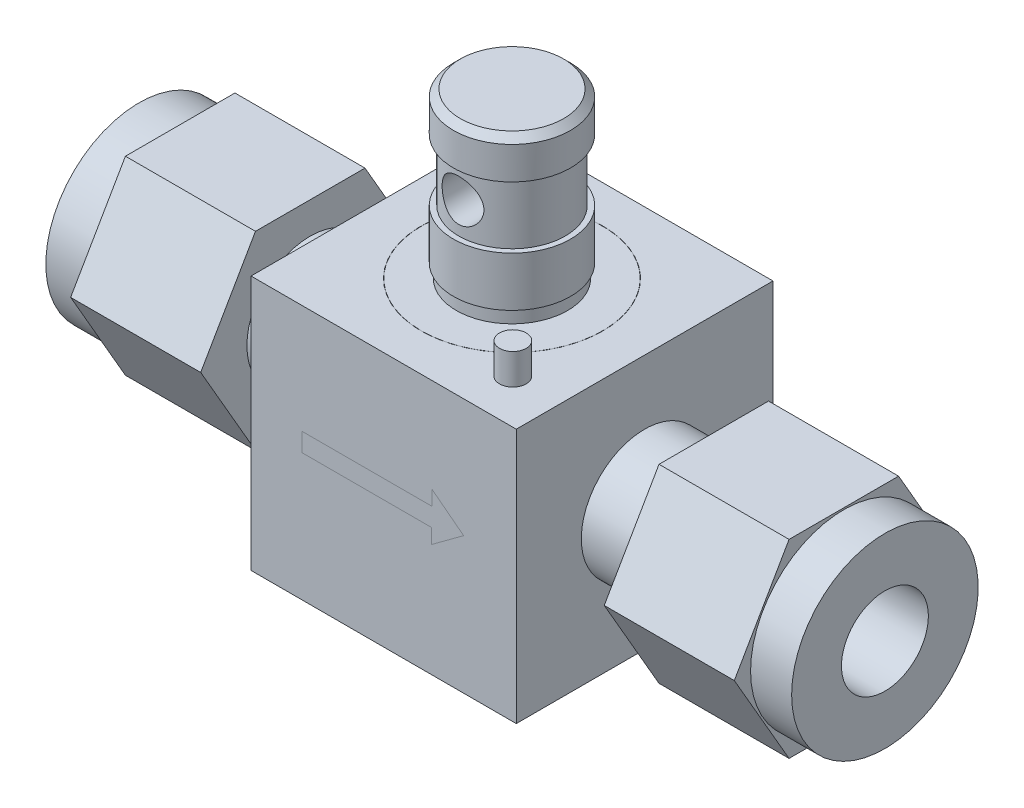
ISO-10303-21;
HEADER;
FILE_DESCRIPTION(('STEP AP214'),'2;1');
FILE_NAME('part.step','',(''),(''),'','','');
FILE_SCHEMA(('AUTOMOTIVE_DESIGN { 1 0 10303 214 1 1 1 1 }'));
ENDSEC;
DATA;
#1=APPLICATION_CONTEXT('core data for automotive mechanical design processes');
#2=APPLICATION_PROTOCOL_DEFINITION('international standard','automotive_design',2000,#1);
#3=PRODUCT_CONTEXT('',#1,'mechanical');
#4=PRODUCT('Part','Part','',(#3));
#5=PRODUCT_RELATED_PRODUCT_CATEGORY('part','',(#4));
#6=PRODUCT_DEFINITION_FORMATION('','',#4);
#7=PRODUCT_DEFINITION_CONTEXT('part definition',#1,'design');
#8=PRODUCT_DEFINITION('design','',#6,#7);
#9=PRODUCT_DEFINITION_SHAPE('','',#8);
#10=(LENGTH_UNIT() NAMED_UNIT(*) SI_UNIT(.MILLI.,.METRE.));
#11=(NAMED_UNIT(*) PLANE_ANGLE_UNIT() SI_UNIT($,.RADIAN.));
#12=(NAMED_UNIT(*) SI_UNIT($,.STERADIAN.) SOLID_ANGLE_UNIT());
#13=UNCERTAINTY_MEASURE_WITH_UNIT(LENGTH_MEASURE(1.E-05),#10,'distance_accuracy_value','');
#14=(GEOMETRIC_REPRESENTATION_CONTEXT(3) GLOBAL_UNCERTAINTY_ASSIGNED_CONTEXT((#13)) GLOBAL_UNIT_ASSIGNED_CONTEXT((#10,
#11,#12)) REPRESENTATION_CONTEXT('',''));
#15=CARTESIAN_POINT('',(0.,0.,0.));
#16=DIRECTION('',(0.,0.,1.));
#17=DIRECTION('',(1.,0.,0.));
#18=AXIS2_PLACEMENT_3D('',#15,#16,#17);
#19=CARTESIAN_POINT('',(0.,9.4615,0.));
#20=DIRECTION('',(0.,-1.,0.));
#21=DIRECTION('',(0.,0.,-1.));
#22=AXIS2_PLACEMENT_3D('',#19,#20,#21);
#23=PLANE('',#22);
#24=CARTESIAN_POINT('',(0.,9.4615,0.));
#25=DIRECTION('',(0.,-1.,0.));
#26=DIRECTION('',(0.,0.,-1.));
#27=AXIS2_PLACEMENT_3D('',#24,#25,#26);
#28=CIRCLE('',#27,4.1275);
#29=CARTESIAN_POINT('',(0.,9.4615,-4.1275));
#30=VERTEX_POINT('',#29);
#31=EDGE_CURVE('E63',#30,#30,#28,.T.);
#32=ORIENTED_EDGE('',*,*,#31,.T.);
#33=EDGE_LOOP('',(#32));
#34=FACE_BOUND('',#33,.T.);
#35=ADVANCED_FACE('F46',(#34),#23,.T.);
#36=CARTESIAN_POINT('',(0.,0.,0.));
#37=DIRECTION('',(0.,-1.,0.));
#38=DIRECTION('',(0.,0.,-1.));
#39=AXIS2_PLACEMENT_3D('',#36,#37,#38);
#40=CYLINDRICAL_SURFACE('',#39,4.1275);
#41=CARTESIAN_POINT('',(0.,10.4775,0.));
#42=DIRECTION('',(0.,-1.,0.));
#43=DIRECTION('',(0.,0.,-1.));
#44=AXIS2_PLACEMENT_3D('',#41,#42,#43);
#45=CIRCLE('',#44,4.1275);
#46=CARTESIAN_POINT('',(0.,10.4775,-4.1275));
#47=VERTEX_POINT('',#46);
#48=EDGE_CURVE('E127',#47,#47,#45,.T.);
#49=ORIENTED_EDGE('',*,*,#48,.T.);
#50=EDGE_LOOP('',(#49));
#51=FACE_BOUND('',#50,.T.);
#52=ORIENTED_EDGE('',*,*,#31,.F.);
#53=EDGE_LOOP('',(#52));
#54=FACE_BOUND('',#53,.T.);
#55=ADVANCED_FACE('F97',(#51,#54),#40,.T.);
#56=CARTESIAN_POINT('',(4.1275,10.4775,0.));
#57=DIRECTION('',(0.,-1.,0.));
#58=DIRECTION('',(0.,0.,-1.));
#59=AXIS2_PLACEMENT_3D('',#56,#57,#58);
#60=PLANE('',#59);
#61=CARTESIAN_POINT('',(0.,10.4775,0.));
#62=DIRECTION('',(0.,-1.,0.));
#63=DIRECTION('',(0.,0.,-1.));
#64=AXIS2_PLACEMENT_3D('',#61,#62,#63);
#65=CIRCLE('',#64,4.3434);
#66=CARTESIAN_POINT('',(0.,10.4775,-4.3434));
#67=VERTEX_POINT('',#66);
#68=EDGE_CURVE('E124',#67,#67,#65,.T.);
#69=ORIENTED_EDGE('',*,*,#68,.T.);
#70=EDGE_LOOP('',(#69));
#71=FACE_BOUND('',#70,.T.);
#72=ORIENTED_EDGE('',*,*,#48,.F.);
#73=EDGE_LOOP('',(#72));
#74=FACE_BOUND('',#73,.T.);
#75=ADVANCED_FACE('F102',(#71,#74),#60,.T.);
#76=CARTESIAN_POINT('',(0.,0.,0.));
#77=DIRECTION('',(0.,-1.,0.));
#78=DIRECTION('',(0.,0.,-1.));
#79=AXIS2_PLACEMENT_3D('',#76,#77,#78);
#80=CYLINDRICAL_SURFACE('',#79,4.3434);
#81=CARTESIAN_POINT('',(0.,14.1605,0.));
#82=DIRECTION('',(0.,-1.,0.));
#83=DIRECTION('',(0.,0.,-1.));
#84=AXIS2_PLACEMENT_3D('',#81,#82,#83);
#85=CIRCLE('',#84,4.3434);
#86=CARTESIAN_POINT('',(0.,14.1605,-4.3434));
#87=VERTEX_POINT('',#86);
#88=EDGE_CURVE('E123',#87,#87,#85,.T.);
#89=ORIENTED_EDGE('',*,*,#88,.T.);
#90=EDGE_LOOP('',(#89));
#91=FACE_BOUND('',#90,.T.);
#92=ORIENTED_EDGE('',*,*,#68,.F.);
#93=EDGE_LOOP('',(#92));
#94=FACE_BOUND('',#93,.T.);
#95=ADVANCED_FACE('F109',(#91,#94),#80,.T.);
#96=CARTESIAN_POINT('',(4.3434,14.1605,0.));
#97=DIRECTION('',(0.,1.,0.));
#98=DIRECTION('',(0.,0.,1.));
#99=AXIS2_PLACEMENT_3D('',#96,#97,#98);
#100=PLANE('',#99);
#101=CARTESIAN_POINT('',(0.,14.1605,0.));
#102=DIRECTION('',(0.,-1.,0.));
#103=DIRECTION('',(0.,0.,-1.));
#104=AXIS2_PLACEMENT_3D('',#101,#102,#103);
#105=CIRCLE('',#104,3.9497);
#106=CARTESIAN_POINT('',(0.,14.1605,-3.9497));
#107=VERTEX_POINT('',#106);
#108=EDGE_CURVE('E120',#107,#107,#105,.T.);
#109=ORIENTED_EDGE('',*,*,#108,.T.);
#110=EDGE_LOOP('',(#109));
#111=FACE_BOUND('',#110,.T.);
#112=ORIENTED_EDGE('',*,*,#88,.F.);
#113=EDGE_LOOP('',(#112));
#114=FACE_BOUND('',#113,.T.);
#115=ADVANCED_FACE('F92',(#111,#114),#100,.T.);
#116=CARTESIAN_POINT('',(0.,0.,0.));
#117=DIRECTION('',(0.,-1.,0.));
#118=DIRECTION('',(0.,0.,-1.));
#119=AXIS2_PLACEMENT_3D('',#116,#117,#118);
#120=CYLINDRICAL_SURFACE('',#119,3.9497);
#121=CARTESIAN_POINT('',(0.,18.0086,-3.9497));
#122=CARTESIAN_POINT('',(0.0836310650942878,18.0086044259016,-3.9497034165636));
#123=CARTESIAN_POINT('',(0.167233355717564,18.0018081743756,-3.94702134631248));
#124=CARTESIAN_POINT('',(0.331924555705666,17.9749251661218,-3.9365921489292));
#125=CARTESIAN_POINT('',(0.413014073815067,17.9548416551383,-3.92884625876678));
#126=CARTESIAN_POINT('',(0.570279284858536,17.9022137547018,-3.90911613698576));
#127=CARTESIAN_POINT('',(0.646464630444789,17.8696947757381,-3.89714055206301));
#128=CARTESIAN_POINT('',(0.792288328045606,17.7932546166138,-3.87013118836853));
#129=CARTESIAN_POINT('',(0.861924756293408,17.7493301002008,-3.85509651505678));
#130=CARTESIAN_POINT('',(0.995865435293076,17.6492288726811,-3.82273807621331));
#131=CARTESIAN_POINT('',(1.0598306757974,17.5926210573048,-3.80534541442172));
#132=CARTESIAN_POINT('',(1.17763877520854,17.4696753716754,-3.77055392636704));
#133=CARTESIAN_POINT('',(1.23147809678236,17.4033341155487,-3.75315510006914));
#134=CARTESIAN_POINT('',(1.32976455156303,17.2593738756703,-3.7194991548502));
#135=CARTESIAN_POINT('',(1.37371539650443,17.181395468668,-3.7033219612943));
#136=CARTESIAN_POINT('',(1.44772619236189,17.0184212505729,-3.67502390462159));
#137=CARTESIAN_POINT('',(1.47779228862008,16.9334285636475,-3.6629012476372));
#138=CARTESIAN_POINT('',(1.52181310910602,16.7627534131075,-3.64482674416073));
#139=CARTESIAN_POINT('',(1.5364189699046,16.677266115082,-3.63862668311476));
#140=CARTESIAN_POINT('',(1.55113948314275,16.5048463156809,-3.63237759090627));
#141=CARTESIAN_POINT('',(1.55126086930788,16.4179145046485,-3.63232570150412));
#142=CARTESIAN_POINT('',(1.537503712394,16.2512329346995,-3.63816639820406));
#143=CARTESIAN_POINT('',(1.52455533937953,16.171389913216,-3.64366402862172));
#144=CARTESIAN_POINT('',(1.48657303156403,16.0151170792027,-3.6593234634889));
#145=CARTESIAN_POINT('',(1.46153709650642,15.9386878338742,-3.6694860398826));
#146=CARTESIAN_POINT('',(1.39962055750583,15.7896109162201,-3.69354984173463));
#147=CARTESIAN_POINT('',(1.36251339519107,15.7170692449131,-3.70752167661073));
#148=CARTESIAN_POINT('',(1.27766637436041,15.5789830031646,-3.7376090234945));
#149=CARTESIAN_POINT('',(1.22992261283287,15.5134410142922,-3.75372532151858));
#150=CARTESIAN_POINT('',(1.1209972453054,15.3861046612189,-3.78774083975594));
#151=CARTESIAN_POINT('',(1.05908207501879,15.3249478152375,-3.80568368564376));
#152=CARTESIAN_POINT('',(0.925678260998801,15.2136858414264,-3.84031178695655));
#153=CARTESIAN_POINT('',(0.854187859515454,15.1635827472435,-3.85699681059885));
#154=CARTESIAN_POINT('',(0.701912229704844,15.0750567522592,-3.88761903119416));
#155=CARTESIAN_POINT('',(0.620980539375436,15.0368650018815,-3.9015002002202));
#156=CARTESIAN_POINT('',(0.453159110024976,14.9748555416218,-3.9245297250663));
#157=CARTESIAN_POINT('',(0.366272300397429,14.951030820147,-3.93368038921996));
#158=CARTESIAN_POINT('',(0.194357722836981,14.9197009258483,-3.94580181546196));
#159=CARTESIAN_POINT('',(0.109508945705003,14.9113384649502,-3.94909679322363));
#160=CARTESIAN_POINT('',(-0.0604347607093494,14.9086501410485,-3.9501507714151));
#161=CARTESIAN_POINT('',(-0.145529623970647,14.9143208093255,-3.94791113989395));
#162=CARTESIAN_POINT('',(-0.309721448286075,14.9389004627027,-3.93836040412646));
#163=CARTESIAN_POINT('',(-0.388919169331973,14.9572317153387,-3.9312707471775));
#164=CARTESIAN_POINT('',(-0.543047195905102,15.005834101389,-3.91296019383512));
#165=CARTESIAN_POINT('',(-0.617976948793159,15.0361067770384,-3.90173876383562));
#166=CARTESIAN_POINT('',(-0.763991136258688,15.1087158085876,-3.87583731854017));
#167=CARTESIAN_POINT('',(-0.834890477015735,15.151389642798,-3.86106288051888));
#168=CARTESIAN_POINT('',(-0.968767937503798,15.2472131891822,-3.82966768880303));
#169=CARTESIAN_POINT('',(-1.03174293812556,15.3003670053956,-3.81304621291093));
#170=CARTESIAN_POINT('',(-1.15217708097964,15.4196058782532,-3.77846410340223));
#171=CARTESIAN_POINT('',(-1.20903170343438,15.486297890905,-3.76048547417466));
#172=CARTESIAN_POINT('',(-1.31088175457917,15.6286061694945,-3.7262064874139));
#173=CARTESIAN_POINT('',(-1.35587553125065,15.7042236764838,-3.70990636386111));
#174=CARTESIAN_POINT('',(-1.43293009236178,15.863204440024,-3.68083675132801));
#175=CARTESIAN_POINT('',(-1.46488702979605,15.9466236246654,-3.66809585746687));
#176=CARTESIAN_POINT('',(-1.51406426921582,16.1183066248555,-3.64807592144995));
#177=CARTESIAN_POINT('',(-1.53129488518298,16.2065670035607,-3.64079305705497));
#178=CARTESIAN_POINT('',(-1.54956455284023,16.3788089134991,-3.63305230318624));
#179=CARTESIAN_POINT('',(-1.55164694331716,16.4626607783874,-3.63215472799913));
#180=CARTESIAN_POINT('',(-1.54227994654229,16.629456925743,-3.63614196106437));
#181=CARTESIAN_POINT('',(-1.53083211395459,16.7124013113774,-3.64102610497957));
#182=CARTESIAN_POINT('',(-1.49556969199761,16.8719283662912,-3.65564530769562));
#183=CARTESIAN_POINT('',(-1.47222269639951,16.9486327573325,-3.66519642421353));
#184=CARTESIAN_POINT('',(-1.41425407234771,17.0970707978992,-3.68795067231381));
#185=CARTESIAN_POINT('',(-1.37962947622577,17.1688031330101,-3.7011547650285));
#186=CARTESIAN_POINT('',(-1.29785240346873,17.309619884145,-3.7306428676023));
#187=CARTESIAN_POINT('',(-1.25010861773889,17.3783331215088,-3.74705763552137));
#188=CARTESIAN_POINT('',(-1.14432834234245,17.5071035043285,-3.78070378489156));
#189=CARTESIAN_POINT('',(-1.08628843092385,17.5671577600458,-3.79793543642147));
#190=CARTESIAN_POINT('',(-0.95731091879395,17.6806818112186,-3.83254532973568));
#191=CARTESIAN_POINT('',(-0.885800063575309,17.7335205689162,-3.84986756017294));
#192=CARTESIAN_POINT('',(-0.734300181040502,17.826438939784,-3.88161325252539));
#193=CARTESIAN_POINT('',(-0.654309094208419,17.8665154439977,-3.89603600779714));
#194=CARTESIAN_POINT('',(-0.481029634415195,17.9352196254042,-3.92135306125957));
#195=CARTESIAN_POINT('',(-0.387188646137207,17.9626160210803,-3.93185352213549));
#196=CARTESIAN_POINT('',(-0.195550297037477,17.9992978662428,-3.94602282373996));
#197=CARTESIAN_POINT('',(-0.0977554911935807,18.0085948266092,-3.94969600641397));
#198=CARTESIAN_POINT('',(0.,18.0086,-3.9497));
#199=B_SPLINE_CURVE_WITH_KNOTS('',3,(#121,#122,#123,#124,#125,#126,#127,#128,#129,#130,#131,
#132,#133,#134,#135,#136,#137,#138,#139,#140,#141,#142,#143,#144,#145,#146,#147,#148,#149,#150,
#151,#152,#153,#154,#155,#156,#157,#158,#159,#160,#161,#162,#163,#164,#165,#166,#167,#168,#169,
#170,#171,#172,#173,#174,#175,#176,#177,#178,#179,#180,#181,#182,#183,#184,#185,#186,#187,#188,
#189,#190,#191,#192,#193,#194,#195,#196,#197,#198),.UNSPECIFIED.,.T.,.F.,(4,2,2,2,2,2,2,2,2,2,2,
2,2,2,2,2,2,2,2,2,2,2,2,2,2,2,2,2,2,2,2,2,2,2,2,2,2,2,4),(0.,0.250532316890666,
0.501003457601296,0.750965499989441,1.00100074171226,1.26136273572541,1.52181551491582,
1.79333516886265,2.0647345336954,2.32418337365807,2.58351159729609,2.82559984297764,
3.06772816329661,3.31469189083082,3.5617463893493,3.82710653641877,4.09251546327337,
4.3627936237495,4.63293977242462,4.88759856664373,5.1421944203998,5.38587975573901,
5.62959657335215,5.88069186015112,6.1318856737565,6.39903646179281,6.66622443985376,
6.93550103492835,7.20458887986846,7.45495067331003,7.70528370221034,7.94646145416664,
8.18770272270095,8.44240697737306,8.69719603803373,8.96763553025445,9.23814085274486,
9.53117192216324,9.82401656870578),.UNSPECIFIED.);
#200=CARTESIAN_POINT('',(0.,18.0086,-3.9497));
#201=VERTEX_POINT('',#200);
#202=EDGE_CURVE('E50',#201,#201,#199,.T.);
#203=ORIENTED_EDGE('',*,*,#202,.F.);
#204=EDGE_LOOP('',(#203));
#205=FACE_BOUND('',#204,.T.);
#206=CARTESIAN_POINT('',(1.5494,16.4592,3.63311020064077));
#207=CARTESIAN_POINT('',(1.54939122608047,16.5423473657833,3.63311815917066));
#208=CARTESIAN_POINT('',(1.54266704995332,16.6256204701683,3.63600480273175));
#209=CARTESIAN_POINT('',(1.5160165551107,16.7897867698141,3.64719331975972));
#210=CARTESIAN_POINT('',(1.49605572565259,16.8706731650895,3.65550934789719));
#211=CARTESIAN_POINT('',(1.44380304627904,17.0274165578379,3.6764583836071));
#212=CARTESIAN_POINT('',(1.41155654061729,17.1032908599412,3.68907549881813));
#213=CARTESIAN_POINT('',(1.33577973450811,17.2485333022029,3.71718291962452));
#214=CARTESIAN_POINT('',(1.29225221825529,17.3179030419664,3.7326725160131));
#215=CARTESIAN_POINT('',(1.19258816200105,17.452022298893,3.76573362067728));
#216=CARTESIAN_POINT('',(1.13593136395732,17.5163693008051,3.78337041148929));
#217=CARTESIAN_POINT('',(1.01271303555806,17.6349410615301,3.81819834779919));
#218=CARTESIAN_POINT('',(0.946148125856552,17.6891623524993,3.83538933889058));
#219=CARTESIAN_POINT('',(0.801918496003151,17.7879159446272,3.86816764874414));
#220=CARTESIAN_POINT('',(0.723929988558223,17.8320060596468,3.88367010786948));
#221=CARTESIAN_POINT('',(0.560926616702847,17.9062707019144,3.91053696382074));
#222=CARTESIAN_POINT('',(0.475914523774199,17.9364506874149,3.92190298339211));
#223=CARTESIAN_POINT('',(0.305494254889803,17.9806122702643,3.93875459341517));
#224=CARTESIAN_POINT('',(0.220290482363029,17.9952853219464,3.94449030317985));
#225=CARTESIAN_POINT('',(0.0484499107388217,18.0102395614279,3.95033705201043));
#226=CARTESIAN_POINT('',(-0.0381863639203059,18.0105259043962,3.9504501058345));
#227=CARTESIAN_POINT('',(-0.205447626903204,17.997085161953,3.94519320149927));
#228=CARTESIAN_POINT('',(-0.286144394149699,17.9841147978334,3.94011932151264));
#229=CARTESIAN_POINT('',(-0.444109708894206,17.945811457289,3.92545435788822));
#230=CARTESIAN_POINT('',(-0.521378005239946,17.9204775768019,3.91586294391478));
#231=CARTESIAN_POINT('',(-0.6716700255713,17.8578523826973,3.89292429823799));
#232=CARTESIAN_POINT('',(-0.744613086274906,17.8203880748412,3.87952309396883));
#233=CARTESIAN_POINT('',(-0.883363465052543,17.7347246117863,3.85030308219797));
#234=CARTESIAN_POINT('',(-0.94916836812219,17.6865218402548,3.83448346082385));
#235=CARTESIAN_POINT('',(-1.07620428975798,17.5771827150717,3.80085559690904));
#236=CARTESIAN_POINT('',(-1.13688039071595,17.5154199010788,3.78298486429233));
#237=CARTESIAN_POINT('',(-1.24723551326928,17.3825135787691,3.74805169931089));
#238=CARTESIAN_POINT('',(-1.29691120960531,17.3113672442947,3.73098951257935));
#239=CARTESIAN_POINT('',(-1.38505736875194,17.1593249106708,3.69918994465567));
#240=CARTESIAN_POINT('',(-1.42319920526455,17.0782218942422,3.68452540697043));
#241=CARTESIAN_POINT('',(-1.48506639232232,16.9100157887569,3.66003118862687));
#242=CARTESIAN_POINT('',(-1.50880068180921,16.8229164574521,3.65019851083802));
#243=CARTESIAN_POINT('',(-1.53985677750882,16.6507110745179,3.63720218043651));
#244=CARTESIAN_POINT('',(-1.54806823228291,16.5657930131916,3.63367769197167));
#245=CARTESIAN_POINT('',(-1.55043159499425,16.3957377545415,3.63267071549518));
#246=CARTESIAN_POINT('',(-1.54458751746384,16.3106006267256,3.63518650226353));
#247=CARTESIAN_POINT('',(-1.51981474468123,16.147342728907,3.64560746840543));
#248=CARTESIAN_POINT('',(-1.50160813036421,16.069091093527,3.65321491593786));
#249=CARTESIAN_POINT('',(-1.45355491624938,15.9168000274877,3.67259778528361));
#250=CARTESIAN_POINT('',(-1.42370579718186,15.8427615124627,3.68437410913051));
#251=CARTESIAN_POINT('',(-1.35189021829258,15.6977276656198,3.71134011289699));
#252=CARTESIAN_POINT('',(-1.30949024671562,15.6269693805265,3.72664661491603));
#253=CARTESIAN_POINT('',(-1.21422527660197,15.4932589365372,3.758764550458));
#254=CARTESIAN_POINT('',(-1.16135614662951,15.4303098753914,3.77557657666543));
#255=CARTESIAN_POINT('',(-1.04224850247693,15.3093930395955,3.81024333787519));
#256=CARTESIAN_POINT('',(-0.975330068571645,15.2520896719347,3.82808798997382));
#257=CARTESIAN_POINT('',(-0.832396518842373,15.1494301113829,3.86168736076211));
#258=CARTESIAN_POINT('',(-0.756381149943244,15.104074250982,3.87744202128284));
#259=CARTESIAN_POINT('',(-0.597251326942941,15.0268106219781,3.90511536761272));
#260=CARTESIAN_POINT('',(-0.514146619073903,14.9948847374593,3.91703921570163));
#261=CARTESIAN_POINT('',(-0.343165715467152,14.9456675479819,3.93570144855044));
#262=CARTESIAN_POINT('',(-0.255292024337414,14.9283686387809,3.94244252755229));
#263=CARTESIAN_POINT('',(-0.0832450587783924,14.9097740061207,3.94970189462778));
#264=CARTESIAN_POINT('',(0.00081192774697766,14.9075375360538,3.95058593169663));
#265=CARTESIAN_POINT('',(0.168058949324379,14.916667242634,3.94700882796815));
#266=CARTESIAN_POINT('',(0.251249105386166,14.9280314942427,3.94254844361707));
#267=CARTESIAN_POINT('',(0.411963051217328,14.9633705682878,3.9289618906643));
#268=CARTESIAN_POINT('',(0.489580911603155,14.9869745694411,3.91997313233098));
#269=CARTESIAN_POINT('',(0.639747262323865,15.0457401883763,3.89828359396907));
#270=CARTESIAN_POINT('',(0.712294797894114,15.0809039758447,3.88558211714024));
#271=CARTESIAN_POINT('',(0.853734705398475,15.1635241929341,3.85703253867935));
#272=CARTESIAN_POINT('',(0.922329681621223,15.2114498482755,3.84107136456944));
#273=CARTESIAN_POINT('',(1.05078621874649,15.3175202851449,3.80793733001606));
#274=CARTESIAN_POINT('',(1.11064434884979,15.3756690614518,3.79076399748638));
#275=CARTESIAN_POINT('',(1.22357760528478,15.5045961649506,3.75588691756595));
#276=CARTESIAN_POINT('',(1.27604380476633,15.5759173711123,3.73821169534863));
#277=CARTESIAN_POINT('',(1.36829728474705,15.7269264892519,3.70544201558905));
#278=CARTESIAN_POINT('',(1.40808286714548,15.806615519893,3.69034790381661));
#279=CARTESIAN_POINT('',(1.47071669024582,15.9649915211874,3.66580887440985));
#280=CARTESIAN_POINT('',(1.49474321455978,16.0431549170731,3.65598495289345));
#281=CARTESIAN_POINT('',(1.53017228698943,16.202602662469,3.64130265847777));
#282=CARTESIAN_POINT('',(1.5416104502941,16.2838775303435,3.63643027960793));
#283=CARTESIAN_POINT('',(1.54845726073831,16.3966929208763,3.63351116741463));
#284=CARTESIAN_POINT('',(1.54940329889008,16.4279375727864,3.63310720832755));
#285=CARTESIAN_POINT('',(1.5494,16.4592,3.63311020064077));
#286=B_SPLINE_CURVE_WITH_KNOTS('',3,(#206,#207,#208,#209,#210,#211,#212,#213,#214,#215,#216,
#217,#218,#219,#220,#221,#222,#223,#224,#225,#226,#227,#228,#229,#230,#231,#232,#233,#234,#235,
#236,#237,#238,#239,#240,#241,#242,#243,#244,#245,#246,#247,#248,#249,#250,#251,#252,#253,#254,
#255,#256,#257,#258,#259,#260,#261,#262,#263,#264,#265,#266,#267,#268,#269,#270,#271,#272,#273,
#274,#275,#276,#277,#278,#279,#280,#281,#282,#283,#284,#285),.UNSPECIFIED.,.T.,.F.,(4,2,2,2,2,2,
2,2,2,2,2,2,2,2,2,2,2,2,2,2,2,2,2,2,2,2,2,2,2,2,2,2,2,2,2,2,2,2,2,4),(0.,0.249347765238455,
0.499348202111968,0.748434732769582,0.997459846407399,1.25889479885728,1.52041912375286,
1.7918000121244,2.06307432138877,2.32166371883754,2.58016045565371,2.82468300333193,
3.06922343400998,3.31741740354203,3.56569508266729,3.82972176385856,4.0938281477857,
4.36487228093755,4.63574807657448,4.89056393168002,5.14530701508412,5.38632238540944,
5.62738993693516,5.87801546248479,6.12874009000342,6.39714720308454,6.66556178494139,
6.93361312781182,7.20152503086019,7.4525351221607,7.70350968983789,7.9472900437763,
8.19111617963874,8.44557608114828,8.70013563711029,8.96972088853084,9.23934222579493,
9.48534804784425,9.7306560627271,9.82440787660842),.UNSPECIFIED.);
#287=CARTESIAN_POINT('',(1.5494,16.4592,3.63311020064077));
#288=VERTEX_POINT('',#287);
#289=EDGE_CURVE('E66',#288,#288,#286,.T.);
#290=ORIENTED_EDGE('',*,*,#289,.F.);
#291=EDGE_LOOP('',(#290));
#292=FACE_BOUND('',#291,.T.);
#293=CARTESIAN_POINT('',(0.,18.7325,0.));
#294=DIRECTION('',(0.,-1.,0.));
#295=DIRECTION('',(0.,0.,-1.));
#296=AXIS2_PLACEMENT_3D('',#293,#294,#295);
#297=CIRCLE('',#296,3.9497);
#298=CARTESIAN_POINT('',(0.,18.7325,-3.9497));
#299=VERTEX_POINT('',#298);
#300=EDGE_CURVE('E129',#299,#299,#297,.T.);
#301=ORIENTED_EDGE('',*,*,#300,.T.);
#302=EDGE_LOOP('',(#301));
#303=FACE_BOUND('',#302,.T.);
#304=ORIENTED_EDGE('',*,*,#108,.F.);
#305=EDGE_LOOP('',(#304));
#306=FACE_BOUND('',#305,.T.);
#307=ADVANCED_FACE('F70',(#205,#292,#303,#306),#120,.T.);
#308=CARTESIAN_POINT('',(3.9497,18.7325,0.));
#309=DIRECTION('',(0.,-1.,0.));
#310=DIRECTION('',(0.,0.,-1.));
#311=AXIS2_PLACEMENT_3D('',#308,#309,#310);
#312=PLANE('',#311);
#313=CARTESIAN_POINT('',(0.,18.7325,0.));
#314=DIRECTION('',(0.,-1.,0.));
#315=DIRECTION('',(0.,0.,-1.));
#316=AXIS2_PLACEMENT_3D('',#313,#314,#315);
#317=CIRCLE('',#316,4.3434);
#318=CARTESIAN_POINT('',(0.,18.7325,-4.3434));
#319=VERTEX_POINT('',#318);
#320=EDGE_CURVE('E140',#319,#319,#317,.T.);
#321=ORIENTED_EDGE('',*,*,#320,.T.);
#322=EDGE_LOOP('',(#321));
#323=FACE_BOUND('',#322,.T.);
#324=ORIENTED_EDGE('',*,*,#300,.F.);
#325=EDGE_LOOP('',(#324));
#326=FACE_BOUND('',#325,.T.);
#327=ADVANCED_FACE('F85',(#323,#326),#312,.T.);
#328=CARTESIAN_POINT('',(0.,0.,0.));
#329=DIRECTION('',(0.,-1.,0.));
#330=DIRECTION('',(0.,0.,-1.));
#331=AXIS2_PLACEMENT_3D('',#328,#329,#330);
#332=CYLINDRICAL_SURFACE('',#331,4.3434);
#333=CARTESIAN_POINT('',(0.,21.1455,0.));
#334=DIRECTION('',(0.,1.,0.));
#335=DIRECTION('',(0.,0.,1.));
#336=AXIS2_PLACEMENT_3D('',#333,#334,#335);
#337=CIRCLE('',#336,4.3434);
#338=CARTESIAN_POINT('',(0.,21.1455,4.3434));
#339=VERTEX_POINT('',#338);
#340=EDGE_CURVE('E58',#339,#339,#337,.F.);
#341=ORIENTED_EDGE('',*,*,#340,.T.);
#342=EDGE_LOOP('',(#341));
#343=FACE_BOUND('',#342,.T.);
#344=ORIENTED_EDGE('',*,*,#320,.F.);
#345=EDGE_LOOP('',(#344));
#346=FACE_BOUND('',#345,.T.);
#347=ADVANCED_FACE('F83',(#343,#346),#332,.T.);
#348=CARTESIAN_POINT('',(4.3434,21.6535,0.));
#349=DIRECTION('',(0.,1.,0.));
#350=DIRECTION('',(0.,0.,1.));
#351=AXIS2_PLACEMENT_3D('',#348,#349,#350);
#352=PLANE('',#351);
#353=CARTESIAN_POINT('',(0.,21.6535,0.));
#354=DIRECTION('',(0.,1.,0.));
#355=DIRECTION('',(0.,0.,1.));
#356=AXIS2_PLACEMENT_3D('',#353,#354,#355);
#357=CIRCLE('',#356,3.8354);
#358=CARTESIAN_POINT('',(0.,21.6535,3.8354));
#359=VERTEX_POINT('',#358);
#360=EDGE_CURVE('E11',#359,#359,#357,.T.);
#361=ORIENTED_EDGE('',*,*,#360,.T.);
#362=EDGE_LOOP('',(#361));
#363=FACE_BOUND('',#362,.T.);
#364=ADVANCED_FACE('F79',(#363),#352,.T.);
#365=CARTESIAN_POINT('',(0.,21.1455,0.));
#366=DIRECTION('',(0.,-1.,0.));
#367=DIRECTION('',(0.,0.,-1.));
#368=AXIS2_PLACEMENT_3D('',#365,#366,#367);
#369=CONICAL_SURFACE('',#368,4.3434,0.785398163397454);
#370=ORIENTED_EDGE('',*,*,#360,.F.);
#371=EDGE_LOOP('',(#370));
#372=FACE_BOUND('',#371,.T.);
#373=ORIENTED_EDGE('',*,*,#340,.F.);
#374=EDGE_LOOP('',(#373));
#375=FACE_BOUND('',#374,.T.);
#376=ADVANCED_FACE('F48',(#372,#375),#369,.T.);
#377=CARTESIAN_POINT('',(0.,16.4592,-9.525));
#378=DIRECTION('',(0.,0.,1.));
#379=DIRECTION('',(1.,0.,0.));
#380=AXIS2_PLACEMENT_3D('',#377,#378,#379);
#381=CYLINDRICAL_SURFACE('',#380,1.5494);
#382=ORIENTED_EDGE('',*,*,#202,.T.);
#383=EDGE_LOOP('',(#382));
#384=FACE_BOUND('',#383,.T.);
#385=ORIENTED_EDGE('',*,*,#289,.T.);
#386=EDGE_LOOP('',(#385));
#387=FACE_BOUND('',#386,.T.);
#388=ADVANCED_FACE('F74',(#384,#387),#381,.F.);
#389=CLOSED_SHELL('',(#35,#55,#75,#95,#115,#307,#327,#347,#364,#376,#388));
#390=MANIFOLD_SOLID_BREP('B2',#389);
#391=CARTESIAN_POINT('',(0.,-11.6967,0.));
#392=DIRECTION('',(0.,1.,0.));
#393=DIRECTION('',(-1.,0.,0.));
#394=AXIS2_PLACEMENT_3D('',#391,#392,#393);
#395=CYLINDRICAL_SURFACE('',#394,6.3627);
#396=CARTESIAN_POINT('',(0.,-11.6967,0.));
#397=DIRECTION('',(0.,-1.,0.));
#398=DIRECTION('',(1.,0.,0.));
#399=AXIS2_PLACEMENT_3D('',#396,#397,#398);
#400=CIRCLE('',#399,6.3627);
#401=CARTESIAN_POINT('',(6.3627,-11.6967,0.));
#402=VERTEX_POINT('',#401);
#403=EDGE_CURVE('E45',#402,#402,#400,.T.);
#404=ORIENTED_EDGE('',*,*,#403,.F.);
#405=EDGE_LOOP('',(#404));
#406=FACE_BOUND('',#405,.T.);
#407=CARTESIAN_POINT('',(0.,-9.4615,0.));
#408=DIRECTION('',(0.,-1.,0.));
#409=DIRECTION('',(1.,0.,0.));
#410=AXIS2_PLACEMENT_3D('',#407,#408,#409);
#411=CIRCLE('',#410,6.3627);
#412=CARTESIAN_POINT('',(6.3627,-9.4615,0.));
#413=VERTEX_POINT('',#412);
#414=EDGE_CURVE('E233',#413,#413,#411,.T.);
#415=ORIENTED_EDGE('',*,*,#414,.T.);
#416=EDGE_LOOP('',(#415));
#417=FACE_BOUND('',#416,.T.);
#418=ADVANCED_FACE('F230',(#406,#417),#395,.T.);
#419=CARTESIAN_POINT('',(0.,-11.6967,0.));
#420=DIRECTION('',(0.,-1.,0.));
#421=DIRECTION('',(1.,0.,0.));
#422=AXIS2_PLACEMENT_3D('',#419,#420,#421);
#423=PLANE('',#422);
#424=ORIENTED_EDGE('',*,*,#403,.T.);
#425=EDGE_LOOP('',(#424));
#426=FACE_BOUND('',#425,.T.);
#427=ADVANCED_FACE('F245',(#426),#423,.T.);
#428=CARTESIAN_POINT('',(0.,-9.4615,0.));
#429=DIRECTION('',(0.,-1.,0.));
#430=DIRECTION('',(1.,0.,0.));
#431=AXIS2_PLACEMENT_3D('',#428,#429,#430);
#432=PLANE('',#431);
#433=ORIENTED_EDGE('',*,*,#414,.F.);
#434=EDGE_LOOP('',(#433));
#435=FACE_BOUND('',#434,.T.);
#436=ADVANCED_FACE('F243',(#435),#432,.F.);
#437=CLOSED_SHELL('',(#418,#427,#436));
#438=MANIFOLD_SOLID_BREP('B6',#437);
#439=CARTESIAN_POINT('',(0.,-28.4996429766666,0.));
#440=DIRECTION('',(0.,1.,0.));
#441=DIRECTION('',(0.,0.,1.));
#442=AXIS2_PLACEMENT_3D('',#439,#440,#441);
#443=CYLINDRICAL_SURFACE('',#442,6.731);
#444=CARTESIAN_POINT('',(-6.25885842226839,0.,-2.4765));
#445=CARTESIAN_POINT('',(-6.25885465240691,0.133948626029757,-2.47650413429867));
#446=CARTESIAN_POINT('',(-6.26320521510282,0.267869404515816,-2.46559624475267));
#447=CARTESIAN_POINT('',(-6.28002096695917,0.531685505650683,-2.42244231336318));
#448=CARTESIAN_POINT('',(-6.29248616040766,0.661580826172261,-2.39019626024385));
#449=CARTESIAN_POINT('',(-6.32393211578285,0.913466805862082,-2.30569918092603));
#450=CARTESIAN_POINT('',(-6.34289777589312,1.03547501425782,-2.2534944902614));
#451=CARTESIAN_POINT('',(-6.38518381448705,1.26904792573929,-2.1307252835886));
#452=CARTESIAN_POINT('',(-6.40850544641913,1.38060960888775,-2.06015548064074));
#453=CARTESIAN_POINT('',(-6.45812514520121,1.59545639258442,-1.89904553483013));
#454=CARTESIAN_POINT('',(-6.48450852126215,1.69817102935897,-1.80777073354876));
#455=CARTESIAN_POINT('',(-6.53656569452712,1.88723532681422,-1.60940211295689));
#456=CARTESIAN_POINT('',(-6.56223934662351,1.9735816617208,-1.50230508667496));
#457=CARTESIAN_POINT('',(-6.61099368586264,2.13017759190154,-1.27103015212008));
#458=CARTESIAN_POINT('',(-6.63396263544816,2.19981106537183,-1.14640941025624));
#459=CARTESIAN_POINT('',(-6.67369778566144,2.31689026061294,-0.886228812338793));
#460=CARTESIAN_POINT('',(-6.690466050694,2.36434336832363,-0.750672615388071));
#461=CARTESIAN_POINT('',(-6.71530516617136,2.43372589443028,-0.47846370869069));
#462=CARTESIAN_POINT('',(-6.72370934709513,2.4566365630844,-0.342092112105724));
#463=CARTESIAN_POINT('',(-6.73206731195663,2.47942365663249,-0.0671981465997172));
#464=CARTESIAN_POINT('',(-6.73202374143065,2.47930729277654,0.0713235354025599));
#465=CARTESIAN_POINT('',(-6.72370561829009,2.4566241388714,0.339567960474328));
#466=CARTESIAN_POINT('',(-6.71582338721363,2.43512742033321,0.46939544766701));
#467=CARTESIAN_POINT('',(-6.69322425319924,2.37208836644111,0.723452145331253));
#468=CARTESIAN_POINT('',(-6.67850686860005,2.33054461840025,0.847680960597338));
#469=CARTESIAN_POINT('',(-6.64343815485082,2.22807188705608,1.08912781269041));
#470=CARTESIAN_POINT('',(-6.62300897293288,2.16687315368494,1.20621958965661));
#471=CARTESIAN_POINT('',(-6.57859460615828,2.02706318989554,1.42875801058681));
#472=CARTESIAN_POINT('',(-6.55460829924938,1.94844646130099,1.53420096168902));
#473=CARTESIAN_POINT('',(-6.50396195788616,1.77083343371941,1.73676534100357));
#474=CARTESIAN_POINT('',(-6.47722742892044,1.67093640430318,1.83307956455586));
#475=CARTESIAN_POINT('',(-6.42519230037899,1.45623481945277,2.00788504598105));
#476=CARTESIAN_POINT('',(-6.39989203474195,1.34142681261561,2.08637216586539));
#477=CARTESIAN_POINT('',(-6.35313098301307,1.09709032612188,2.22475888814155));
#478=CARTESIAN_POINT('',(-6.33176034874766,0.967306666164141,2.28424084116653));
#479=CARTESIAN_POINT('',(-6.29631901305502,0.698572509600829,2.38020506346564));
#480=CARTESIAN_POINT('',(-6.2822444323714,0.559626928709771,2.41669955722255));
#481=CARTESIAN_POINT('',(-6.26389716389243,0.284464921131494,2.4638512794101));
#482=CARTESIAN_POINT('',(-6.25914061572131,0.148499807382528,2.47578566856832));
#483=CARTESIAN_POINT('',(-6.25860110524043,-0.123543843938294,2.47715146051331));
#484=CARTESIAN_POINT('',(-6.26281601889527,-0.259622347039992,2.46658818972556));
#485=CARTESIAN_POINT('',(-6.2792546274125,-0.521616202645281,2.42441489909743));
#486=CARTESIAN_POINT('',(-6.29110927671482,-0.647713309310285,2.39377367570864));
#487=CARTESIAN_POINT('',(-6.32105950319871,-0.892924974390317,2.31352307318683));
#488=CARTESIAN_POINT('',(-6.33915632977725,-1.01203812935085,2.2639098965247));
#489=CARTESIAN_POINT('',(-6.38036652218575,-1.24473941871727,2.1450793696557));
#490=CARTESIAN_POINT('',(-6.40363907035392,-1.35796647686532,2.07521175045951));
#491=CARTESIAN_POINT('',(-6.45230390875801,-1.57154455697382,1.9185551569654));
#492=CARTESIAN_POINT('',(-6.47769694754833,-1.67189099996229,1.83176019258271));
#493=CARTESIAN_POINT('',(-6.52960184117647,-1.86316451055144,1.63748395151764));
#494=CARTESIAN_POINT('',(-6.5560882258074,-1.95315205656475,1.52906773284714));
#495=CARTESIAN_POINT('',(-6.60571293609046,-2.11376014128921,1.29802161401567));
#496=CARTESIAN_POINT('',(-6.62885127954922,-2.18438078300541,1.17539178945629));
#497=CARTESIAN_POINT('',(-6.66913671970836,-2.30374241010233,0.919592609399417));
#498=CARTESIAN_POINT('',(-6.68630846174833,-2.35257364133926,0.786469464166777));
#499=CARTESIAN_POINT('',(-6.71281447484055,-2.4268887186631,0.513126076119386));
#500=CARTESIAN_POINT('',(-6.7221522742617,-2.45238307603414,0.372909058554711));
#501=CARTESIAN_POINT('',(-6.73161581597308,-2.47819925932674,0.0978668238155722));
#502=CARTESIAN_POINT('',(-6.73223082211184,-2.4798580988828,-0.0368172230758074));
#503=CARTESIAN_POINT('',(-6.72544258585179,-2.46137034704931,-0.304460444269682));
#504=CARTESIAN_POINT('',(-6.71804025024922,-2.44122622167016,-0.437419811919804));
#505=CARTESIAN_POINT('',(-6.69626522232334,-2.3806362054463,-0.694772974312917));
#506=CARTESIAN_POINT('',(-6.682055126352,-2.34066315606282,-0.819292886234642));
#507=CARTESIAN_POINT('',(-6.64814245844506,-2.24201429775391,-1.0598761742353));
#508=CARTESIAN_POINT('',(-6.62843884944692,-2.18333495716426,-1.17593794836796));
#509=CARTESIAN_POINT('',(-6.58450926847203,-2.04617675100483,-1.4015547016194));
#510=CARTESIAN_POINT('',(-6.5601301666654,-1.96698043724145,-1.51064318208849));
#511=CARTESIAN_POINT('',(-6.50985611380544,-1.79218255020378,-1.71439986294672));
#512=CARTESIAN_POINT('',(-6.48396063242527,-1.69657521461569,-1.80906297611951));
#513=CARTESIAN_POINT('',(-6.4319841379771,-1.48594225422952,-1.98617566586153));
#514=CARTESIAN_POINT('',(-6.40595938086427,-1.37018150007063,-2.06777076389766));
#515=CARTESIAN_POINT('',(-6.3581697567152,-1.12576674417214,-2.21036567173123));
#516=CARTESIAN_POINT('',(-6.33640503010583,-0.997112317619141,-2.27136480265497));
#517=CARTESIAN_POINT('',(-6.29943159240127,-0.726588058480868,-2.37202627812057));
#518=CARTESIAN_POINT('',(-6.28442212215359,-0.58445013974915,-2.41104779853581));
#519=CARTESIAN_POINT('',(-6.26414049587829,-0.294861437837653,-2.4632747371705));
#520=CARTESIAN_POINT('',(-6.25886257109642,-0.147413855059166,-2.47649545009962));
#521=CARTESIAN_POINT('',(-6.25885842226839,0.,-2.4765));
#522=B_SPLINE_CURVE_WITH_KNOTS('',3,(#444,#445,#446,#447,#448,#449,#450,#451,#452,#453,#454,
#455,#456,#457,#458,#459,#460,#461,#462,#463,#464,#465,#466,#467,#468,#469,#470,#471,#472,#473,
#474,#475,#476,#477,#478,#479,#480,#481,#482,#483,#484,#485,#486,#487,#488,#489,#490,#491,#492,
#493,#494,#495,#496,#497,#498,#499,#500,#501,#502,#503,#504,#505,#506,#507,#508,#509,#510,#511,
#512,#513,#514,#515,#516,#517,#518,#519,#520,#521),.UNSPECIFIED.,.T.,.F.,(4,2,2,2,2,2,2,2,2,2,2,
2,2,2,2,2,2,2,2,2,2,2,2,2,2,2,2,2,2,2,2,2,2,2,2,2,2,2,4),(0.,0.401297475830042,
0.802595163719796,1.20296681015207,1.60345384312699,2.02134713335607,2.43932524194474,
2.87092179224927,3.30237452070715,3.71584711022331,4.12919021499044,4.52283670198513,
4.91651093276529,5.3158371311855,5.71528956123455,6.13731970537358,6.55944771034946,
6.99029939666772,7.42092176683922,7.82851912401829,8.23601999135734,8.62517772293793,
9.01441339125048,9.41787598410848,9.82148161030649,10.249549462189,10.6776150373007,
11.103890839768,11.5299745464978,11.9320580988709,12.3340961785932,12.7269774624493,
13.1199329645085,13.5291127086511,13.9384364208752,14.368361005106,14.7982997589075,
15.2401998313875,15.681837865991),.UNSPECIFIED.);
#523=CARTESIAN_POINT('',(-6.25885842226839,0.,-2.4765));
#524=VERTEX_POINT('',#523);
#525=EDGE_CURVE('E338',#524,#524,#522,.T.);
#526=ORIENTED_EDGE('',*,*,#525,.T.);
#527=EDGE_LOOP('',(#526));
#528=FACE_BOUND('',#527,.T.);
#529=CARTESIAN_POINT('',(0.,9.4615,0.));
#530=DIRECTION('',(0.,1.,0.));
#531=DIRECTION('',(0.,0.,1.));
#532=AXIS2_PLACEMENT_3D('',#529,#530,#531);
#533=CIRCLE('',#532,6.731);
#534=CARTESIAN_POINT('',(0.,9.4615,6.731));
#535=VERTEX_POINT('',#534);
#536=EDGE_CURVE('E292',#535,#535,#533,.T.);
#537=ORIENTED_EDGE('',*,*,#536,.F.);
#538=EDGE_LOOP('',(#537));
#539=FACE_BOUND('',#538,.T.);
#540=CARTESIAN_POINT('',(0.,-9.4615,0.));
#541=DIRECTION('',(0.,-1.,0.));
#542=DIRECTION('',(1.,0.,0.));
#543=AXIS2_PLACEMENT_3D('',#540,#541,#542);
#544=CIRCLE('',#543,6.731);
#545=CARTESIAN_POINT('',(6.731,-9.4615,0.));
#546=VERTEX_POINT('',#545);
#547=EDGE_CURVE('E229',#546,#546,#544,.F.);
#548=ORIENTED_EDGE('',*,*,#547,.T.);
#549=EDGE_LOOP('',(#548));
#550=FACE_BOUND('',#549,.T.);
#551=CARTESIAN_POINT('',(6.25885842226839,0.,2.4765));
#552=CARTESIAN_POINT('',(6.25885465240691,-0.133948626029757,2.47650413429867));
#553=CARTESIAN_POINT('',(6.26320521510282,-0.267869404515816,2.46559624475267));
#554=CARTESIAN_POINT('',(6.28002096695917,-0.531685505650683,2.42244231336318));
#555=CARTESIAN_POINT('',(6.29248616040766,-0.661580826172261,2.39019626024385));
#556=CARTESIAN_POINT('',(6.32393211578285,-0.913466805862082,2.30569918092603));
#557=CARTESIAN_POINT('',(6.34289777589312,-1.03547501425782,2.2534944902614));
#558=CARTESIAN_POINT('',(6.38518381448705,-1.26904792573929,2.1307252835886));
#559=CARTESIAN_POINT('',(6.40850544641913,-1.38060960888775,2.06015548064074));
#560=CARTESIAN_POINT('',(6.45812514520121,-1.59545639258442,1.89904553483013));
#561=CARTESIAN_POINT('',(6.48450852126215,-1.69817102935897,1.80777073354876));
#562=CARTESIAN_POINT('',(6.53656569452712,-1.88723532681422,1.60940211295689));
#563=CARTESIAN_POINT('',(6.56223934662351,-1.9735816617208,1.50230508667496));
#564=CARTESIAN_POINT('',(6.61099368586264,-2.13017759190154,1.27103015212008));
#565=CARTESIAN_POINT('',(6.63396263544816,-2.19981106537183,1.14640941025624));
#566=CARTESIAN_POINT('',(6.67369778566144,-2.31689026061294,0.886228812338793));
#567=CARTESIAN_POINT('',(6.690466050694,-2.36434336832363,0.750672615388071));
#568=CARTESIAN_POINT('',(6.71530516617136,-2.43372589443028,0.47846370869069));
#569=CARTESIAN_POINT('',(6.72370934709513,-2.4566365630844,0.342092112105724));
#570=CARTESIAN_POINT('',(6.73206731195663,-2.47942365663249,0.0671981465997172));
#571=CARTESIAN_POINT('',(6.73202374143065,-2.47930729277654,-0.0713235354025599));
#572=CARTESIAN_POINT('',(6.72370561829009,-2.4566241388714,-0.339567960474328));
#573=CARTESIAN_POINT('',(6.71582338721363,-2.43512742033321,-0.46939544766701));
#574=CARTESIAN_POINT('',(6.69322425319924,-2.37208836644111,-0.723452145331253));
#575=CARTESIAN_POINT('',(6.67850686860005,-2.33054461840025,-0.847680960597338));
#576=CARTESIAN_POINT('',(6.64343815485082,-2.22807188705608,-1.08912781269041));
#577=CARTESIAN_POINT('',(6.62300897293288,-2.16687315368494,-1.20621958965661));
#578=CARTESIAN_POINT('',(6.57859460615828,-2.02706318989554,-1.42875801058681));
#579=CARTESIAN_POINT('',(6.55460829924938,-1.94844646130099,-1.53420096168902));
#580=CARTESIAN_POINT('',(6.50396195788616,-1.77083343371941,-1.73676534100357));
#581=CARTESIAN_POINT('',(6.47722742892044,-1.67093640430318,-1.83307956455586));
#582=CARTESIAN_POINT('',(6.42519230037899,-1.45623481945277,-2.00788504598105));
#583=CARTESIAN_POINT('',(6.39989203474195,-1.34142681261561,-2.08637216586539));
#584=CARTESIAN_POINT('',(6.35313098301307,-1.09709032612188,-2.22475888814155));
#585=CARTESIAN_POINT('',(6.33176034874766,-0.967306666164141,-2.28424084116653));
#586=CARTESIAN_POINT('',(6.29631901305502,-0.698572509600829,-2.38020506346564));
#587=CARTESIAN_POINT('',(6.2822444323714,-0.559626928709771,-2.41669955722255));
#588=CARTESIAN_POINT('',(6.26389716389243,-0.284464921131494,-2.4638512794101));
#589=CARTESIAN_POINT('',(6.25914061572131,-0.148499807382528,-2.47578566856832));
#590=CARTESIAN_POINT('',(6.25860110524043,0.123543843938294,-2.47715146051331));
#591=CARTESIAN_POINT('',(6.26281601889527,0.259622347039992,-2.46658818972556));
#592=CARTESIAN_POINT('',(6.2792546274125,0.521616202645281,-2.42441489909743));
#593=CARTESIAN_POINT('',(6.29110927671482,0.647713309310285,-2.39377367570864));
#594=CARTESIAN_POINT('',(6.32105950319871,0.892924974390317,-2.31352307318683));
#595=CARTESIAN_POINT('',(6.33915632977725,1.01203812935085,-2.2639098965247));
#596=CARTESIAN_POINT('',(6.38036652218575,1.24473941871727,-2.1450793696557));
#597=CARTESIAN_POINT('',(6.40363907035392,1.35796647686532,-2.07521175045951));
#598=CARTESIAN_POINT('',(6.45230390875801,1.57154455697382,-1.9185551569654));
#599=CARTESIAN_POINT('',(6.47769694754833,1.67189099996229,-1.83176019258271));
#600=CARTESIAN_POINT('',(6.52960184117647,1.86316451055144,-1.63748395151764));
#601=CARTESIAN_POINT('',(6.5560882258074,1.95315205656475,-1.52906773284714));
#602=CARTESIAN_POINT('',(6.60571293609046,2.11376014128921,-1.29802161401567));
#603=CARTESIAN_POINT('',(6.62885127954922,2.18438078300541,-1.17539178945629));
#604=CARTESIAN_POINT('',(6.66913671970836,2.30374241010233,-0.919592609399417));
#605=CARTESIAN_POINT('',(6.68630846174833,2.35257364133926,-0.786469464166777));
#606=CARTESIAN_POINT('',(6.71281447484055,2.4268887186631,-0.513126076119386));
#607=CARTESIAN_POINT('',(6.7221522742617,2.45238307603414,-0.372909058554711));
#608=CARTESIAN_POINT('',(6.73161581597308,2.47819925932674,-0.0978668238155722));
#609=CARTESIAN_POINT('',(6.73223082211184,2.4798580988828,0.0368172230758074));
#610=CARTESIAN_POINT('',(6.72544258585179,2.46137034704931,0.304460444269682));
#611=CARTESIAN_POINT('',(6.71804025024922,2.44122622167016,0.437419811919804));
#612=CARTESIAN_POINT('',(6.69626522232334,2.3806362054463,0.694772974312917));
#613=CARTESIAN_POINT('',(6.682055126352,2.34066315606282,0.819292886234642));
#614=CARTESIAN_POINT('',(6.64814245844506,2.24201429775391,1.0598761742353));
#615=CARTESIAN_POINT('',(6.62843884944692,2.18333495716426,1.17593794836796));
#616=CARTESIAN_POINT('',(6.58450926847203,2.04617675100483,1.4015547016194));
#617=CARTESIAN_POINT('',(6.5601301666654,1.96698043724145,1.51064318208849));
#618=CARTESIAN_POINT('',(6.50985611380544,1.79218255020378,1.71439986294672));
#619=CARTESIAN_POINT('',(6.48396063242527,1.69657521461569,1.80906297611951));
#620=CARTESIAN_POINT('',(6.4319841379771,1.48594225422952,1.98617566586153));
#621=CARTESIAN_POINT('',(6.40595938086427,1.37018150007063,2.06777076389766));
#622=CARTESIAN_POINT('',(6.3581697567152,1.12576674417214,2.21036567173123));
#623=CARTESIAN_POINT('',(6.33640503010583,0.997112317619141,2.27136480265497));
#624=CARTESIAN_POINT('',(6.29943159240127,0.726588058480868,2.37202627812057));
#625=CARTESIAN_POINT('',(6.28442212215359,0.58445013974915,2.41104779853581));
#626=CARTESIAN_POINT('',(6.26414049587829,0.294861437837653,2.4632747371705));
#627=CARTESIAN_POINT('',(6.25886257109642,0.147413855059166,2.47649545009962));
#628=CARTESIAN_POINT('',(6.25885842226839,0.,2.4765));
#629=B_SPLINE_CURVE_WITH_KNOTS('',3,(#551,#552,#553,#554,#555,#556,#557,#558,#559,#560,#561,
#562,#563,#564,#565,#566,#567,#568,#569,#570,#571,#572,#573,#574,#575,#576,#577,#578,#579,#580,
#581,#582,#583,#584,#585,#586,#587,#588,#589,#590,#591,#592,#593,#594,#595,#596,#597,#598,#599,
#600,#601,#602,#603,#604,#605,#606,#607,#608,#609,#610,#611,#612,#613,#614,#615,#616,#617,#618,
#619,#620,#621,#622,#623,#624,#625,#626,#627,#628),.UNSPECIFIED.,.T.,.F.,(4,2,2,2,2,2,2,2,2,2,2,
2,2,2,2,2,2,2,2,2,2,2,2,2,2,2,2,2,2,2,2,2,2,2,2,2,2,2,4),(0.,0.401297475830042,
0.802595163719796,1.20296681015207,1.60345384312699,2.02134713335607,2.43932524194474,
2.87092179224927,3.30237452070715,3.71584711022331,4.12919021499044,4.52283670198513,
4.91651093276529,5.3158371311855,5.71528956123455,6.13731970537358,6.55944771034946,
6.99029939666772,7.42092176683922,7.82851912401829,8.23601999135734,8.62517772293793,
9.01441339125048,9.41787598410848,9.82148161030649,10.249549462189,10.6776150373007,
11.103890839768,11.5299745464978,11.9320580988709,12.3340961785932,12.7269774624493,
13.1199329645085,13.5291127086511,13.9384364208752,14.368361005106,14.7982997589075,
15.2401998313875,15.681837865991),.UNSPECIFIED.);
#630=CARTESIAN_POINT('',(6.25885842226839,0.,2.4765));
#631=VERTEX_POINT('',#630);
#632=EDGE_CURVE('E297',#631,#631,#629,.T.);
#633=ORIENTED_EDGE('',*,*,#632,.F.);
#634=EDGE_LOOP('',(#633));
#635=FACE_BOUND('',#634,.T.);
#636=CARTESIAN_POINT('',(0.,5.1181,-6.731));
#637=CARTESIAN_POINT('',(-0.123950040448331,5.1181006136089,-6.73100063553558));
#638=CARTESIAN_POINT('',(-0.247892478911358,5.11317662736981,-6.72756843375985));
#639=CARTESIAN_POINT('',(-0.494654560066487,5.09385356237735,-6.71393698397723));
#640=CARTESIAN_POINT('',(-0.617474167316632,5.07945418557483,-6.70373752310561));
#641=CARTESIAN_POINT('',(-0.861115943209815,5.04164683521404,-6.67681610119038));
#642=CARTESIAN_POINT('',(-0.981935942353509,5.01822967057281,-6.66008748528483));
#643=CARTESIAN_POINT('',(-1.22062320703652,4.96294494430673,-6.6205065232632));
#644=CARTESIAN_POINT('',(-1.33848909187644,4.93107350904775,-6.59765136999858));
#645=CARTESIAN_POINT('',(-1.68472247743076,4.82419709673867,-6.52100582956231));
#646=CARTESIAN_POINT('',(-1.907786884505,4.73759429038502,-6.45889467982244));
#647=CARTESIAN_POINT('',(-2.33521110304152,4.53767417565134,-6.31695801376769));
#648=CARTESIAN_POINT('',(-2.53957358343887,4.42436068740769,-6.23713503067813));
#649=CARTESIAN_POINT('',(-2.84124069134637,4.22981102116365,-6.10308707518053));
#650=CARTESIAN_POINT('',(-2.94582932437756,4.15663610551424,-6.05320972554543));
#651=CARTESIAN_POINT('',(-3.14826570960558,4.00337010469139,-5.95043345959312));
#652=CARTESIAN_POINT('',(-3.24611327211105,3.92327882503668,-5.89753445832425));
#653=CARTESIAN_POINT('',(-3.43483585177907,3.75637646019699,-5.7896535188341));
#654=CARTESIAN_POINT('',(-3.52570475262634,3.66955961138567,-5.73466981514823));
#655=CARTESIAN_POINT('',(-3.70010896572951,3.48943332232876,-5.62372180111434));
#656=CARTESIAN_POINT('',(-3.78364401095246,3.39612364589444,-5.56775745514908));
#657=CARTESIAN_POINT('',(-3.95624521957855,3.18800587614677,-5.44676940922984));
#658=CARTESIAN_POINT('',(-4.04404449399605,3.07215206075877,-5.38173448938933));
#659=CARTESIAN_POINT('',(-4.20977909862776,2.83278116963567,-5.25310636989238));
#660=CARTESIAN_POINT('',(-4.28771150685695,2.70926183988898,-5.1895136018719));
#661=CARTESIAN_POINT('',(-4.43351963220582,2.45486303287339,-5.06551303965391));
#662=CARTESIAN_POINT('',(-4.50139379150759,2.32398241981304,-5.00510573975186));
#663=CARTESIAN_POINT('',(-4.62665211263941,2.05509962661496,-4.88955049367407));
#664=CARTESIAN_POINT('',(-4.68404130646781,1.91710090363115,-4.83440003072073));
#665=CARTESIAN_POINT('',(-4.77109141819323,1.67944264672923,-4.74821164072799));
#666=CARTESIAN_POINT('',(-4.80375219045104,1.58162640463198,-4.71510080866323));
#667=CARTESIAN_POINT('',(-4.86361350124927,1.38291675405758,-4.65332940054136));
#668=CARTESIAN_POINT('',(-4.8908129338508,1.28202272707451,-4.62466972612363));
#669=CARTESIAN_POINT('',(-4.93930935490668,1.07772432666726,-4.57283753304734));
#670=CARTESIAN_POINT('',(-4.96062173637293,0.974327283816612,-4.54965072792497));
#671=CARTESIAN_POINT('',(-4.99702198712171,0.765270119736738,-4.50964148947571));
#672=CARTESIAN_POINT('',(-5.01211327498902,0.659611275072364,-4.49281556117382));
#673=CARTESIAN_POINT('',(-5.03583256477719,0.445384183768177,-4.46621499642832));
#674=CARTESIAN_POINT('',(-5.04438199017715,0.336796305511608,-4.45652613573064));
#675=CARTESIAN_POINT('',(-5.05435729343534,0.118878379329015,-4.44521014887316));
#676=CARTESIAN_POINT('',(-5.05578433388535,0.00954845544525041,-4.44358170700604));
#677=CARTESIAN_POINT('',(-5.05140995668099,-0.208843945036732,-4.44855344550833));
#678=CARTESIAN_POINT('',(-5.04560382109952,-0.317906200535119,-4.45515899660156));
#679=CARTESIAN_POINT('',(-5.02707877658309,-0.534702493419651,-4.47605084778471));
#680=CARTESIAN_POINT('',(-5.01435812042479,-0.642436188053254,-4.49033908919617));
#681=CARTESIAN_POINT('',(-4.98072064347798,-0.866893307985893,-4.52763464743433));
#682=CARTESIAN_POINT('',(-4.95908749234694,-0.983382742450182,-4.55139577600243));
#683=CARTESIAN_POINT('',(-4.90841966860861,-1.21309954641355,-4.60599175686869));
#684=CARTESIAN_POINT('',(-4.87937963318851,-1.32632448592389,-4.63683173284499));
#685=CARTESIAN_POINT('',(-4.81434628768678,-1.54930334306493,-4.70432032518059));
#686=CARTESIAN_POINT('',(-4.77833511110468,-1.65904748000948,-4.74098382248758));
#687=CARTESIAN_POINT('',(-4.69985562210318,-1.87449564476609,-4.81879360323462));
#688=CARTESIAN_POINT('',(-4.65738917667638,-1.9802008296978,-4.85993858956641));
#689=CARTESIAN_POINT('',(-4.54965276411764,-2.22542245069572,-4.96128029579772));
#690=CARTESIAN_POINT('',(-4.48172235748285,-2.36316968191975,-5.02294232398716));
#691=CARTESIAN_POINT('',(-4.334912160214,-2.63082256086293,-5.15017911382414));
#692=CARTESIAN_POINT('',(-4.25602851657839,-2.76072542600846,-5.21575524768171));
#693=CARTESIAN_POINT('',(-4.08757462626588,-3.01234352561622,-5.34879540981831));
#694=CARTESIAN_POINT('',(-3.99800609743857,-3.13406007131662,-5.41625913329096));
#695=CARTESIAN_POINT('',(-3.80825752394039,-3.36880509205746,-5.55131545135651));
#696=CARTESIAN_POINT('',(-3.70807995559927,-3.48183558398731,-5.6189080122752));
#697=CARTESIAN_POINT('',(-3.49652546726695,-3.69899473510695,-5.75294781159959));
#698=CARTESIAN_POINT('',(-3.38509419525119,-3.8030752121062,-5.81938747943));
#699=CARTESIAN_POINT('',(-3.15193721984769,-4.00140323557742,-5.9489031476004));
#700=CARTESIAN_POINT('',(-3.03020930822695,-4.09564866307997,-6.01197842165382));
#701=CARTESIAN_POINT('',(-2.77711188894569,-4.27366148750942,-6.13299850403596));
#702=CARTESIAN_POINT('',(-2.6457514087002,-4.35743850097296,-6.19094800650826));
#703=CARTESIAN_POINT('',(-2.3739224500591,-4.51377541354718,-6.30018158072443));
#704=CARTESIAN_POINT('',(-2.23345763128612,-4.58633978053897,-6.35146830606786));
#705=CARTESIAN_POINT('',(-1.98234436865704,-4.70169586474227,-6.4334468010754));
#706=CARTESIAN_POINT('',(-1.87358579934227,-4.74729557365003,-6.46600530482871));
#707=CARTESIAN_POINT('',(-1.65200940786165,-4.83133945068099,-6.52613164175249));
#708=CARTESIAN_POINT('',(-1.53919254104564,-4.86978528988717,-6.55370064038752));
#709=CARTESIAN_POINT('',(-1.31013426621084,-4.93896043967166,-6.60330436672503));
#710=CARTESIAN_POINT('',(-1.19389599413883,-4.96969658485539,-6.62534399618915));
#711=CARTESIAN_POINT('',(-0.958636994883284,-5.02293226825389,-6.66344999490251));
#712=CARTESIAN_POINT('',(-0.839617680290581,-5.04543589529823,-6.67951932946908));
#713=CARTESIAN_POINT('',(-0.598723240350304,-5.08182659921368,-6.70542071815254));
#714=CARTESIAN_POINT('',(-0.476833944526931,-5.09565216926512,-6.71520826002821));
#715=CARTESIAN_POINT('',(-0.232004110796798,-5.11395829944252,-6.72811694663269));
#716=CARTESIAN_POINT('',(-0.109063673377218,-5.11843974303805,-6.7312387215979));
#717=CARTESIAN_POINT('',(0.136764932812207,-5.11771933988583,-6.73073277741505));
#718=CARTESIAN_POINT('',(0.259653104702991,-5.11251818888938,-6.72710554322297));
#719=CARTESIAN_POINT('',(0.504296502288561,-5.09281203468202,-6.7132004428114));
#720=CARTESIAN_POINT('',(0.626051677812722,-5.0783066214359,-6.70292228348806));
#721=CARTESIAN_POINT('',(0.855379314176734,-5.04236068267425,-6.67732259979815));
#722=CARTESIAN_POINT('',(0.963152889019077,-5.02175834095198,-6.66260791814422));
#723=CARTESIAN_POINT('',(1.17640551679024,-4.9737976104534,-6.62828121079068));
#724=CARTESIAN_POINT('',(1.28188384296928,-4.9464371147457,-6.6086676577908));
#725=CARTESIAN_POINT('',(1.59409628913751,-4.85481736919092,-6.54296367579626));
#726=CARTESIAN_POINT('',(1.79666477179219,-4.78101062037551,-6.49000331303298));
#727=CARTESIAN_POINT('',(2.21011653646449,-4.60122031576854,-6.36191186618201));
#728=CARTESIAN_POINT('',(2.41921395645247,-4.49248787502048,-6.28491536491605));
#729=CARTESIAN_POINT('',(2.71717276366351,-4.31134010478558,-6.15913966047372));
#730=CARTESIAN_POINT('',(2.81389233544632,-4.24793749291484,-6.11549296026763));
#731=CARTESIAN_POINT('',(3.00195880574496,-4.1153664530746,-6.02540154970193));
#732=CARTESIAN_POINT('',(3.09330541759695,-4.04619771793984,-5.97895669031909));
#733=CARTESIAN_POINT('',(3.28708024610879,-3.88880797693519,-5.87500803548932));
#734=CARTESIAN_POINT('',(3.38835481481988,-3.79945237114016,-5.81706903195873));
#735=CARTESIAN_POINT('',(3.58260453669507,-3.61315381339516,-5.69949164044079));
#736=CARTESIAN_POINT('',(3.67557900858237,-3.51621023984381,-5.63985311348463));
#737=CARTESIAN_POINT('',(3.85335486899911,-3.31491314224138,-5.51992281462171));
#738=CARTESIAN_POINT('',(3.93813297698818,-3.21053989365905,-5.45962969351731));
#739=CARTESIAN_POINT('',(4.09925587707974,-2.99510799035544,-5.33971400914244));
#740=CARTESIAN_POINT('',(4.17559999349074,-2.88404880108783,-5.28009149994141));
#741=CARTESIAN_POINT('',(4.32888593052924,-2.64107112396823,-5.15539123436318));
#742=CARTESIAN_POINT('',(4.40468217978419,-2.50829093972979,-5.09057722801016));
#743=CARTESIAN_POINT('',(4.54516309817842,-2.23481666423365,-4.96555092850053));
#744=CARTESIAN_POINT('',(4.60984392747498,-2.09411986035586,-4.90534022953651));
#745=CARTESIAN_POINT('',(4.72721721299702,-1.80560210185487,-4.7923261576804));
#746=CARTESIAN_POINT('',(4.7799531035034,-1.65780940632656,-4.73949622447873));
#747=CARTESIAN_POINT('',(4.87273477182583,-1.35503842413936,-4.64405644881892));
#748=CARTESIAN_POINT('',(4.9127856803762,-1.20006307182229,-4.60144247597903));
#749=CARTESIAN_POINT('',(4.96543837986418,-0.948245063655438,-4.54440506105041));
#750=CARTESIAN_POINT('',(4.98258361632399,-0.853333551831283,-4.52555939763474));
#751=CARTESIAN_POINT('',(5.01160667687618,-0.661827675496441,-4.49339865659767));
#752=CARTESIAN_POINT('',(5.02348811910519,-0.565234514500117,-4.48007978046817));
#753=CARTESIAN_POINT('',(5.04169494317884,-0.371067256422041,-4.45958094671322));
#754=CARTESIAN_POINT('',(5.04803147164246,-0.273495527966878,-4.45238867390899));
#755=CARTESIAN_POINT('',(5.0549427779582,-0.0778805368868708,-4.44454087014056));
#756=CARTESIAN_POINT('',(5.05551776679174,0.0201627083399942,-4.44388509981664));
#757=CARTESIAN_POINT('',(5.05086814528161,0.215945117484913,-4.44916880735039));
#758=CARTESIAN_POINT('',(5.04564248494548,0.313684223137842,-4.45510947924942));
#759=CARTESIAN_POINT('',(5.02962136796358,0.508160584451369,-4.4731883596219));
#760=CARTESIAN_POINT('',(5.01882322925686,0.604897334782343,-4.485329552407));
#761=CARTESIAN_POINT('',(4.99189868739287,0.796949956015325,-4.51527546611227));
#762=CARTESIAN_POINT('',(4.97576050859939,0.892262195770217,-4.53309270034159));
#763=CARTESIAN_POINT('',(4.93846842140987,1.08083520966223,-4.5736909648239));
#764=CARTESIAN_POINT('',(4.91731300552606,1.17409535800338,-4.59647348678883));
#765=CARTESIAN_POINT('',(4.86015051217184,1.39793807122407,-4.65700518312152));
#766=CARTESIAN_POINT('',(4.82167134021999,1.52729370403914,-4.69697409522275));
#767=CARTESIAN_POINT('',(4.7357960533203,1.78072109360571,-4.78354598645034));
#768=CARTESIAN_POINT('',(4.68839594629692,1.90479045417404,-4.83015193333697));
#769=CARTESIAN_POINT('',(4.58518452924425,2.14752356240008,-4.92823672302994));
#770=CARTESIAN_POINT('',(4.52936481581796,2.26618175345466,-4.97972041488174));
#771=CARTESIAN_POINT('',(4.40971852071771,2.49781851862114,-5.08597544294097));
#772=CARTESIAN_POINT('',(4.34589265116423,2.61079759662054,-5.14074648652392));
#773=CARTESIAN_POINT('',(4.20786681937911,2.83510939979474,-5.25437996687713));
#774=CARTESIAN_POINT('',(4.13336566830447,2.94621801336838,-5.31331879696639));
#775=CARTESIAN_POINT('',(3.9760552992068,3.16190505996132,-5.43203999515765));
#776=CARTESIAN_POINT('',(3.89324636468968,3.2664837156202,-5.49182233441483));
#777=CARTESIAN_POINT('',(3.71931594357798,3.46867639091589,-5.61107544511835));
#778=CARTESIAN_POINT('',(3.62819504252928,3.56629090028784,-5.67054623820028));
#779=CARTESIAN_POINT('',(3.43767763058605,3.75405875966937,-5.78802642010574));
#780=CARTESIAN_POINT('',(3.33828035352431,3.84421141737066,-5.84603567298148));
#781=CARTESIAN_POINT('',(3.1172564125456,4.02885812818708,-5.96716695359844));
#782=CARTESIAN_POINT('',(2.99445821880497,4.12222189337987,-6.02988316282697));
#783=CARTESIAN_POINT('',(2.73910860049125,4.29847911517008,-6.15008627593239));
#784=CARTESIAN_POINT('',(2.60655531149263,4.38137056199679,-6.20757217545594));
#785=CARTESIAN_POINT('',(2.33236237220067,4.5358084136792,-6.31570759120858));
#786=CARTESIAN_POINT('',(2.19072421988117,4.60735668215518,-6.36635823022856));
#787=CARTESIAN_POINT('',(1.89921452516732,4.73800606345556,-6.45931310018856));
#788=CARTESIAN_POINT('',(1.749345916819,4.79711157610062,-6.50162028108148));
#789=CARTESIAN_POINT('',(1.46969309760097,4.89235559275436,-6.56987568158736));
#790=CARTESIAN_POINT('',(1.34104334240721,4.93070717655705,-6.59739374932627));
#791=CARTESIAN_POINT('',(1.07985206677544,4.99733541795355,-6.64514035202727));
#792=CARTESIAN_POINT('',(0.947311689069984,5.0256150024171,-6.66537100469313));
#793=CARTESIAN_POINT('',(0.679710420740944,5.07129726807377,-6.6979460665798));
#794=CARTESIAN_POINT('',(0.544655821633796,5.08872410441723,-6.71030799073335));
#795=CARTESIAN_POINT('',(0.273064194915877,5.11212392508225,-6.72683374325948));
#796=CARTESIAN_POINT('',(0.136527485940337,5.11809932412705,-6.73099929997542));
#797=CARTESIAN_POINT('',(0.,5.1181,-6.731));
#798=B_SPLINE_CURVE_WITH_KNOTS('',3,(#636,#637,#638,#639,#640,#641,#642,#643,#644,#645,#646,
#647,#648,#649,#650,#651,#652,#653,#654,#655,#656,#657,#658,#659,#660,#661,#662,#663,#664,#665,
#666,#667,#668,#669,#670,#671,#672,#673,#674,#675,#676,#677,#678,#679,#680,#681,#682,#683,#684,
#685,#686,#687,#688,#689,#690,#691,#692,#693,#694,#695,#696,#697,#698,#699,#700,#701,#702,#703,
#704,#705,#706,#707,#708,#709,#710,#711,#712,#713,#714,#715,#716,#717,#718,#719,#720,#721,#722,
#723,#724,#725,#726,#727,#728,#729,#730,#731,#732,#733,#734,#735,#736,#737,#738,#739,#740,#741,
#742,#743,#744,#745,#746,#747,#748,#749,#750,#751,#752,#753,#754,#755,#756,#757,#758,#759,#760,
#761,#762,#763,#764,#765,#766,#767,#768,#769,#770,#771,#772,#773,#774,#775,#776,#777,#778,#779,
#780,#781,#782,#783,#784,#785,#786,#787,#788,#789,#790,#791,#792,#793,#794,#795,#796,#797),
.UNSPECIFIED.,.T.,.F.,(4,2,2,2,2,2,2,2,2,2,2,2,2,2,2,2,2,2,2,2,2,2,2,2,2,2,2,2,2,2,2,2,2,2,2,2,
2,2,2,2,2,2,2,2,2,2,2,2,2,2,2,2,2,2,2,2,2,2,2,2,2,2,2,2,2,2,2,2,2,2,2,2,2,2,2,2,2,2,2,2,4),(0.,
0.37169921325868,0.743410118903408,1.11550088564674,1.48776243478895,2.22606046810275,
2.96425297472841,3.37506072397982,3.78588002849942,4.19705537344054,4.60824568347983,
5.08548513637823,5.56286559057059,6.04031990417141,6.51754447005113,6.84224105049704,
7.16700331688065,7.49090820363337,7.81463486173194,8.14219138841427,8.46969444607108,
8.79741123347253,9.1252108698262,9.48719125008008,9.84943446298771,10.2126186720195,
10.5756980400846,11.0715333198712,11.567543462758,12.063473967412,12.5592889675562,
13.0576248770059,13.5560679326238,14.0540496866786,14.5518324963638,14.9185204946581,
15.2851227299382,15.6513988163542,16.0174927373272,16.3861529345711,16.7547782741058,
17.1233771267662,17.4919922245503,17.8237601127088,18.1556315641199,18.8192022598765,
19.5601680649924,19.9307721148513,20.3013959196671,20.7418311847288,21.1823025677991,
21.6239903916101,22.0657135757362,22.5633030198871,23.0610640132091,23.5569849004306,
24.0527049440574,24.3472541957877,24.641600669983,24.9353540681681,25.2290967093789,
25.5228925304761,25.816829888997,26.1114197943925,26.4060983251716,26.8277065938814,
27.2495039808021,27.6717251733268,28.0939088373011,28.5320697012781,28.9702156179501,
29.4083306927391,29.8464863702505,30.3453741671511,30.8443575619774,31.343258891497,
31.8419835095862,32.2525222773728,32.662941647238,33.0724442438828,33.481860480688),.UNSPECIFIED.);
#799=CARTESIAN_POINT('',(0.,5.1181,-6.731));
#800=VERTEX_POINT('',#799);
#801=EDGE_CURVE('E285',#800,#800,#798,.T.);
#802=ORIENTED_EDGE('',*,*,#801,.T.);
#803=EDGE_LOOP('',(#802));
#804=FACE_BOUND('',#803,.T.);
#805=ADVANCED_FACE('F281',(#528,#539,#550,#635,#804),#443,.T.);
#806=CARTESIAN_POINT('',(9.8425,-9.4615,9.525));
#807=DIRECTION('',(0.,-1.,0.));
#808=DIRECTION('',(1.,0.,0.));
#809=AXIS2_PLACEMENT_3D('',#806,#807,#808);
#810=PLANE('',#809);
#811=ORIENTED_EDGE('',*,*,#547,.F.);
#812=EDGE_LOOP('',(#811));
#813=FACE_BOUND('',#812,.T.);
#814=ADVANCED_FACE('F283',(#813),#810,.T.);
#815=CARTESIAN_POINT('',(0.,9.4615,0.));
#816=DIRECTION('',(0.,1.,0.));
#817=DIRECTION('',(0.,0.,1.));
#818=AXIS2_PLACEMENT_3D('',#815,#816,#817);
#819=PLANE('',#818);
#820=ORIENTED_EDGE('',*,*,#536,.T.);
#821=EDGE_LOOP('',(#820));
#822=FACE_BOUND('',#821,.T.);
#823=ADVANCED_FACE('F353',(#822),#819,.T.);
#824=CARTESIAN_POINT('',(27.6743,0.,0.));
#825=DIRECTION('',(-1.,0.,0.));
#826=DIRECTION('',(0.,0.,1.));
#827=AXIS2_PLACEMENT_3D('',#824,#825,#826);
#828=CYLINDRICAL_SURFACE('',#827,2.4765);
#829=ORIENTED_EDGE('',*,*,#632,.T.);
#830=EDGE_LOOP('',(#829));
#831=FACE_BOUND('',#830,.T.);
#832=ORIENTED_EDGE('',*,*,#525,.F.);
#833=EDGE_LOOP('',(#832));
#834=FACE_BOUND('',#833,.T.);
#835=ADVANCED_FACE('F350',(#831,#834),#828,.F.);
#836=CARTESIAN_POINT('',(0.,5.1181,10.542));
#837=CARTESIAN_POINT('',(-1.3264878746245,5.1181,10.542));
#838=CARTESIAN_POINT('',(-3.97946362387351,3.99180882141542,10.542));
#839=CARTESIAN_POINT('',(-5.59216818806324,0.,10.542));
#840=CARTESIAN_POINT('',(-3.97946362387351,-3.99180882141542,10.542));
#841=CARTESIAN_POINT('',(0.,-5.68124558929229,10.542));
#842=CARTESIAN_POINT('',(3.97946362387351,-3.99180882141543,10.542));
#843=CARTESIAN_POINT('',(5.59216818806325,0.,10.542));
#844=CARTESIAN_POINT('',(3.97946362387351,3.99180882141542,10.542));
#845=CARTESIAN_POINT('',(1.3264878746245,5.1181,10.542));
#846=CARTESIAN_POINT('',(0.,5.1181,10.542));
#847=B_SPLINE_CURVE_WITH_KNOTS('',3,(#836,#837,#838,#839,#840,#841,#842,#843,#844,#845,#846),
.UNSPECIFIED.,.T.,.F.,(4,1,1,1,1,1,1,1,4),(0.,0.785398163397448,1.5707963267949,
2.35619449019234,3.14159265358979,3.92699081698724,4.71238898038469,5.49778714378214,
6.28318530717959),.UNSPECIFIED.);
#848=DIRECTION('',(0.,0.,-1.));
#849=VECTOR('',#848,1.);
#850=SURFACE_OF_LINEAR_EXTRUSION('',#847,#849);
#851=ORIENTED_EDGE('',*,*,#801,.F.);
#852=EDGE_LOOP('',(#851));
#853=FACE_BOUND('',#852,.T.);
#854=CARTESIAN_POINT('',(0.,5.1181,-6.223));
#855=CARTESIAN_POINT('',(0.121320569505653,5.11809948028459,-6.22299945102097));
#856=CARTESIAN_POINT('',(0.242648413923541,5.11338182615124,-6.21944349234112));
#857=CARTESIAN_POINT('',(0.484246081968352,5.09486128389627,-6.20531165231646));
#858=CARTESIAN_POINT('',(0.604515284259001,5.08105337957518,-6.19473189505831));
#859=CARTESIAN_POINT('',(0.84318176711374,5.04479194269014,-6.16678456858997));
#860=CARTESIAN_POINT('',(0.961574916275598,5.02232151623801,-6.14940373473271));
#861=CARTESIAN_POINT('',(1.19542481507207,4.96929547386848,-6.1082578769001));
#862=CARTESIAN_POINT('',(1.31088015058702,4.9387360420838,-6.0844898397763));
#863=CARTESIAN_POINT('',(1.64976797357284,4.83639002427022,-6.00478204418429));
#864=CARTESIAN_POINT('',(1.86794531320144,4.75358003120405,-5.94016392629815));
#865=CARTESIAN_POINT('',(2.28585343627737,4.56290193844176,-5.79222167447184));
#866=CARTESIAN_POINT('',(2.48558990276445,4.45504159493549,-5.70890333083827));
#867=CARTESIAN_POINT('',(2.78067152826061,4.27031370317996,-5.56841930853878));
#868=CARTESIAN_POINT('',(2.88307999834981,4.20086955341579,-5.51600860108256));
#869=CARTESIAN_POINT('',(3.08139819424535,4.05564942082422,-5.40772317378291));
#870=CARTESIAN_POINT('',(3.17730759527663,3.97987312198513,-5.35184828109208));
#871=CARTESIAN_POINT('',(3.36248993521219,3.82225160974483,-5.23748428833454));
#872=CARTESIAN_POINT('',(3.45175739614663,3.74040149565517,-5.17899309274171));
#873=CARTESIAN_POINT('',(3.62336810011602,3.57081837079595,-5.06041681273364));
#874=CARTESIAN_POINT('',(3.70571125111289,3.48308528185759,-5.00033170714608));
#875=CARTESIAN_POINT('',(3.87903891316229,3.28431311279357,-4.86753846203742));
#876=CARTESIAN_POINT('',(3.96853860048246,3.17208357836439,-4.79467149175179));
#877=CARTESIAN_POINT('',(4.13783343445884,2.94021752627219,-4.64935563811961));
#878=CARTESIAN_POINT('',(4.21762532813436,2.82057854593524,-4.57690690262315));
#879=CARTESIAN_POINT('',(4.36748476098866,2.57409763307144,-4.43413081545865));
#880=CARTESIAN_POINT('',(4.43754981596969,2.44725387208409,-4.36380400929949));
#881=CARTESIAN_POINT('',(4.56770284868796,2.18642170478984,-4.22737405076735));
#882=CARTESIAN_POINT('',(4.62779569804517,2.05243682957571,-4.16126884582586));
#883=CARTESIAN_POINT('',(4.71803563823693,1.82601317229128,-4.05817252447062));
#884=CARTESIAN_POINT('',(4.75124121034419,1.73570701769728,-4.01917550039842));
#885=CARTESIAN_POINT('',(4.81306584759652,1.5520567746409,-3.94492812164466));
#886=CARTESIAN_POINT('',(4.84168443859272,1.45871237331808,-3.90967815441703));
#887=CARTESIAN_POINT('',(4.9200957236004,1.17447410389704,-3.81122332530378));
#888=CARTESIAN_POINT('',(4.96267181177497,0.978812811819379,-3.75504475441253));
#889=CARTESIAN_POINT('',(5.00677399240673,0.695743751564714,-3.69572820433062));
#890=CARTESIAN_POINT('',(5.01773145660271,0.612136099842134,-3.68080494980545));
#891=CARTESIAN_POINT('',(5.03552962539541,0.443705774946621,-3.65641915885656));
#892=CARTESIAN_POINT('',(5.04237234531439,0.358883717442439,-3.64695394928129));
#893=CARTESIAN_POINT('',(5.05173670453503,0.188630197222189,-3.6339717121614));
#894=CARTESIAN_POINT('',(5.05426278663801,0.103199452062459,-3.6304485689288));
#895=CARTESIAN_POINT('',(5.05487350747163,-0.067711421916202,-3.62959822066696));
#896=CARTESIAN_POINT('',(5.05295807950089,-0.1531915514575,-3.632271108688));
#897=CARTESIAN_POINT('',(5.0448047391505,-0.323317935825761,-3.64358637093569));
#898=CARTESIAN_POINT('',(5.03857802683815,-0.407965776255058,-3.65221327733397));
#899=CARTESIAN_POINT('',(5.02200971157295,-0.57612553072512,-3.67496150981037));
#900=CARTESIAN_POINT('',(5.01166629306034,-0.659636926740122,-3.68908526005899));
#901=CARTESIAN_POINT('',(4.97475806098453,-0.908115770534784,-3.73888115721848));
#902=CARTESIAN_POINT('',(4.94232828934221,-1.07077937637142,-3.78195843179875));
#903=CARTESIAN_POINT('',(4.87108767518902,-1.35846619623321,-3.87310082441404));
#904=CARTESIAN_POINT('',(4.83457283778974,-1.4848788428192,-3.91876249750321));
#905=CARTESIAN_POINT('',(4.75322315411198,-1.73228559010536,-4.01704773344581));
#906=CARTESIAN_POINT('',(4.70838301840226,-1.85327618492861,-4.06967571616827));
#907=CARTESIAN_POINT('',(4.61085152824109,-2.0899815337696,-4.17985660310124));
#908=CARTESIAN_POINT('',(4.55814603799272,-2.20568628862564,-4.23741829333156));
#909=CARTESIAN_POINT('',(4.44526798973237,-2.43167215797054,-4.35568660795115));
#910=CARTESIAN_POINT('',(4.38509670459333,-2.54195419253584,-4.4163926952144));
#911=CARTESIAN_POINT('',(4.25356206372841,-2.76364659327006,-4.54332379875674));
#912=CARTESIAN_POINT('',(4.18174192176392,-2.87472185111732,-4.60966055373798));
#913=CARTESIAN_POINT('',(4.0298814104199,-3.090692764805,-4.74299459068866));
#914=CARTESIAN_POINT('',(3.94984068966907,-3.19558815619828,-4.80999190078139));
#915=CARTESIAN_POINT('',(3.78156291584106,-3.39876954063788,-4.94338260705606));
#916=CARTESIAN_POINT('',(3.69333488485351,-3.49706260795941,-5.00977658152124));
#917=CARTESIAN_POINT('',(3.50849453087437,-3.68661587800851,-5.14091645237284));
#918=CARTESIAN_POINT('',(3.41188269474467,-3.77787648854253,-5.20566244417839));
#919=CARTESIAN_POINT('',(3.21242822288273,-3.95148391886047,-5.33100808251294));
#920=CARTESIAN_POINT('',(3.10973982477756,-4.03396769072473,-5.39166330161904));
#921=CARTESIAN_POINT('',(2.89674299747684,-4.19162676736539,-5.50902842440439));
#922=CARTESIAN_POINT('',(2.78643393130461,-4.26680145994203,-5.5657379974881));
#923=CARTESIAN_POINT('',(2.55852338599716,-4.40928618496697,-5.67411730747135));
#924=CARTESIAN_POINT('',(2.44092348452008,-4.47659790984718,-5.72578812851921));
#925=CARTESIAN_POINT('',(2.19879242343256,-4.60269349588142,-5.82306256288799));
#926=CARTESIAN_POINT('',(2.07426068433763,-4.66147664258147,-5.86866566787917));
#927=CARTESIAN_POINT('',(1.842738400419,-4.75955444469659,-5.94491389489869));
#928=CARTESIAN_POINT('',(1.73681511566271,-4.80043848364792,-5.97676198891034));
#929=CARTESIAN_POINT('',(1.52122306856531,-4.87549628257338,-6.03523631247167));
#930=CARTESIAN_POINT('',(1.41155506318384,-4.90967138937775,-6.06186359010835));
#931=CARTESIAN_POINT('',(1.18910178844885,-4.97076137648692,-6.10939353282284));
#932=CARTESIAN_POINT('',(1.07631940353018,-4.99768274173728,-6.13030131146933));
#933=CARTESIAN_POINT('',(0.848265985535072,-5.04376604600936,-6.16599435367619));
#934=CARTESIAN_POINT('',(0.732996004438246,-5.06293119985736,-6.18078215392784));
#935=CARTESIAN_POINT('',(0.49998425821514,-5.0931320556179,-6.2039938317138));
#936=CARTESIAN_POINT('',(0.382231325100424,-5.1041143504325,-6.21237590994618));
#937=CARTESIAN_POINT('',(0.145948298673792,-5.11729685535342,-6.22241167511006));
#938=CARTESIAN_POINT('',(0.0274182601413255,-5.11949767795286,-6.22406583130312));
#939=CARTESIAN_POINT('',(-0.209374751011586,-5.11494039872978,-6.22060402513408));
#940=CARTESIAN_POINT('',(-0.327637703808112,-5.10818165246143,-6.21548757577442));
#941=CARTESIAN_POINT('',(-0.562880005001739,-5.08611668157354,-6.19861304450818));
#942=CARTESIAN_POINT('',(-0.679859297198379,-5.07081008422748,-6.18685467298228));
#943=CARTESIAN_POINT('',(-0.900978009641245,-5.03388186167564,-6.1583461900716));
#944=CARTESIAN_POINT('',(-1.00530952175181,-5.01296978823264,-6.14215406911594));
#945=CARTESIAN_POINT('',(-1.21162313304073,-4.96486433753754,-6.10480986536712));
#946=CARTESIAN_POINT('',(-1.31360448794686,-4.93766899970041,-6.08365623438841));
#947=CARTESIAN_POINT('',(-1.61528410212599,-4.84725634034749,-6.01324895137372));
#948=CARTESIAN_POINT('',(-1.81078652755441,-4.77520051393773,-5.95703973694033));
#949=CARTESIAN_POINT('',(-2.21170276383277,-4.60014319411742,-5.82103965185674));
#950=CARTESIAN_POINT('',(-2.41517530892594,-4.49435910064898,-5.73914970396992));
#951=CARTESIAN_POINT('',(-2.7049119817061,-4.31906528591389,-5.60540224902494));
#952=CARTESIAN_POINT('',(-2.79892435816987,-4.25785458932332,-5.55899368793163));
#953=CARTESIAN_POINT('',(-2.98170186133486,-4.13016799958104,-5.46313299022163));
#954=CARTESIAN_POINT('',(-3.07046670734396,-4.06369182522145,-5.41368069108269));
#955=CARTESIAN_POINT('',(-3.26025750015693,-3.9115693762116,-5.30197449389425));
#956=CARTESIAN_POINT('',(-3.36005897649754,-3.82478946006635,-5.23917687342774));
#957=CARTESIAN_POINT('',(-3.50366118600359,-3.68939742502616,-5.14328739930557));
#958=CARTESIAN_POINT('',(-3.55051777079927,-3.64338989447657,-5.11103764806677));
#959=CARTESIAN_POINT('',(-3.64217521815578,-3.54964592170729,-5.04613142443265));
#960=CARTESIAN_POINT('',(-3.68697608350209,-3.50190948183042,-5.01347495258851));
#961=CARTESIAN_POINT('',(-3.81859168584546,-3.35591543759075,-4.9148881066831));
#962=CARTESIAN_POINT('',(-3.90233110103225,-3.25514566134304,-4.8485345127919));
#963=CARTESIAN_POINT('',(-4.06168004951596,-3.04738271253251,-4.71584954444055));
#964=CARTESIAN_POINT('',(-4.13728919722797,-2.94038924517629,-4.64951817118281));
#965=CARTESIAN_POINT('',(-4.29255688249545,-2.70174247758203,-4.50694830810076));
#966=CARTESIAN_POINT('',(-4.37073069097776,-2.56898265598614,-4.43093559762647));
#967=CARTESIAN_POINT('',(-4.51590067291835,-2.29523378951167,-4.28288669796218));
#968=CARTESIAN_POINT('',(-4.58289063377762,-2.15424022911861,-4.21085273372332));
#969=CARTESIAN_POINT('',(-4.70490308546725,-1.86448723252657,-4.07406150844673));
#970=CARTESIAN_POINT('',(-4.75996975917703,-1.71575909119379,-4.00927782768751));
#971=CARTESIAN_POINT('',(-4.85740288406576,-1.41005742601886,-3.89066264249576));
#972=CARTESIAN_POINT('',(-4.899787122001,-1.25309581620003,-3.83681583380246));
#973=CARTESIAN_POINT('',(-4.95341533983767,-1.00862805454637,-3.76700405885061));
#974=CARTESIAN_POINT('',(-4.96984839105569,-0.923886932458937,-3.74525187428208));
#975=CARTESIAN_POINT('',(-4.99858989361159,-0.752564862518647,-3.70680516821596));
#976=CARTESIAN_POINT('',(-5.0108989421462,-0.665984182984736,-3.69010991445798));
#977=CARTESIAN_POINT('',(-5.03108791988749,-0.491646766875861,-3.66253694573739));
#978=CARTESIAN_POINT('',(-5.03898094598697,-0.403894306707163,-3.65164203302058));
#979=CARTESIAN_POINT('',(-5.05016048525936,-0.227536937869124,-3.63616567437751));
#980=CARTESIAN_POINT('',(-5.05344742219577,-0.138932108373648,-3.63158364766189));
#981=CARTESIAN_POINT('',(-5.05524544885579,0.0387710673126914,-3.62908053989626));
#982=CARTESIAN_POINT('',(-5.0537377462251,0.127869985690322,-3.63118566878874));
#983=CARTESIAN_POINT('',(-5.04600040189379,0.305462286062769,-3.64192957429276));
#984=CARTESIAN_POINT('',(-5.03977037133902,0.393955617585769,-3.65056888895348));
#985=CARTESIAN_POINT('',(-5.02279052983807,0.56990444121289,-3.67389587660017));
#986=CARTESIAN_POINT('',(-5.01203001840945,0.657356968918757,-3.68859786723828));
#987=CARTESIAN_POINT('',(-4.98625236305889,0.830560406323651,-3.72336984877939));
#988=CARTESIAN_POINT('',(-4.97123373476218,0.916310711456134,-3.74344171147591));
#989=CARTESIAN_POINT('',(-4.9301185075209,1.1211539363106,-3.7975314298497));
#990=CARTESIAN_POINT('',(-4.90201426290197,1.23923195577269,-3.83387392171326));
#991=CARTESIAN_POINT('',(-4.83851826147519,1.47092153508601,-3.91370261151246));
#992=CARTESIAN_POINT('',(-4.80312310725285,1.58453098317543,-3.95719213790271));
#993=CARTESIAN_POINT('',(-4.72549372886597,1.80746007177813,-4.04957857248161));
#994=CARTESIAN_POINT('',(-4.68324259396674,1.91676825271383,-4.0984887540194));
#995=CARTESIAN_POINT('',(-4.59233983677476,2.13083453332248,-4.20009465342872));
#996=CARTESIAN_POINT('',(-4.54368831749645,2.23559270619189,-4.25279031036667));
#997=CARTESIAN_POINT('',(-4.42014574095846,2.48039315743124,-4.38164232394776));
#998=CARTESIAN_POINT('',(-4.34239192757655,2.61837899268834,-4.45897752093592));
#999=CARTESIAN_POINT('',(-4.17521947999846,2.88577536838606,-4.61588952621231));
#1000=CARTESIAN_POINT('',(-4.08579692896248,3.01518300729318,-4.69546708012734));
#1001=CARTESIAN_POINT('',(-3.89534803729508,3.26494059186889,-4.8546240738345));
#1002=CARTESIAN_POINT('',(-3.79433445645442,3.38530026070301,-4.9342034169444));
#1003=CARTESIAN_POINT('',(-3.63397310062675,3.5585162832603,-5.05216533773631));
#1004=CARTESIAN_POINT('',(-3.57904805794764,3.61503238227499,-5.09125001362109));
#1005=CARTESIAN_POINT('',(-3.46624079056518,3.72553974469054,-5.16871202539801));
#1006=CARTESIAN_POINT('',(-3.40835866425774,3.77953109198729,-5.20708938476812));
#1007=CARTESIAN_POINT('',(-3.25062995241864,3.9196708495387,-5.30780145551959));
#1008=CARTESIAN_POINT('',(-3.148237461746,4.00359566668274,-5.36927956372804));
#1009=CARTESIAN_POINT('',(-2.93571198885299,4.16408186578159,-5.48836636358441));
#1010=CARTESIAN_POINT('',(-2.8255786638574,4.24064292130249,-5.54597488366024));
#1011=CARTESIAN_POINT('',(-2.59790553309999,4.38585624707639,-5.65620058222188));
#1012=CARTESIAN_POINT('',(-2.48036880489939,4.4545117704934,-5.70881981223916));
#1013=CARTESIAN_POINT('',(-2.23826576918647,4.5832484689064,-5.80801151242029));
#1014=CARTESIAN_POINT('',(-2.11370126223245,4.64333182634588,-5.85458552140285));
#1015=CARTESIAN_POINT('',(-1.882041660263,4.74372582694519,-5.93259349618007));
#1016=CARTESIAN_POINT('',(-1.77604079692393,4.78563243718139,-5.96522960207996));
#1017=CARTESIAN_POINT('',(-1.56019460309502,4.86272552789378,-6.02528537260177));
#1018=CARTESIAN_POINT('',(-1.45035006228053,4.89791337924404,-6.05270610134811));
#1019=CARTESIAN_POINT('',(-1.22758044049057,4.96097111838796,-6.10178295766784));
#1020=CARTESIAN_POINT('',(-1.11466253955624,4.9888566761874,-6.12345143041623));
#1021=CARTESIAN_POINT('',(-0.886235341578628,5.03686234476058,-6.16065715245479));
#1022=CARTESIAN_POINT('',(-0.770727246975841,5.05698598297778,-6.17619718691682));
#1023=CARTESIAN_POINT('',(-0.546329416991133,5.08782235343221,-6.19992294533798));
#1024=CARTESIAN_POINT('',(-0.437566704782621,5.09911141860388,-6.20856003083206));
#1025=CARTESIAN_POINT('',(-0.219204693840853,5.11425083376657,-6.22009908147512));
#1026=CARTESIAN_POINT('',(-0.109605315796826,5.11810046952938,-6.22300049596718));
#1027=CARTESIAN_POINT('',(0.,5.1181,-6.223));
#1028=B_SPLINE_CURVE_WITH_KNOTS('',3,(#854,#855,#856,#857,#858,#859,#860,#861,#862,#863,#864,
#865,#866,#867,#868,#869,#870,#871,#872,#873,#874,#875,#876,#877,#878,#879,#880,#881,#882,#883,
#884,#885,#886,#887,#888,#889,#890,#891,#892,#893,#894,#895,#896,#897,#898,#899,#900,#901,#902,
#903,#904,#905,#906,#907,#908,#909,#910,#911,#912,#913,#914,#915,#916,#917,#918,#919,#920,#921,
#922,#923,#924,#925,#926,#927,#928,#929,#930,#931,#932,#933,#934,#935,#936,#937,#938,#939,#940,
#941,#942,#943,#944,#945,#946,#947,#948,#949,#950,#951,#952,#953,#954,#955,#956,#957,#958,#959,
#960,#961,#962,#963,#964,#965,#966,#967,#968,#969,#970,#971,#972,#973,#974,#975,#976,#977,#978,
#979,#980,#981,#982,#983,#984,#985,#986,#987,#988,#989,#990,#991,#992,#993,#994,#995,#996,#997,
#998,#999,#1000,#1001,#1002,#1003,#1004,#1005,#1006,#1007,#1008,#1009,#1010,#1011,#1012,#1013,
#1014,#1015,#1016,#1017,#1018,#1019,#1020,#1021,#1022,#1023,#1024,#1025,#1026,#1027),
.UNSPECIFIED.,.T.,.F.,(4,2,2,2,2,2,2,2,2,2,2,2,2,2,2,2,2,2,2,2,2,2,2,2,2,2,2,2,2,2,2,2,2,2,2,2,
2,2,2,2,2,2,2,2,2,2,2,2,2,2,2,2,2,2,2,2,2,2,2,2,2,2,2,2,2,2,2,2,2,2,2,2,2,2,2,2,2,2,2,2,2,2,2,2,
2,2,4),(0.,0.363837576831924,0.727876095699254,1.09262819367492,1.45755266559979,
2.1806865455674,2.90359682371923,3.30641775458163,3.70925880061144,4.11242849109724,
4.51560353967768,4.99806019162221,5.48067806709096,5.9634189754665,6.44592335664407,
6.75717428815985,7.06845737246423,7.68904658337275,7.94572780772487,8.2022832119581,
8.45857440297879,8.71486944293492,8.9705011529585,9.22624572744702,9.73847550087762,
10.1557868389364,10.5733642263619,10.9917013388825,11.4099672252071,11.8535283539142,
12.2971084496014,12.7402054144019,13.1832766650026,13.6178859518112,14.0525316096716,
14.4870835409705,14.9216718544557,15.2751013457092,15.6284598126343,15.9815013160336,
16.3343963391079,16.689574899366,17.0447286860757,17.3999080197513,17.7551028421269,
18.0776580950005,18.4003141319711,19.0454176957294,19.7732039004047,20.1371997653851,
20.5012150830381,20.9399688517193,21.1594043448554,21.3788395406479,21.8190319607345,
22.2592452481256,22.774050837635,23.2891414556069,23.8022893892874,24.3147142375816,
24.5815561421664,24.8483593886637,25.114367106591,25.3803503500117,25.6473773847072,
25.9144264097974,26.182109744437,26.4498865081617,26.8293804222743,27.2090515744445,
27.5896738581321,27.9702900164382,28.4983861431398,29.0266599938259,29.5543577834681,
29.8181867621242,30.0820069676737,30.5194658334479,30.9569440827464,31.3942416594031,
31.831427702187,32.1867832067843,32.542066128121,32.8965802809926,33.2509331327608,
33.5796053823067,33.9083091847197),.UNSPECIFIED.);
#1029=CARTESIAN_POINT('',(0.,5.1181,-6.223));
#1030=VERTEX_POINT('',#1029);
#1031=EDGE_CURVE('E305',#1030,#1030,#1028,.T.);
#1032=ORIENTED_EDGE('',*,*,#1031,.F.);
#1033=EDGE_LOOP('',(#1032));
#1034=FACE_BOUND('',#1033,.T.);
#1035=ADVANCED_FACE('F315',(#853,#1034),#850,.T.);
#1036=CARTESIAN_POINT('',(0.,0.,10.542));
#1037=DIRECTION('',(0.,0.,1.));
#1038=DIRECTION('',(0.,1.,0.));
#1039=AXIS2_PLACEMENT_3D('',#1036,#1037,#1038);
#1040=ELLIPSE('',#1039,3.4544,3.3909);
#1041=DIRECTION('',(0.,0.,-1.));
#1042=VECTOR('',#1041,1.);
#1043=SURFACE_OF_LINEAR_EXTRUSION('',#1040,#1042);
#1044=CARTESIAN_POINT('',(0.,3.4544,-6.731));
#1045=CARTESIAN_POINT('',(-0.0880494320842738,3.45439997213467,-6.73099997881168));
#1046=CARTESIAN_POINT('',(-0.176099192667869,3.45090239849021,-6.7292684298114));
#1047=CARTESIAN_POINT('',(-0.351551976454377,3.43695477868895,-6.72238679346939));
#1048=CARTESIAN_POINT('',(-0.438954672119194,3.4265014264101,-6.7172350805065));
#1049=CARTESIAN_POINT('',(-0.612416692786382,3.39877131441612,-6.70364649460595));
#1050=CARTESIAN_POINT('',(-0.698475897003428,3.38149394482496,-6.6952093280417));
#1051=CARTESIAN_POINT('',(-0.868634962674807,3.34032432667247,-6.67526588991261));
#1052=CARTESIAN_POINT('',(-0.952734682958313,3.31643160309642,-6.6637593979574));
#1053=CARTESIAN_POINT('',(-1.11713233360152,3.26271765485,-6.63816137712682));
#1054=CARTESIAN_POINT('',(-1.1974690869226,3.23299462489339,-6.62411292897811));
#1055=CARTESIAN_POINT('',(-1.35513957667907,3.16773842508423,-6.59366422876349));
#1056=CARTESIAN_POINT('',(-1.43247694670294,3.13221257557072,-6.57726694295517));
#1057=CARTESIAN_POINT('',(-1.65958128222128,3.01730943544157,-6.52504513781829));
#1058=CARTESIAN_POINT('',(-1.80452689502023,2.92957798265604,-6.48617662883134));
#1059=CARTESIAN_POINT('',(-2.08016772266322,2.73347568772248,-6.40314434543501));
#1060=CARTESIAN_POINT('',(-2.21070310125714,2.62490410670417,-6.35893075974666));
#1061=CARTESIAN_POINT('',(-2.45413154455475,2.38989371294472,-6.26900500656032));
#1062=CARTESIAN_POINT('',(-2.56701889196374,2.26344913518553,-6.22329235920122));
#1063=CARTESIAN_POINT('',(-2.72957345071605,2.05190407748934,-6.15304780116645));
#1064=CARTESIAN_POINT('',(-2.78576532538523,1.97197749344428,-6.12774584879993));
#1065=CARTESIAN_POINT('',(-2.89134289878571,1.80738193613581,-6.0786412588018));
#1066=CARTESIAN_POINT('',(-2.94073422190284,1.72271696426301,-6.05483739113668));
#1067=CARTESIAN_POINT('',(-3.02963593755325,1.55427883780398,-6.01082186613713));
#1068=CARTESIAN_POINT('',(-3.0695621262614,1.47075873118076,-5.99048023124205));
#1069=CARTESIAN_POINT('',(-3.14282036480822,1.30031149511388,-5.95237318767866));
#1070=CARTESIAN_POINT('',(-3.17615341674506,1.2133848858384,-5.93460738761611));
#1071=CARTESIAN_POINT('',(-3.2341025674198,1.04199861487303,-5.90321616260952));
#1072=CARTESIAN_POINT('',(-3.25912565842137,0.9577106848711,-5.8894045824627));
#1073=CARTESIAN_POINT('',(-3.30284451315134,0.787067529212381,-5.86499848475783));
#1074=CARTESIAN_POINT('',(-3.32154183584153,0.700712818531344,-5.85440317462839));
#1075=CARTESIAN_POINT('',(-3.3517625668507,0.53014876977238,-5.83715159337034));
#1076=CARTESIAN_POINT('',(-3.36355457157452,0.446001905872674,-5.83034842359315));
#1077=CARTESIAN_POINT('',(-3.38102655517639,0.276817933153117,-5.82023394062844));
#1078=CARTESIAN_POINT('',(-3.38670320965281,0.191780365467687,-5.81692452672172));
#1079=CARTESIAN_POINT('',(-3.3918790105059,0.0210201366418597,-5.81390807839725));
#1080=CARTESIAN_POINT('',(-3.39134665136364,-0.0647038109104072,-5.81421941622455));
#1081=CARTESIAN_POINT('',(-3.38403417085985,-0.235822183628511,-5.81847841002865));
#1082=CARTESIAN_POINT('',(-3.37725182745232,-0.321216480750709,-5.82242735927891));
#1083=CARTESIAN_POINT('',(-3.35750094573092,-0.491160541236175,-5.83383915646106));
#1084=CARTESIAN_POINT('',(-3.34452464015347,-0.575709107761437,-5.84130641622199));
#1085=CARTESIAN_POINT('',(-3.31253020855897,-0.743308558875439,-5.85950828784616));
#1086=CARTESIAN_POINT('',(-3.29350974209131,-0.826358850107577,-5.87024416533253));
#1087=CARTESIAN_POINT('',(-3.22713938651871,-1.07437222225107,-5.90716126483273));
#1088=CARTESIAN_POINT('',(-3.17070083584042,-1.23632683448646,-5.93791575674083));
#1089=CARTESIAN_POINT('',(-3.03578961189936,-1.54841172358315,-6.00800071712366));
#1090=CARTESIAN_POINT('',(-2.9573359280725,-1.69855204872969,-6.04732378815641));
#1091=CARTESIAN_POINT('',(-2.77195400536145,-1.99821613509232,-6.13466132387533));
#1092=CARTESIAN_POINT('',(-2.66305866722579,-2.14638909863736,-6.18314373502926));
#1093=CARTESIAN_POINT('',(-2.42328428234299,-2.42336070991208,-6.28098717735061));
#1094=CARTESIAN_POINT('',(-2.29240608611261,-2.55216010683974,-6.3303481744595));
#1095=CARTESIAN_POINT('',(-2.01080903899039,-2.78767302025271,-6.42534794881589));
#1096=CARTESIAN_POINT('',(-1.86008615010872,-2.89438203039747,-6.47098596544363));
#1097=CARTESIAN_POINT('',(-1.54618886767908,-3.07974697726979,-6.55294450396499));
#1098=CARTESIAN_POINT('',(-1.38352475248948,-3.15914955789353,-6.58950380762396));
#1099=CARTESIAN_POINT('',(-1.13490427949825,-3.25634796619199,-6.635133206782));
#1100=CARTESIAN_POINT('',(-1.05368107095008,-3.28456244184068,-6.64853868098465));
#1101=CARTESIAN_POINT('',(-0.888916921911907,-3.33474043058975,-6.67256326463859));
#1102=CARTESIAN_POINT('',(-0.80537648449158,-3.35670528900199,-6.68318297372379));
#1103=CARTESIAN_POINT('',(-0.639618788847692,-3.39344887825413,-6.70104064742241));
#1104=CARTESIAN_POINT('',(-0.557464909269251,-3.40846108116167,-6.70838810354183));
#1105=CARTESIAN_POINT('',(-0.391997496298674,-3.43229612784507,-6.72008780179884));
#1106=CARTESIAN_POINT('',(-0.308683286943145,-3.44111519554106,-6.724438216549));
#1107=CARTESIAN_POINT('',(-0.141444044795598,-3.45245015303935,-6.7300342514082));
#1108=CARTESIAN_POINT('',(-0.0575185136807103,-3.45496014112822,-6.73127696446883));
#1109=CARTESIAN_POINT('',(0.110298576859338,-3.45363062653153,-6.73061956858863));
#1110=CARTESIAN_POINT('',(0.194190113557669,-3.44978886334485,-6.72871834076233));
#1111=CARTESIAN_POINT('',(0.361417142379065,-3.43578649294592,-6.72181118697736));
#1112=CARTESIAN_POINT('',(0.444751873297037,-3.42561853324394,-6.71680164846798));
#1113=CARTESIAN_POINT('',(0.61020172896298,-3.39908053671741,-6.70379881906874));
#1114=CARTESIAN_POINT('',(0.692316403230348,-3.38270826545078,-6.69580445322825));
#1115=CARTESIAN_POINT('',(0.936804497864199,-3.32433644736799,-6.66750815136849));
#1116=CARTESIAN_POINT('',(1.0965892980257,-3.27314470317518,-6.64292546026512));
#1117=CARTESIAN_POINT('',(1.40507147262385,-3.14843006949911,-6.58458894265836));
#1118=CARTESIAN_POINT('',(1.55378097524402,-3.07493206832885,-6.55084534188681));
#1119=CARTESIAN_POINT('',(1.77111040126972,-2.94709247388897,-6.49427679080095));
#1120=CARTESIAN_POINT('',(1.8446350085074,-2.8998887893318,-6.47373476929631));
#1121=CARTESIAN_POINT('',(1.98756813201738,-2.80016008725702,-6.43128995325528));
#1122=CARTESIAN_POINT('',(2.05697652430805,-2.74763490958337,-6.40938711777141));
#1123=CARTESIAN_POINT('',(2.26000992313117,-2.58140276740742,-6.34185848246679));
#1124=CARTESIAN_POINT('',(2.38692678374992,-2.459935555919,-6.29482204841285));
#1125=CARTESIAN_POINT('',(2.62087372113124,-2.19897028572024,-6.20107240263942));
#1126=CARTESIAN_POINT('',(2.72789532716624,-2.059464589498,-6.15435933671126));
#1127=CARTESIAN_POINT('',(2.87773976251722,-1.82981579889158,-6.08510394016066));
#1128=CARTESIAN_POINT('',(2.92808581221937,-1.7449733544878,-6.06097287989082));
#1129=CARTESIAN_POINT('',(3.02156137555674,-1.57090104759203,-6.01491807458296));
#1130=CARTESIAN_POINT('',(3.06469727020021,-1.48167515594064,-5.99299238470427));
#1131=CARTESIAN_POINT('',(3.13963728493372,-1.30806097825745,-5.95404467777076));
#1132=CARTESIAN_POINT('',(3.1721315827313,-1.22403005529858,-5.93675400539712));
#1133=CARTESIAN_POINT('',(3.23067203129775,-1.05320948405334,-5.90510184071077));
#1134=CARTESIAN_POINT('',(3.2567186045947,-0.966420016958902,-5.89074015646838));
#1135=CARTESIAN_POINT('',(3.30088507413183,-0.795319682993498,-5.86609954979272));
#1136=CARTESIAN_POINT('',(3.31935446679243,-0.711124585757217,-5.85564332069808));
#1137=CARTESIAN_POINT('',(3.35009836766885,-0.541209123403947,-5.83810898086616));
#1138=CARTESIAN_POINT('',(3.36236942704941,-0.455487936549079,-5.83103275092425));
#1139=CARTESIAN_POINT('',(3.38043524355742,-0.284333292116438,-5.82057783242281));
#1140=CARTESIAN_POINT('',(3.38631646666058,-0.198911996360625,-5.81714979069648));
#1141=CARTESIAN_POINT('',(3.39183212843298,-0.0277698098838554,-5.81393552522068));
#1142=CARTESIAN_POINT('',(3.3914644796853,0.0579511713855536,-5.81415051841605));
#1143=CARTESIAN_POINT('',(3.38447765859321,0.229140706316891,-5.81822035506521));
#1144=CARTESIAN_POINT('',(3.37785191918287,0.314608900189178,-5.82207902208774));
#1145=CARTESIAN_POINT('',(3.35841513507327,0.484632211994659,-5.83331244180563));
#1146=CARTESIAN_POINT('',(3.34560186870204,0.569186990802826,-5.84068845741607));
#1147=CARTESIAN_POINT('',(3.31388804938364,0.737011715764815,-5.85874050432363));
#1148=CARTESIAN_POINT('',(3.29497239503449,0.820277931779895,-5.86942471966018));
#1149=CARTESIAN_POINT('',(3.25125765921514,0.98481915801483,-5.89375155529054));
#1150=CARTESIAN_POINT('',(3.22645605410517,1.06609329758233,-5.90739544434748));
#1151=CARTESIAN_POINT('',(3.14358638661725,1.30607862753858,-5.95215779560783));
#1152=CARTESIAN_POINT('',(3.07699554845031,1.46125510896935,-5.98714175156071));
#1153=CARTESIAN_POINT('',(2.95886531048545,1.68972609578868,-6.04595597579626));
#1154=CARTESIAN_POINT('',(2.91468412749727,1.76759786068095,-6.06742721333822));
#1155=CARTESIAN_POINT('',(2.82066477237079,1.91937398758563,-6.11170317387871));
#1156=CARTESIAN_POINT('',(2.77083076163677,1.99328120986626,-6.1345069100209));
#1157=CARTESIAN_POINT('',(2.61316605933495,2.20865333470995,-6.20410275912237));
#1158=CARTESIAN_POINT('',(2.49712925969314,2.34385237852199,-6.25210205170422));
#1159=CARTESIAN_POINT('',(2.24532320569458,2.59481350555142,-6.34688951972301));
#1160=CARTESIAN_POINT('',(2.10955254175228,2.7105741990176,-6.39367760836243));
#1161=CARTESIAN_POINT('',(1.82018158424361,2.9201370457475,-6.48198290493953));
#1162=CARTESIAN_POINT('',(1.66657650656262,3.01393328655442,-6.52349869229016));
#1163=CARTESIAN_POINT('',(1.42715204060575,3.13482497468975,-6.57846020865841));
#1164=CARTESIAN_POINT('',(1.34684080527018,3.17150021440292,-6.5954031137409));
#1165=CARTESIAN_POINT('',(1.18315654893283,3.2385428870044,-6.62672067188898));
#1166=CARTESIAN_POINT('',(1.09978490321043,3.26891311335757,-6.64109646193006));
#1167=CARTESIAN_POINT('',(0.934978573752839,3.32159215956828,-6.66623992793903));
#1168=CARTESIAN_POINT('',(0.853676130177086,3.34424342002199,-6.6771586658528));
#1169=CARTESIAN_POINT('',(0.689282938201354,3.38337088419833,-6.69612519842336));
#1170=CARTESIAN_POINT('',(0.60619256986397,3.39984838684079,-6.70417359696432));
#1171=CARTESIAN_POINT('',(0.43632601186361,3.42683395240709,-6.71739877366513));
#1172=CARTESIAN_POINT('',(0.349512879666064,3.43715463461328,-6.72248530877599));
#1173=CARTESIAN_POINT('',(0.175133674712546,3.45094073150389,-6.72928743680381));
#1174=CARTESIAN_POINT('',(0.0875669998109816,3.45440002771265,-6.73100002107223));
#1175=CARTESIAN_POINT('',(0.,3.4544,-6.731));
#1176=B_SPLINE_CURVE_WITH_KNOTS('',3,(#1044,#1045,#1046,#1047,#1048,#1049,#1050,#1051,#1052,
#1053,#1054,#1055,#1056,#1057,#1058,#1059,#1060,#1061,#1062,#1063,#1064,#1065,#1066,#1067,#1068,
#1069,#1070,#1071,#1072,#1073,#1074,#1075,#1076,#1077,#1078,#1079,#1080,#1081,#1082,#1083,#1084,
#1085,#1086,#1087,#1088,#1089,#1090,#1091,#1092,#1093,#1094,#1095,#1096,#1097,#1098,#1099,#1100,
#1101,#1102,#1103,#1104,#1105,#1106,#1107,#1108,#1109,#1110,#1111,#1112,#1113,#1114,#1115,#1116,
#1117,#1118,#1119,#1120,#1121,#1122,#1123,#1124,#1125,#1126,#1127,#1128,#1129,#1130,#1131,#1132,
#1133,#1134,#1135,#1136,#1137,#1138,#1139,#1140,#1141,#1142,#1143,#1144,#1145,#1146,#1147,#1148,
#1149,#1150,#1151,#1152,#1153,#1154,#1155,#1156,#1157,#1158,#1159,#1160,#1161,#1162,#1163,#1164,
#1165,#1166,#1167,#1168,#1169,#1170,#1171,#1172,#1173,#1174,#1175),.UNSPECIFIED.,.T.,.F.,(4,2,2,
2,2,2,2,2,2,2,2,2,2,2,2,2,2,2,2,2,2,2,2,2,2,2,2,2,2,2,2,2,2,2,2,2,2,2,2,2,2,2,2,2,2,2,2,2,2,2,2,
2,2,2,2,2,2,2,2,2,2,2,2,2,2,4),(0.,0.264063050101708,0.528251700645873,0.792463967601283,
1.05669521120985,1.31680858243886,1.57659631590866,2.09589853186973,2.62047957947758,
3.14523022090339,3.44770905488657,3.74993620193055,4.03397232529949,4.31796524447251,
4.584677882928,4.8513247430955,5.10675939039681,5.3623328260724,5.61920364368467,
5.87616582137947,6.13345108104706,6.39083608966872,6.9112059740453,7.43112837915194,
7.99931046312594,8.5674705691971,9.13574646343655,9.68694546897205,9.94776971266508,
10.2085377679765,10.4597671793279,10.7111496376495,10.9627671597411,11.2144742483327,
11.4664744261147,11.7185654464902,12.2249286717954,12.7307289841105,12.9997609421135,
13.2688009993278,13.8122500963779,14.3559300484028,14.6603027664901,14.9644046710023,
15.2393259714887,15.5142292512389,15.7744267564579,16.0347688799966,16.2915424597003,
16.5484018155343,16.8055310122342,17.0627526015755,17.3206156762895,17.578589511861,
18.0936175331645,18.3696136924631,18.645407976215,19.1967086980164,19.7480488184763,
20.2995371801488,20.568985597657,20.838314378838,21.0933411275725,21.3483141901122,
21.6106965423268,21.8733127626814),.UNSPECIFIED.);
#1177=CARTESIAN_POINT('',(0.,3.4544,-6.731));
#1178=VERTEX_POINT('',#1177);
#1179=EDGE_CURVE('E300',#1178,#1178,#1176,.T.);
#1180=ORIENTED_EDGE('',*,*,#1179,.T.);
#1181=EDGE_LOOP('',(#1180));
#1182=FACE_BOUND('',#1181,.T.);
#1183=CARTESIAN_POINT('',(0.,3.4544,-6.223));
#1184=CARTESIAN_POINT('',(0.0854941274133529,3.45440011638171,-6.22300007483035));
#1185=CARTESIAN_POINT('',(0.170988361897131,3.45110285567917,-6.22123471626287));
#1186=CARTESIAN_POINT('',(0.338592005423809,3.43816681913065,-6.21432926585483));
#1187=CARTESIAN_POINT('',(0.420721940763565,3.42873510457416,-6.20929937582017));
#1188=CARTESIAN_POINT('',(0.583872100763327,3.40384539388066,-6.19609085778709));
#1189=CARTESIAN_POINT('',(0.664891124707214,3.38838133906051,-6.1879090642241));
#1190=CARTESIAN_POINT('',(0.907211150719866,3.33276749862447,-6.15867462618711));
#1191=CARTESIAN_POINT('',(1.06597298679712,3.28353795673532,-6.13301211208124));
#1192=CARTESIAN_POINT('',(1.37284917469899,3.16307449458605,-6.07170265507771));
#1193=CARTESIAN_POINT('',(1.52095701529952,3.091827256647,-6.03604967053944));
#1194=CARTESIAN_POINT('',(1.73729153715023,2.96787597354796,-5.97608750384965));
#1195=CARTESIAN_POINT('',(1.81035826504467,2.92218459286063,-5.95431764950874));
#1196=CARTESIAN_POINT('',(1.95242999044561,2.8256578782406,-5.90925434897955));
#1197=CARTESIAN_POINT('',(2.02143862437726,2.77482726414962,-5.88596230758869));
#1198=CARTESIAN_POINT('',(2.15520645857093,2.6683049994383,-5.83830960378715));
#1199=CARTESIAN_POINT('',(2.21996517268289,2.61261279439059,-5.8139488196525));
#1200=CARTESIAN_POINT('',(2.34501448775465,2.49666130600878,-5.76464680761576));
#1201=CARTESIAN_POINT('',(2.4053051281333,2.4364020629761,-5.73970558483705));
#1202=CARTESIAN_POINT('',(2.52118824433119,2.31161519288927,-5.68975542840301));
#1203=CARTESIAN_POINT('',(2.57678339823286,2.24709003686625,-5.66474654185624));
#1204=CARTESIAN_POINT('',(2.68315558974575,2.11394667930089,-5.61514520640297));
#1205=CARTESIAN_POINT('',(2.73392803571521,2.04532467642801,-5.59055317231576));
#1206=CARTESIAN_POINT('',(2.87976541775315,1.83209109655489,-5.51765939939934));
#1207=CARTESIAN_POINT('',(2.96704400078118,1.68151682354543,-5.47082227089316));
#1208=CARTESIAN_POINT('',(3.11881297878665,1.36703950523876,-5.3857545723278));
#1209=CARTESIAN_POINT('',(3.18331878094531,1.20314556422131,-5.34751818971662));
#1210=CARTESIAN_POINT('',(3.26337933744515,0.943269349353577,-5.29878711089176));
#1211=CARTESIAN_POINT('',(3.28779165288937,0.850810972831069,-5.28362955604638));
#1212=CARTESIAN_POINT('',(3.32907529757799,0.663594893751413,-5.25771702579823));
#1213=CARTESIAN_POINT('',(3.3459472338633,0.568837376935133,-5.24696169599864));
#1214=CARTESIAN_POINT('',(3.37009630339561,0.391005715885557,-5.23147715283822));
#1215=CARTESIAN_POINT('',(3.37837490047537,0.308120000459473,-5.22612197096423));
#1216=CARTESIAN_POINT('',(3.38903009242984,0.141784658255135,-5.2192188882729));
#1217=CARTESIAN_POINT('',(3.39140517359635,0.0583348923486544,-5.21767196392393));
#1218=CARTESIAN_POINT('',(3.39021545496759,-0.108582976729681,-5.21844501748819));
#1219=CARTESIAN_POINT('',(3.38664499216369,-0.192051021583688,-5.22076868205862));
#1220=CARTESIAN_POINT('',(3.37359891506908,-0.35835702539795,-5.22920827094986));
#1221=CARTESIAN_POINT('',(3.3641212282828,-0.441194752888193,-5.23532552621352));
#1222=CARTESIAN_POINT('',(3.33938389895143,-0.605583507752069,-5.25113884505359));
#1223=CARTESIAN_POINT('',(3.32412924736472,-0.687135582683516,-5.26083181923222));
#1224=CARTESIAN_POINT('',(3.28801311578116,-0.848536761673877,-5.28347893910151));
#1225=CARTESIAN_POINT('',(3.26714922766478,-0.9283851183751,-5.29643448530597));
#1226=CARTESIAN_POINT('',(3.19648318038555,-1.16452525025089,-5.33959630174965));
#1227=CARTESIAN_POINT('',(3.13856038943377,-1.31771388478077,-5.37412908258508));
#1228=CARTESIAN_POINT('',(3.03445639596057,-1.54418547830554,-5.43318830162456));
#1229=CARTESIAN_POINT('',(2.99528721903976,-1.62157921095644,-5.45492838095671));
#1230=CARTESIAN_POINT('',(2.91151516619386,-1.77285949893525,-5.50009793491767));
#1231=CARTESIAN_POINT('',(2.86691247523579,-1.84674617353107,-5.52352735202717));
#1232=CARTESIAN_POINT('',(2.7243462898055,-2.06417582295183,-5.59598891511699));
#1233=CARTESIAN_POINT('',(2.61833268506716,-2.20195413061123,-5.6467756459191));
#1234=CARTESIAN_POINT('',(2.38673879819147,-2.45999417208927,-5.74849422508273));
#1235=CARTESIAN_POINT('',(2.26115129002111,-2.5802494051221,-5.79942612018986));
#1236=CARTESIAN_POINT('',(2.05020653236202,-2.7532992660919,-5.87614116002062));
#1237=CARTESIAN_POINT('',(1.97080853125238,-2.81284704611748,-5.90331073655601));
#1238=CARTESIAN_POINT('',(1.80667879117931,-2.92498077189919,-5.95558910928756));
#1239=CARTESIAN_POINT('',(1.72195198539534,-2.97757302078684,-5.98069976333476));
#1240=CARTESIAN_POINT('',(1.55789149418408,-3.06954336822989,-6.02536768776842));
#1241=CARTESIAN_POINT('',(1.47910333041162,-3.10974856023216,-6.04523056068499));
#1242=CARTESIAN_POINT('',(1.31809729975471,-3.18400994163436,-6.08236543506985));
#1243=CARTESIAN_POINT('',(1.23588003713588,-3.21806720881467,-6.09963789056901));
#1244=CARTESIAN_POINT('',(1.07314019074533,-3.27796344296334,-6.13029930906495));
#1245=CARTESIAN_POINT('',(0.992777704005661,-3.3041541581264,-6.14385084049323));
#1246=CARTESIAN_POINT('',(0.82989487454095,-3.35045270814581,-6.16796383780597));
#1247=CARTESIAN_POINT('',(0.747375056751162,-3.37056200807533,-6.17852602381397));
#1248=CARTESIAN_POINT('',(0.583839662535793,-3.40383109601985,-6.19607672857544));
#1249=CARTESIAN_POINT('',(0.502884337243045,-3.417223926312,-6.20318477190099));
#1250=CARTESIAN_POINT('',(0.339941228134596,-3.43801555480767,-6.21424495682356));
#1251=CARTESIAN_POINT('',(0.257952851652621,-3.44541073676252,-6.21819519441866));
#1252=CARTESIAN_POINT('',(0.0933462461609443,-3.45411395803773,-6.22284595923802));
#1253=CARTESIAN_POINT('',(0.0107269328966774,-3.45540609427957,-6.22353799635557));
#1254=CARTESIAN_POINT('',(-0.154369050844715,-3.45184403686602,-6.22163307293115));
#1255=CARTESIAN_POINT('',(-0.236845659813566,-3.44698764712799,-6.21903493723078));
#1256=CARTESIAN_POINT('',(-0.40114529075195,-3.43117326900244,-6.21060236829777));
#1257=CARTESIAN_POINT('',(-0.482967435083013,-3.4202081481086,-6.20476415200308));
#1258=CARTESIAN_POINT('',(-0.645313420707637,-3.39230788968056,-6.18998870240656));
#1259=CARTESIAN_POINT('',(-0.725836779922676,-3.37537058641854,-6.18105034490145));
#1260=CARTESIAN_POINT('',(-0.965717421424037,-3.31559965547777,-6.14972745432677));
#1261=CARTESIAN_POINT('',(-1.12238295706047,-3.26390559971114,-6.12288978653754));
#1262=CARTESIAN_POINT('',(-1.42458913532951,-3.13915728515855,-6.05971457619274));
#1263=CARTESIAN_POINT('',(-1.57014126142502,-3.06612546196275,-6.02338701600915));
#1264=CARTESIAN_POINT('',(-1.78361051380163,-2.93923650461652,-5.9624247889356));
#1265=CARTESIAN_POINT('',(-1.85631456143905,-2.89212009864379,-5.94014699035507));
#1266=CARTESIAN_POINT('',(-1.9976091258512,-2.79271051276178,-5.8941332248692));
#1267=CARTESIAN_POINT('',(-2.06619940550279,-2.74041703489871,-5.87039717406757));
#1268=CARTESIAN_POINT('',(-2.26677187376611,-2.57512561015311,-5.79722653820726));
#1269=CARTESIAN_POINT('',(-2.39209400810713,-2.45459029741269,-5.74626210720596));
#1270=CARTESIAN_POINT('',(-2.62318153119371,-2.19596326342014,-5.64452045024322));
#1271=CARTESIAN_POINT('',(-2.72894441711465,-2.05786929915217,-5.59374324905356));
#1272=CARTESIAN_POINT('',(-2.87811564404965,-1.82923259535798,-5.51777773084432));
#1273=CARTESIAN_POINT('',(-2.92874948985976,-1.74385441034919,-5.49099472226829));
#1274=CARTESIAN_POINT('',(-3.0228107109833,-1.56845523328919,-5.4397805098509));
#1275=CARTESIAN_POINT('',(-3.06623472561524,-1.47843210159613,-5.41535040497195));
#1276=CARTESIAN_POINT('',(-3.1413494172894,-1.30379462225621,-5.37208844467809));
#1277=CARTESIAN_POINT('',(-3.17378832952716,-1.21958005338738,-5.35293907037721));
#1278=CARTESIAN_POINT('',(-3.23221718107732,-1.04829494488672,-5.31786265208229));
#1279=CARTESIAN_POINT('',(-3.2582082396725,-0.961224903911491,-5.30193504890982));
#1280=CARTESIAN_POINT('',(-3.30344037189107,-0.784807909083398,-5.27387146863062));
#1281=CARTESIAN_POINT('',(-3.3226859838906,-0.695462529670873,-5.26173294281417));
#1282=CARTESIAN_POINT('',(-3.35419093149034,-0.515119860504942,-5.24170604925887));
#1283=CARTESIAN_POINT('',(-3.3664539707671,-0.424123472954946,-5.23381542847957));
#1284=CARTESIAN_POINT('',(-3.38344977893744,-0.245162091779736,-5.2228434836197));
#1285=CARTESIAN_POINT('',(-3.38848765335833,-0.157237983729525,-5.21956741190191));
#1286=CARTESIAN_POINT('',(-3.39195057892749,0.0187937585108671,-5.21731782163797));
#1287=CARTESIAN_POINT('',(-3.39037596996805,0.106901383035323,-5.21834408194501));
#1288=CARTESIAN_POINT('',(-3.38082178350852,0.279278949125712,-5.22453852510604));
#1289=CARTESIAN_POINT('',(-3.37308600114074,0.363568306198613,-5.22954904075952));
#1290=CARTESIAN_POINT('',(-3.35161006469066,0.53109990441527,-5.24333875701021));
#1291=CARTESIAN_POINT('',(-3.33786737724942,0.614341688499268,-5.25211954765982));
#1292=CARTESIAN_POINT('',(-3.30453351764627,0.779238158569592,-5.27315604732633));
#1293=CARTESIAN_POINT('',(-3.28493934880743,0.860892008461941,-5.28541353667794));
#1294=CARTESIAN_POINT('',(-3.24011155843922,1.02210550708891,-5.31301213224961));
#1295=CARTESIAN_POINT('',(-3.21487737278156,1.10166494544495,-5.32835354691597));
#1296=CARTESIAN_POINT('',(-3.15863030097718,1.25932318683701,-5.36189042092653));
#1297=CARTESIAN_POINT('',(-3.12754544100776,1.33738878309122,-5.38012092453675));
#1298=CARTESIAN_POINT('',(-3.06010778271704,1.49051968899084,-5.41876159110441));
#1299=CARTESIAN_POINT('',(-3.02376172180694,1.56558868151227,-5.43916895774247));
#1300=CARTESIAN_POINT('',(-2.94601090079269,1.71253135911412,-5.48167033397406));
#1301=CARTESIAN_POINT('',(-2.90460766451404,1.78440599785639,-5.50376383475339));
#1302=CARTESIAN_POINT('',(-2.81691207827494,1.92479739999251,-5.54916011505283));
#1303=CARTESIAN_POINT('',(-2.77061471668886,1.99331061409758,-5.57246412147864));
#1304=CARTESIAN_POINT('',(-2.6238212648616,2.19460462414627,-5.64386291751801));
#1305=CARTESIAN_POINT('',(-2.51611258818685,2.32184050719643,-5.69305403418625));
#1306=CARTESIAN_POINT('',(-2.28317493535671,2.55951321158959,-5.79040168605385));
#1307=CARTESIAN_POINT('',(-2.1579510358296,2.6699548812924,-5.83855851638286));
#1308=CARTESIAN_POINT('',(-1.94609318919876,2.83062375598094,-5.91146360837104));
#1309=CARTESIAN_POINT('',(-1.86459584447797,2.88701693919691,-5.9377371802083));
#1310=CARTESIAN_POINT('',(-1.69637241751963,2.99274927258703,-5.98796703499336));
#1311=CARTESIAN_POINT('',(-1.60964356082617,3.04208463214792,-6.01192207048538));
#1312=CARTESIAN_POINT('',(-1.44193245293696,3.12780249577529,-6.05418392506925));
#1313=CARTESIAN_POINT('',(-1.36146218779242,3.16502484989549,-6.07282365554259));
#1314=CARTESIAN_POINT('',(-1.19731549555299,3.23315139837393,-6.10730658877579));
#1315=CARTESIAN_POINT('',(-1.11363957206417,3.26405658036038,-6.12315022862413));
#1316=CARTESIAN_POINT('',(-0.943617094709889,3.31919603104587,-6.1516455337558));
#1317=CARTESIAN_POINT('',(-0.857271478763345,3.34343261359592,-6.16429830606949));
#1318=CARTESIAN_POINT('',(-0.682527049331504,3.38493314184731,-6.18608373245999));
#1319=CARTESIAN_POINT('',(-0.594129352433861,3.40220078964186,-6.1952182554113));
#1320=CARTESIAN_POINT('',(-0.42163870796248,3.42866750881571,-6.20926334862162));
#1321=CARTESIAN_POINT('',(-0.337633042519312,3.43831283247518,-6.21440714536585));
#1322=CARTESIAN_POINT('',(-0.169084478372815,3.45117540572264,-6.22127351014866));
#1323=CARTESIAN_POINT('',(-0.0845422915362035,3.45439988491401,-6.22299992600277));
#1324=CARTESIAN_POINT('',(0.,3.4544,-6.223));
#1325=B_SPLINE_CURVE_WITH_KNOTS('',3,(#1183,#1184,#1185,#1186,#1187,#1188,#1189,#1190,#1191,
#1192,#1193,#1194,#1195,#1196,#1197,#1198,#1199,#1200,#1201,#1202,#1203,#1204,#1205,#1206,#1207,
#1208,#1209,#1210,#1211,#1212,#1213,#1214,#1215,#1216,#1217,#1218,#1219,#1220,#1221,#1222,#1223,
#1224,#1225,#1226,#1227,#1228,#1229,#1230,#1231,#1232,#1233,#1234,#1235,#1236,#1237,#1238,#1239,
#1240,#1241,#1242,#1243,#1244,#1245,#1246,#1247,#1248,#1249,#1250,#1251,#1252,#1253,#1254,#1255,
#1256,#1257,#1258,#1259,#1260,#1261,#1262,#1263,#1264,#1265,#1266,#1267,#1268,#1269,#1270,#1271,
#1272,#1273,#1274,#1275,#1276,#1277,#1278,#1279,#1280,#1281,#1282,#1283,#1284,#1285,#1286,#1287,
#1288,#1289,#1290,#1291,#1292,#1293,#1294,#1295,#1296,#1297,#1298,#1299,#1300,#1301,#1302,#1303,
#1304,#1305,#1306,#1307,#1308,#1309,#1310,#1311,#1312,#1313,#1314,#1315,#1316,#1317,#1318,#1319,
#1320,#1321,#1322,#1323,#1324),.UNSPECIFIED.,.T.,.F.,(4,2,2,2,2,2,2,2,2,2,2,2,2,2,2,2,2,2,2,2,2,
2,2,2,2,2,2,2,2,2,2,2,2,2,2,2,2,2,2,2,2,2,2,2,2,2,2,2,2,2,2,2,2,2,2,2,2,2,2,2,2,2,2,2,2,2,2,2,2,
2,4),(0.,0.256402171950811,0.504569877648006,0.752987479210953,1.25518380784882,
1.75768449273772,2.02411935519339,2.29031171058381,2.55653446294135,2.82275486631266,
3.08882239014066,3.35514074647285,3.89373613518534,4.43196642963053,4.72207080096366,
5.01215181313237,5.26227851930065,5.51246935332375,5.76289862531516,6.01341580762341,
6.26371704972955,6.51412592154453,7.01403274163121,7.28210686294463,7.55017186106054,
8.09147257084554,8.63297358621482,8.94133281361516,9.24941066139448,9.52108950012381,
9.7927206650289,10.0492433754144,10.3057042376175,10.5525141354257,10.7994727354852,
11.0470744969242,11.2947647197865,11.5427447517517,11.7908148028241,12.2899440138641,
12.7885502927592,13.0566845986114,13.3248343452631,13.8663512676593,14.40793743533,
14.7160495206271,15.0243048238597,15.3007669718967,15.5771810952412,15.8534088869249,
16.1294900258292,16.3935298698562,16.6575561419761,16.9116249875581,17.1658010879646,
17.4201075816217,17.67443952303,17.9321332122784,18.189499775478,18.4467889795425,
18.7043442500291,19.2239792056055,19.7434638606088,20.0507047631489,20.3581100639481,
20.629610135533,20.9010677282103,21.1724310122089,21.4436499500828,21.6974834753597,
21.9510310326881),.UNSPECIFIED.);
#1326=CARTESIAN_POINT('',(0.,3.4544,-6.223));
#1327=VERTEX_POINT('',#1326);
#1328=EDGE_CURVE('E330',#1327,#1327,#1325,.T.);
#1329=ORIENTED_EDGE('',*,*,#1328,.T.);
#1330=EDGE_LOOP('',(#1329));
#1331=FACE_BOUND('',#1330,.T.);
#1332=ADVANCED_FACE('F309',(#1182,#1331),#1043,.F.);
#1333=CARTESIAN_POINT('',(0.,-28.4996429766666,0.));
#1334=DIRECTION('',(0.,1.,0.));
#1335=DIRECTION('',(0.,0.,1.));
#1336=AXIS2_PLACEMENT_3D('',#1333,#1334,#1335);
#1337=CYLINDRICAL_SURFACE('',#1336,6.223);
#1338=ORIENTED_EDGE('',*,*,#1328,.F.);
#1339=EDGE_LOOP('',(#1338));
#1340=FACE_BOUND('',#1339,.T.);
#1341=ORIENTED_EDGE('',*,*,#1031,.T.);
#1342=EDGE_LOOP('',(#1341));
#1343=FACE_BOUND('',#1342,.T.);
#1344=ADVANCED_FACE('F314',(#1340,#1343),#1337,.T.);
#1345=ORIENTED_EDGE('',*,*,#1179,.F.);
#1346=EDGE_LOOP('',(#1345));
#1347=FACE_BOUND('',#1346,.T.);
#1348=ADVANCED_FACE('F306',(#1347),#443,.T.);
#1349=CLOSED_SHELL('',(#805,#814,#823,#835,#1035,#1332,#1344,#1348));
#1350=MANIFOLD_SOLID_BREP('B40',#1349);
#1351=CARTESIAN_POINT('',(-9.8425,-9.4615,9.525));
#1352=DIRECTION('',(0.,0.,-1.));
#1353=DIRECTION('',(-1.,0.,0.));
#1354=AXIS2_PLACEMENT_3D('',#1351,#1352,#1353);
#1355=PLANE('',#1354);
#1356=DIRECTION('',(0.,-1.,0.));
#1357=VECTOR('',#1356,1.);
#1358=CARTESIAN_POINT('',(-9.8425,9.4615,9.525));
#1359=LINE('',#1358,#1357);
#1360=CARTESIAN_POINT('',(-9.8425,9.4615,9.525));
#1361=VERTEX_POINT('',#1360);
#1362=CARTESIAN_POINT('',(-9.8425,-9.4615,9.525));
#1363=VERTEX_POINT('',#1362);
#1364=EDGE_CURVE('E711',#1361,#1363,#1359,.T.);
#1365=ORIENTED_EDGE('',*,*,#1364,.T.);
#1366=DIRECTION('',(-1.,0.,0.));
#1367=VECTOR('',#1366,1.);
#1368=CARTESIAN_POINT('',(9.8425,-9.4615,9.525));
#1369=LINE('',#1368,#1367);
#1370=CARTESIAN_POINT('',(9.8425,-9.4615,9.525));
#1371=VERTEX_POINT('',#1370);
#1372=EDGE_CURVE('E713',#1371,#1363,#1369,.T.);
#1373=ORIENTED_EDGE('',*,*,#1372,.F.);
#1374=DIRECTION('',(0.,1.,0.));
#1375=VECTOR('',#1374,1.);
#1376=CARTESIAN_POINT('',(9.8425,-9.4615,9.525));
#1377=LINE('',#1376,#1375);
#1378=CARTESIAN_POINT('',(9.8425,9.4615,9.525));
#1379=VERTEX_POINT('',#1378);
#1380=EDGE_CURVE('E716',#1371,#1379,#1377,.T.);
#1381=ORIENTED_EDGE('',*,*,#1380,.T.);
#1382=DIRECTION('',(1.,0.,0.));
#1383=VECTOR('',#1382,1.);
#1384=CARTESIAN_POINT('',(-9.8425,9.4615,9.525));
#1385=LINE('',#1384,#1383);
#1386=EDGE_CURVE('E718',#1361,#1379,#1385,.T.);
#1387=ORIENTED_EDGE('',*,*,#1386,.F.);
#1388=EDGE_LOOP('',(#1365,#1373,#1381,#1387));
#1389=FACE_BOUND('',#1388,.T.);
#1390=DIRECTION('',(1.,0.,0.));
#1391=VECTOR('',#1390,1.);
#1392=CARTESIAN_POINT('',(-9.8425,0.,9.525));
#1393=LINE('',#1392,#1391);
#1394=CARTESIAN_POINT('',(-6.0658153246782,0.,9.525));
#1395=VERTEX_POINT('',#1394);
#1396=CARTESIAN_POINT('',(0.,0.,9.525));
#1397=VERTEX_POINT('',#1396);
#1398=EDGE_CURVE('E279',#1395,#1397,#1393,.T.);
#1399=ORIENTED_EDGE('',*,*,#1398,.F.);
#1400=DIRECTION('',(0.,-1.,0.));
#1401=VECTOR('',#1400,1.);
#1402=CARTESIAN_POINT('',(-6.0658153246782,-9.4615,9.525));
#1403=LINE('',#1402,#1401);
#1404=CARTESIAN_POINT('',(-6.0658153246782,1.37473364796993,9.525));
#1405=VERTEX_POINT('',#1404);
#1406=EDGE_CURVE('E735',#1405,#1395,#1403,.T.);
#1407=ORIENTED_EDGE('',*,*,#1406,.F.);
#1408=DIRECTION('',(-1.,0.,0.));
#1409=VECTOR('',#1408,1.);
#1410=CARTESIAN_POINT('',(-9.8425,1.37473364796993,9.525));
#1411=LINE('',#1410,#1409);
#1412=CARTESIAN_POINT('',(3.60158639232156,1.37473364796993,9.525));
#1413=VERTEX_POINT('',#1412);
#1414=EDGE_CURVE('E797',#1413,#1405,#1411,.T.);
#1415=ORIENTED_EDGE('',*,*,#1414,.F.);
#1416=DIRECTION('',(0.,-1.,0.));
#1417=VECTOR('',#1416,1.);
#1418=CARTESIAN_POINT('',(3.60158639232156,-9.4615,9.525));
#1419=LINE('',#1418,#1417);
#1420=CARTESIAN_POINT('',(3.60158639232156,2.46105876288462,9.525));
#1421=VERTEX_POINT('',#1420);
#1422=EDGE_CURVE('E802',#1421,#1413,#1419,.T.);
#1423=ORIENTED_EDGE('',*,*,#1422,.F.);
#1424=DIRECTION('',(-0.792284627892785,0.610151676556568,0.));
#1425=VECTOR('',#1424,1.);
#1426=CARTESIAN_POINT('',(0.926061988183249,4.5215249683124,9.525));
#1427=LINE('',#1426,#1425);
#1428=CARTESIAN_POINT('',(5.93517734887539,0.663921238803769,9.525));
#1429=VERTEX_POINT('',#1428);
#1430=EDGE_CURVE('E807',#1429,#1421,#1427,.T.);
#1431=ORIENTED_EDGE('',*,*,#1430,.F.);
#1432=DIRECTION('',(0.804294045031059,0.594231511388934,0.));
#1433=VECTOR('',#1432,1.);
#1434=CARTESIAN_POINT('',(-9.11053926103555,-10.4522109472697,9.525));
#1435=LINE('',#1434,#1433);
#1436=CARTESIAN_POINT('',(3.5662139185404,-1.08632511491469,9.525));
#1437=VERTEX_POINT('',#1436);
#1438=EDGE_CURVE('E810',#1437,#1429,#1435,.T.);
#1439=ORIENTED_EDGE('',*,*,#1438,.F.);
#1440=DIRECTION('',(0.,-1.,0.));
#1441=VECTOR('',#1440,1.);
#1442=CARTESIAN_POINT('',(3.5662139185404,-9.4615,9.525));
#1443=LINE('',#1442,#1441);
#1444=CARTESIAN_POINT('',(3.5662139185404,0.,9.525));
#1445=VERTEX_POINT('',#1444);
#1446=EDGE_CURVE('E813',#1445,#1437,#1443,.T.);
#1447=ORIENTED_EDGE('',*,*,#1446,.F.);
#1448=DIRECTION('',(1.,0.,0.));
#1449=VECTOR('',#1448,1.);
#1450=CARTESIAN_POINT('',(-9.8425,0.,9.525));
#1451=LINE('',#1450,#1449);
#1452=EDGE_CURVE('E447',#1397,#1445,#1451,.T.);
#1453=ORIENTED_EDGE('',*,*,#1452,.F.);
#1454=EDGE_LOOP('',(#1399,#1407,#1415,#1423,#1431,#1439,#1447,#1453));
#1455=FACE_BOUND('',#1454,.T.);
#1456=ADVANCED_FACE('F438',(#1389,#1455),#1355,.F.);
#1457=CARTESIAN_POINT('',(-9.8425,9.4615,9.525));
#1458=DIRECTION('',(0.,1.,0.));
#1459=DIRECTION('',(0.,0.,1.));
#1460=AXIS2_PLACEMENT_3D('',#1457,#1458,#1459);
#1461=PLANE('',#1460);
#1462=CARTESIAN_POINT('',(0.,9.4615,0.));
#1463=DIRECTION('',(0.,-1.,0.));
#1464=DIRECTION('',(0.,0.,-1.));
#1465=AXIS2_PLACEMENT_3D('',#1462,#1463,#1464);
#1466=CIRCLE('',#1465,6.7437);
#1467=CARTESIAN_POINT('',(0.,9.4615,-6.7437));
#1468=VERTEX_POINT('',#1467);
#1469=EDGE_CURVE('E971',#1468,#1468,#1466,.T.);
#1470=ORIENTED_EDGE('',*,*,#1469,.T.);
#1471=EDGE_LOOP('',(#1470));
#1472=FACE_BOUND('',#1471,.T.);
#1473=DIRECTION('',(0.,0.,-1.));
#1474=VECTOR('',#1473,1.);
#1475=CARTESIAN_POINT('',(9.8425,9.4615,9.525));
#1476=LINE('',#1475,#1474);
#1477=CARTESIAN_POINT('',(9.8425,9.4615,-9.525));
#1478=VERTEX_POINT('',#1477);
#1479=EDGE_CURVE('E723',#1379,#1478,#1476,.T.);
#1480=ORIENTED_EDGE('',*,*,#1479,.T.);
#1481=DIRECTION('',(1.,0.,0.));
#1482=VECTOR('',#1481,1.);
#1483=CARTESIAN_POINT('',(-9.8425,9.4615,-9.525));
#1484=LINE('',#1483,#1482);
#1485=CARTESIAN_POINT('',(-9.8425,9.4615,-9.525));
#1486=VERTEX_POINT('',#1485);
#1487=EDGE_CURVE('E708',#1486,#1478,#1484,.T.);
#1488=ORIENTED_EDGE('',*,*,#1487,.F.);
#1489=DIRECTION('',(0.,0.,-1.));
#1490=VECTOR('',#1489,1.);
#1491=CARTESIAN_POINT('',(-9.8425,9.4615,9.525));
#1492=LINE('',#1491,#1490);
#1493=EDGE_CURVE('E721',#1361,#1486,#1492,.T.);
#1494=ORIENTED_EDGE('',*,*,#1493,.F.);
#1495=ORIENTED_EDGE('',*,*,#1386,.T.);
#1496=EDGE_LOOP('',(#1480,#1488,#1494,#1495));
#1497=FACE_BOUND('',#1496,.T.);
#1498=CARTESIAN_POINT('',(6.3119,9.4615,6.2484));
#1499=DIRECTION('',(0.,1.,0.));
#1500=DIRECTION('',(0.,0.,1.));
#1501=AXIS2_PLACEMENT_3D('',#1498,#1499,#1500);
#1502=CIRCLE('',#1501,0.990599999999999);
#1503=CARTESIAN_POINT('',(6.3119,9.4615,7.239));
#1504=VERTEX_POINT('',#1503);
#1505=EDGE_CURVE('E977',#1504,#1504,#1502,.T.);
#1506=ORIENTED_EDGE('',*,*,#1505,.F.);
#1507=EDGE_LOOP('',(#1506));
#1508=FACE_BOUND('',#1507,.T.);
#1509=ADVANCED_FACE('F773',(#1472,#1497,#1508),#1461,.T.);
#1510=CARTESIAN_POINT('',(9.8425,-9.4615,9.525));
#1511=DIRECTION('',(0.,-1.,0.));
#1512=DIRECTION('',(1.,0.,0.));
#1513=AXIS2_PLACEMENT_3D('',#1510,#1511,#1512);
#1514=PLANE('',#1513);
#1515=DIRECTION('',(0.,0.,-1.));
#1516=VECTOR('',#1515,1.);
#1517=CARTESIAN_POINT('',(-9.8425,-9.4615,9.525));
#1518=LINE('',#1517,#1516);
#1519=CARTESIAN_POINT('',(-9.8425,-9.4615,-9.525));
#1520=VERTEX_POINT('',#1519);
#1521=EDGE_CURVE('E727',#1363,#1520,#1518,.T.);
#1522=ORIENTED_EDGE('',*,*,#1521,.T.);
#1523=DIRECTION('',(-1.,0.,0.));
#1524=VECTOR('',#1523,1.);
#1525=CARTESIAN_POINT('',(9.8425,-9.4615,-9.525));
#1526=LINE('',#1525,#1524);
#1527=CARTESIAN_POINT('',(9.8425,-9.4615,-9.525));
#1528=VERTEX_POINT('',#1527);
#1529=EDGE_CURVE('E702',#1528,#1520,#1526,.T.);
#1530=ORIENTED_EDGE('',*,*,#1529,.F.);
#1531=DIRECTION('',(0.,0.,-1.));
#1532=VECTOR('',#1531,1.);
#1533=CARTESIAN_POINT('',(9.8425,-9.4615,9.525));
#1534=LINE('',#1533,#1532);
#1535=EDGE_CURVE('E725',#1371,#1528,#1534,.T.);
#1536=ORIENTED_EDGE('',*,*,#1535,.F.);
#1537=ORIENTED_EDGE('',*,*,#1372,.T.);
#1538=EDGE_LOOP('',(#1522,#1530,#1536,#1537));
#1539=FACE_BOUND('',#1538,.T.);
#1540=CARTESIAN_POINT('',(0.,-9.4615,0.));
#1541=DIRECTION('',(0.,-1.,0.));
#1542=DIRECTION('',(0.,0.,-1.));
#1543=AXIS2_PLACEMENT_3D('',#1540,#1541,#1542);
#1544=CIRCLE('',#1543,6.7437);
#1545=CARTESIAN_POINT('',(0.,-9.4615,-6.7437));
#1546=VERTEX_POINT('',#1545);
#1547=EDGE_CURVE('E748',#1546,#1546,#1544,.T.);
#1548=ORIENTED_EDGE('',*,*,#1547,.F.);
#1549=EDGE_LOOP('',(#1548));
#1550=FACE_BOUND('',#1549,.T.);
#1551=ADVANCED_FACE('F780',(#1539,#1550),#1514,.T.);
#1552=CARTESIAN_POINT('',(-27.6733,0.,0.));
#1553=DIRECTION('',(1.,0.,0.));
#1554=DIRECTION('',(0.,0.,-1.));
#1555=AXIS2_PLACEMENT_3D('',#1552,#1553,#1554);
#1556=CYLINDRICAL_SURFACE('',#1555,2.4765);
#1557=CARTESIAN_POINT('',(-12.3825,0.,0.));
#1558=DIRECTION('',(-1.,0.,0.));
#1559=DIRECTION('',(0.,0.,1.));
#1560=AXIS2_PLACEMENT_3D('',#1557,#1558,#1559);
#1561=CIRCLE('',#1560,2.4765);
#1562=CARTESIAN_POINT('',(-12.3825,0.,2.4765));
#1563=VERTEX_POINT('',#1562);
#1564=EDGE_CURVE('E736',#1563,#1563,#1561,.T.);
#1565=ORIENTED_EDGE('',*,*,#1564,.T.);
#1566=EDGE_LOOP('',(#1565));
#1567=FACE_BOUND('',#1566,.T.);
#1568=CARTESIAN_POINT('',(-6.27251444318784,0.,-2.4765));
#1569=CARTESIAN_POINT('',(-6.27251075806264,-0.133968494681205,-2.47650405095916));
#1570=CARTESIAN_POINT('',(-6.27685306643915,-0.267909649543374,-2.46559299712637));
#1571=CARTESIAN_POINT('',(-6.29363748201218,-0.53176707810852,-2.42242563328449));
#1572=CARTESIAN_POINT('',(-6.30607961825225,-0.661683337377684,-2.39016924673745));
#1573=CARTESIAN_POINT('',(-6.33746829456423,-0.913611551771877,-2.3056432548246));
#1574=CARTESIAN_POINT('',(-6.35639980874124,-1.03564099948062,-2.25341985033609));
#1575=CARTESIAN_POINT('',(-6.39861039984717,-1.26925285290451,-2.13060493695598));
#1576=CARTESIAN_POINT('',(-6.42189072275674,-1.38083225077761,-2.06000816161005));
#1577=CARTESIAN_POINT('',(-6.47141833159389,-1.59569080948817,-1.89884921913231));
#1578=CARTESIAN_POINT('',(-6.49775043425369,-1.69840146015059,-1.80755498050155));
#1579=CARTESIAN_POINT('',(-6.54970532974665,-1.88745299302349,-1.60914764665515));
#1580=CARTESIAN_POINT('',(-6.57532797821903,-1.97379056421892,-1.50203135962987));
#1581=CARTESIAN_POINT('',(-6.62398004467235,-2.13035233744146,-1.27073607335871));
#1582=CARTESIAN_POINT('',(-6.64689836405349,-2.19996291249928,-1.14611625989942));
#1583=CARTESIAN_POINT('',(-6.6865439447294,-2.31699779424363,-0.885945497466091));
#1584=CARTESIAN_POINT('',(-6.7032732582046,-2.36442945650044,-0.750398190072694));
#1585=CARTESIAN_POINT('',(-6.72805407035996,-2.433779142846,-0.478193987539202));
#1586=CARTESIAN_POINT('',(-6.73643711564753,-2.45667497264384,-0.341816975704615));
#1587=CARTESIAN_POINT('',(-6.74476817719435,-2.47943142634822,-0.0669159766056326));
#1588=CARTESIAN_POINT('',(-6.74471882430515,-2.47929923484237,0.0716073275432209));
#1589=CARTESIAN_POINT('',(-6.73640424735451,-2.45658275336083,0.33987731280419));
#1590=CARTESIAN_POINT('',(-6.72852918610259,-2.43506468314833,0.469728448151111));
#1591=CARTESIAN_POINT('',(-6.70595551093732,-2.37197487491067,0.723829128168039));
#1592=CARTESIAN_POINT('',(-6.69125641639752,-2.33040172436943,0.848078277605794));
#1593=CARTESIAN_POINT('',(-6.65623489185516,-2.22786271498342,1.08955893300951));
#1594=CARTESIAN_POINT('',(-6.63583486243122,-2.16662737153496,1.20666428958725));
#1595=CARTESIAN_POINT('',(-6.59148747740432,-2.02673721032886,1.42922313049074));
#1596=CARTESIAN_POINT('',(-6.56753900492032,-1.94807690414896,1.53467292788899));
#1597=CARTESIAN_POINT('',(-6.51698207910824,-1.7703855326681,1.73722258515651));
#1598=CARTESIAN_POINT('',(-6.49029977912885,-1.6704566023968,1.83351753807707));
#1599=CARTESIAN_POINT('',(-6.43837250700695,-1.45569395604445,2.00827783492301));
#1600=CARTESIAN_POINT('',(-6.4131278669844,-1.34085681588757,2.08673907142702));
#1601=CARTESIAN_POINT('',(-6.3664801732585,-1.09648529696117,2.22505639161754));
#1602=CARTESIAN_POINT('',(-6.34516658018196,-0.966697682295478,2.28449765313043));
#1603=CARTESIAN_POINT('',(-6.30982685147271,-0.697967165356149,2.38038176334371));
#1604=CARTESIAN_POINT('',(-6.29579686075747,-0.559029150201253,2.41683678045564));
#1605=CARTESIAN_POINT('',(-6.27751493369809,-0.283868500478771,2.46392040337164));
#1606=CARTESIAN_POINT('',(-6.27278166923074,-0.147895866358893,2.47582203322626));
#1607=CARTESIAN_POINT('',(-6.27226967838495,0.124156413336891,2.47712107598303));
#1608=CARTESIAN_POINT('',(-6.2764888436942,0.260236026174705,2.46652378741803));
#1609=CARTESIAN_POINT('',(-6.29291913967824,0.522259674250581,2.42427829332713));
#1610=CARTESIAN_POINT('',(-6.30476394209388,0.648384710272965,2.39359396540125));
#1611=CARTESIAN_POINT('',(-6.33468248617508,0.89364519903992,2.31324709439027));
#1612=CARTESIAN_POINT('',(-6.35275747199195,1.01277925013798,2.26358076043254));
#1613=CARTESIAN_POINT('',(-6.39391151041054,1.24550297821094,2.14463798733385));
#1614=CARTESIAN_POINT('',(-6.4171489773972,1.35873216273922,2.07471261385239));
#1615=CARTESIAN_POINT('',(-6.46573577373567,1.57230345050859,1.91793553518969));
#1616=CARTESIAN_POINT('',(-6.49108584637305,1.67264098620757,1.8310778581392));
#1617=CARTESIAN_POINT('',(-6.54289043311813,1.86385704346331,1.63669571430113));
#1618=CARTESIAN_POINT('',(-6.56931929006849,1.95379946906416,1.52824044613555));
#1619=CARTESIAN_POINT('',(-6.61882938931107,2.11431014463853,1.29712557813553));
#1620=CARTESIAN_POINT('',(-6.64191065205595,2.18487851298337,1.17446606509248));
#1621=CARTESIAN_POINT('',(-6.68208702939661,2.30412632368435,0.918628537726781));
#1622=CARTESIAN_POINT('',(-6.6992071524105,2.35289746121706,0.785497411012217));
#1623=CARTESIAN_POINT('',(-6.7256229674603,2.42709353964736,0.512152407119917));
#1624=CARTESIAN_POINT('',(-6.73492216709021,2.45252894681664,0.371941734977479));
#1625=CARTESIAN_POINT('',(-6.74432893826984,2.47823792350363,0.0968969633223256));
#1626=CARTESIAN_POINT('',(-6.74492319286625,2.47984384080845,-0.0377971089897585));
#1627=CARTESIAN_POINT('',(-6.73810834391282,2.46124810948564,-0.305451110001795));
#1628=CARTESIAN_POINT('',(-6.73070013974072,2.44104891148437,-0.438411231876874));
#1629=CARTESIAN_POINT('',(-6.70892710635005,2.38034421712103,-0.69577832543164));
#1630=CARTESIAN_POINT('',(-6.69472343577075,2.34030841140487,-0.820310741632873));
#1631=CARTESIAN_POINT('',(-6.66083610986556,2.24152757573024,-1.06090907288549));
#1632=CARTESIAN_POINT('',(-6.64115142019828,2.18277901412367,-1.17697338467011));
#1633=CARTESIAN_POINT('',(-6.59727409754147,2.04547910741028,-1.4025751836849));
#1634=CARTESIAN_POINT('',(-6.57292911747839,1.96621143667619,-1.5116465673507));
#1635=CARTESIAN_POINT('',(-6.52273471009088,1.7912692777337,-1.71535632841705));
#1636=CARTESIAN_POINT('',(-6.49688475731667,1.69558903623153,-1.80998962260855));
#1637=CARTESIAN_POINT('',(-6.44501658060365,1.48483285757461,-1.98700523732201));
#1638=CARTESIAN_POINT('',(-6.41905479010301,1.36902543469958,-2.06853643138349));
#1639=CARTESIAN_POINT('',(-6.37139365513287,1.12453059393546,-2.2109947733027));
#1640=CARTESIAN_POINT('',(-6.34969442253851,0.995842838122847,-2.27192138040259));
#1641=CARTESIAN_POINT('',(-6.31287553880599,0.725475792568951,-2.3723529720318));
#1642=CARTESIAN_POINT('',(-6.29794373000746,0.583544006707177,-2.41125309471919));
#1643=CARTESIAN_POINT('',(-6.27776804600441,0.294395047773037,-2.46331683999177));
#1644=CARTESIAN_POINT('',(-6.2725184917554,0.147181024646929,-2.47649554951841));
#1645=CARTESIAN_POINT('',(-6.27251444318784,0.,-2.4765));
#1646=B_SPLINE_CURVE_WITH_KNOTS('',3,(#1568,#1569,#1570,#1571,#1572,#1573,#1574,#1575,#1576,
#1577,#1578,#1579,#1580,#1581,#1582,#1583,#1584,#1585,#1586,#1587,#1588,#1589,#1590,#1591,#1592,
#1593,#1594,#1595,#1596,#1597,#1598,#1599,#1600,#1601,#1602,#1603,#1604,#1605,#1606,#1607,#1608,
#1609,#1610,#1611,#1612,#1613,#1614,#1615,#1616,#1617,#1618,#1619,#1620,#1621,#1622,#1623,#1624,
#1625,#1626,#1627,#1628,#1629,#1630,#1631,#1632,#1633,#1634,#1635,#1636,#1637,#1638,#1639,#1640,
#1641,#1642,#1643,#1644,#1645),.UNSPECIFIED.,.T.,.F.,(4,2,2,2,2,2,2,2,2,2,2,2,2,2,2,2,2,2,2,2,2,
2,2,2,2,2,2,2,2,2,2,2,2,2,2,2,2,2,4),(0.,0.401357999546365,0.802717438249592,1.20315375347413,
1.60370497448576,2.02159807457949,2.43957559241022,2.87111329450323,3.30250777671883,
3.71598581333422,4.12933484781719,4.5230599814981,4.9168128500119,5.31621088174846,
5.71573489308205,6.13776321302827,6.55988863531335,6.9906762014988,7.42123552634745,
7.82884523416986,8.23635895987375,8.62562482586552,9.01496847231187,9.41850692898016,
9.8221879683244,10.2502274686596,10.6782643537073,11.1044832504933,11.530510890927,
11.9326227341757,12.3346893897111,12.7276607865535,13.1207063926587,13.5299500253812,
13.939337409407,14.3692317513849,14.7991373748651,15.2403378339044,15.6812794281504),.UNSPECIFIED.);
#1647=CARTESIAN_POINT('',(-6.27251444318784,0.,-2.4765));
#1648=VERTEX_POINT('',#1647);
#1649=EDGE_CURVE('E740',#1648,#1648,#1646,.T.);
#1650=ORIENTED_EDGE('',*,*,#1649,.F.);
#1651=EDGE_LOOP('',(#1650));
#1652=FACE_BOUND('',#1651,.T.);
#1653=ADVANCED_FACE('F752',(#1567,#1652),#1556,.F.);
#1654=CARTESIAN_POINT('',(12.3825,0.,0.));
#1655=DIRECTION('',(1.,0.,0.));
#1656=DIRECTION('',(0.,0.,-1.));
#1657=AXIS2_PLACEMENT_3D('',#1654,#1655,#1656);
#1658=CIRCLE('',#1657,2.4765);
#1659=CARTESIAN_POINT('',(12.3825,0.,-2.4765));
#1660=VERTEX_POINT('',#1659);
#1661=EDGE_CURVE('E739',#1660,#1660,#1658,.T.);
#1662=ORIENTED_EDGE('',*,*,#1661,.T.);
#1663=EDGE_LOOP('',(#1662));
#1664=FACE_BOUND('',#1663,.T.);
#1665=CARTESIAN_POINT('',(6.27251444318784,0.,-2.4765));
#1666=CARTESIAN_POINT('',(6.27251075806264,0.133968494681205,-2.47650405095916));
#1667=CARTESIAN_POINT('',(6.27685306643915,0.267909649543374,-2.46559299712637));
#1668=CARTESIAN_POINT('',(6.29363748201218,0.53176707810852,-2.42242563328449));
#1669=CARTESIAN_POINT('',(6.30607961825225,0.661683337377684,-2.39016924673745));
#1670=CARTESIAN_POINT('',(6.33746829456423,0.913611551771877,-2.3056432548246));
#1671=CARTESIAN_POINT('',(6.35639980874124,1.03564099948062,-2.25341985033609));
#1672=CARTESIAN_POINT('',(6.39861039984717,1.26925285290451,-2.13060493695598));
#1673=CARTESIAN_POINT('',(6.42189072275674,1.38083225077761,-2.06000816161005));
#1674=CARTESIAN_POINT('',(6.47141833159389,1.59569080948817,-1.89884921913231));
#1675=CARTESIAN_POINT('',(6.49775043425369,1.69840146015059,-1.80755498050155));
#1676=CARTESIAN_POINT('',(6.54970532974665,1.88745299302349,-1.60914764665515));
#1677=CARTESIAN_POINT('',(6.57532797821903,1.97379056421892,-1.50203135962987));
#1678=CARTESIAN_POINT('',(6.62398004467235,2.13035233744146,-1.27073607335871));
#1679=CARTESIAN_POINT('',(6.64689836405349,2.19996291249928,-1.14611625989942));
#1680=CARTESIAN_POINT('',(6.6865439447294,2.31699779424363,-0.885945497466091));
#1681=CARTESIAN_POINT('',(6.7032732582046,2.36442945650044,-0.750398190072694));
#1682=CARTESIAN_POINT('',(6.72805407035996,2.433779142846,-0.478193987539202));
#1683=CARTESIAN_POINT('',(6.73643711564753,2.45667497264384,-0.341816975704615));
#1684=CARTESIAN_POINT('',(6.74476817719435,2.47943142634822,-0.0669159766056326));
#1685=CARTESIAN_POINT('',(6.74471882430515,2.47929923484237,0.0716073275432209));
#1686=CARTESIAN_POINT('',(6.73640424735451,2.45658275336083,0.33987731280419));
#1687=CARTESIAN_POINT('',(6.72852918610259,2.43506468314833,0.469728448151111));
#1688=CARTESIAN_POINT('',(6.70595551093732,2.37197487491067,0.723829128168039));
#1689=CARTESIAN_POINT('',(6.69125641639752,2.33040172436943,0.848078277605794));
#1690=CARTESIAN_POINT('',(6.65623489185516,2.22786271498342,1.08955893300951));
#1691=CARTESIAN_POINT('',(6.63583486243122,2.16662737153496,1.20666428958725));
#1692=CARTESIAN_POINT('',(6.59148747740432,2.02673721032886,1.42922313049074));
#1693=CARTESIAN_POINT('',(6.56753900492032,1.94807690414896,1.53467292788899));
#1694=CARTESIAN_POINT('',(6.51698207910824,1.7703855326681,1.73722258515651));
#1695=CARTESIAN_POINT('',(6.49029977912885,1.6704566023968,1.83351753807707));
#1696=CARTESIAN_POINT('',(6.43837250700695,1.45569395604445,2.00827783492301));
#1697=CARTESIAN_POINT('',(6.4131278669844,1.34085681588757,2.08673907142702));
#1698=CARTESIAN_POINT('',(6.3664801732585,1.09648529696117,2.22505639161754));
#1699=CARTESIAN_POINT('',(6.34516658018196,0.966697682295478,2.28449765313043));
#1700=CARTESIAN_POINT('',(6.30982685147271,0.697967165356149,2.38038176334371));
#1701=CARTESIAN_POINT('',(6.29579686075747,0.559029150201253,2.41683678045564));
#1702=CARTESIAN_POINT('',(6.27751493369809,0.283868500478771,2.46392040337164));
#1703=CARTESIAN_POINT('',(6.27278166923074,0.147895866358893,2.47582203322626));
#1704=CARTESIAN_POINT('',(6.27226967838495,-0.124156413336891,2.47712107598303));
#1705=CARTESIAN_POINT('',(6.2764888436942,-0.260236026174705,2.46652378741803));
#1706=CARTESIAN_POINT('',(6.29291913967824,-0.522259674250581,2.42427829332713));
#1707=CARTESIAN_POINT('',(6.30476394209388,-0.648384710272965,2.39359396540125));
#1708=CARTESIAN_POINT('',(6.33468248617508,-0.89364519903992,2.31324709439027));
#1709=CARTESIAN_POINT('',(6.35275747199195,-1.01277925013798,2.26358076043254));
#1710=CARTESIAN_POINT('',(6.39391151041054,-1.24550297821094,2.14463798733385));
#1711=CARTESIAN_POINT('',(6.4171489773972,-1.35873216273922,2.07471261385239));
#1712=CARTESIAN_POINT('',(6.46573577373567,-1.57230345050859,1.91793553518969));
#1713=CARTESIAN_POINT('',(6.49108584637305,-1.67264098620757,1.8310778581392));
#1714=CARTESIAN_POINT('',(6.54289043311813,-1.86385704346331,1.63669571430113));
#1715=CARTESIAN_POINT('',(6.56931929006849,-1.95379946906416,1.52824044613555));
#1716=CARTESIAN_POINT('',(6.61882938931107,-2.11431014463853,1.29712557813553));
#1717=CARTESIAN_POINT('',(6.64191065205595,-2.18487851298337,1.17446606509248));
#1718=CARTESIAN_POINT('',(6.68208702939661,-2.30412632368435,0.918628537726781));
#1719=CARTESIAN_POINT('',(6.6992071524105,-2.35289746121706,0.785497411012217));
#1720=CARTESIAN_POINT('',(6.7256229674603,-2.42709353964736,0.512152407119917));
#1721=CARTESIAN_POINT('',(6.73492216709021,-2.45252894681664,0.371941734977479));
#1722=CARTESIAN_POINT('',(6.74432893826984,-2.47823792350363,0.0968969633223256));
#1723=CARTESIAN_POINT('',(6.74492319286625,-2.47984384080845,-0.0377971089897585));
#1724=CARTESIAN_POINT('',(6.73810834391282,-2.46124810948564,-0.305451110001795));
#1725=CARTESIAN_POINT('',(6.73070013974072,-2.44104891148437,-0.438411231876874));
#1726=CARTESIAN_POINT('',(6.70892710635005,-2.38034421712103,-0.69577832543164));
#1727=CARTESIAN_POINT('',(6.69472343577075,-2.34030841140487,-0.820310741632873));
#1728=CARTESIAN_POINT('',(6.66083610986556,-2.24152757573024,-1.06090907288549));
#1729=CARTESIAN_POINT('',(6.64115142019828,-2.18277901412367,-1.17697338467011));
#1730=CARTESIAN_POINT('',(6.59727409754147,-2.04547910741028,-1.4025751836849));
#1731=CARTESIAN_POINT('',(6.57292911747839,-1.96621143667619,-1.5116465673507));
#1732=CARTESIAN_POINT('',(6.52273471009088,-1.7912692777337,-1.71535632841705));
#1733=CARTESIAN_POINT('',(6.49688475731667,-1.69558903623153,-1.80998962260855));
#1734=CARTESIAN_POINT('',(6.44501658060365,-1.48483285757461,-1.98700523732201));
#1735=CARTESIAN_POINT('',(6.41905479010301,-1.36902543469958,-2.06853643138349));
#1736=CARTESIAN_POINT('',(6.37139365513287,-1.12453059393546,-2.2109947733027));
#1737=CARTESIAN_POINT('',(6.34969442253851,-0.995842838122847,-2.27192138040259));
#1738=CARTESIAN_POINT('',(6.31287553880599,-0.725475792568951,-2.3723529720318));
#1739=CARTESIAN_POINT('',(6.29794373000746,-0.583544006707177,-2.41125309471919));
#1740=CARTESIAN_POINT('',(6.27776804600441,-0.294395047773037,-2.46331683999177));
#1741=CARTESIAN_POINT('',(6.2725184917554,-0.147181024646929,-2.47649554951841));
#1742=CARTESIAN_POINT('',(6.27251444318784,0.,-2.4765));
#1743=B_SPLINE_CURVE_WITH_KNOTS('',3,(#1665,#1666,#1667,#1668,#1669,#1670,#1671,#1672,#1673,
#1674,#1675,#1676,#1677,#1678,#1679,#1680,#1681,#1682,#1683,#1684,#1685,#1686,#1687,#1688,#1689,
#1690,#1691,#1692,#1693,#1694,#1695,#1696,#1697,#1698,#1699,#1700,#1701,#1702,#1703,#1704,#1705,
#1706,#1707,#1708,#1709,#1710,#1711,#1712,#1713,#1714,#1715,#1716,#1717,#1718,#1719,#1720,#1721,
#1722,#1723,#1724,#1725,#1726,#1727,#1728,#1729,#1730,#1731,#1732,#1733,#1734,#1735,#1736,#1737,
#1738,#1739,#1740,#1741,#1742),.UNSPECIFIED.,.T.,.F.,(4,2,2,2,2,2,2,2,2,2,2,2,2,2,2,2,2,2,2,2,2,
2,2,2,2,2,2,2,2,2,2,2,2,2,2,2,2,2,4),(0.,0.401357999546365,0.802717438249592,1.20315375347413,
1.60370497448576,2.02159807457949,2.43957559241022,2.87111329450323,3.30250777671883,
3.71598581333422,4.12933484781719,4.5230599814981,4.9168128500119,5.31621088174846,
5.71573489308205,6.13776321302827,6.55988863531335,6.9906762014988,7.42123552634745,
7.82884523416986,8.23635895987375,8.62562482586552,9.01496847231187,9.41850692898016,
9.8221879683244,10.2502274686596,10.6782643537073,11.1044832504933,11.530510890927,
11.9326227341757,12.3346893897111,12.7276607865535,13.1207063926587,13.5299500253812,
13.939337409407,14.3692317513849,14.7991373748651,15.2403378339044,15.6812794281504),.UNSPECIFIED.);
#1744=CARTESIAN_POINT('',(6.27251444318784,0.,-2.4765));
#1745=VERTEX_POINT('',#1744);
#1746=EDGE_CURVE('E741',#1745,#1745,#1743,.T.);
#1747=ORIENTED_EDGE('',*,*,#1746,.F.);
#1748=EDGE_LOOP('',(#1747));
#1749=FACE_BOUND('',#1748,.T.);
#1750=ADVANCED_FACE('F951',(#1664,#1749),#1556,.F.);
#1751=CARTESIAN_POINT('',(-27.6733,0.,0.));
#1752=DIRECTION('',(-1.,0.,0.));
#1753=DIRECTION('',(0.,0.,-1.));
#1754=AXIS2_PLACEMENT_3D('',#1751,#1752,#1753);
#1755=PLANE('',#1754);
#1756=CARTESIAN_POINT('',(-27.6733,0.,0.));
#1757=DIRECTION('',(1.,0.,0.));
#1758=DIRECTION('',(0.,0.,-1.));
#1759=AXIS2_PLACEMENT_3D('',#1756,#1757,#1758);
#1760=CIRCLE('',#1759,6.9215);
#1761=CARTESIAN_POINT('',(-27.6733,0.,-6.9215));
#1762=VERTEX_POINT('',#1761);
#1763=EDGE_CURVE('E602',#1762,#1762,#1760,.T.);
#1764=ORIENTED_EDGE('',*,*,#1763,.F.);
#1765=EDGE_LOOP('',(#1764));
#1766=FACE_BOUND('',#1765,.T.);
#1767=CARTESIAN_POINT('',(-27.6733,0.,0.));
#1768=DIRECTION('',(1.,0.,0.));
#1769=DIRECTION('',(0.,0.,-1.));
#1770=AXIS2_PLACEMENT_3D('',#1767,#1768,#1769);
#1771=CIRCLE('',#1770,3.2258);
#1772=CARTESIAN_POINT('',(-27.6733,0.,-3.2258));
#1773=VERTEX_POINT('',#1772);
#1774=EDGE_CURVE('E964',#1773,#1773,#1771,.T.);
#1775=ORIENTED_EDGE('',*,*,#1774,.T.);
#1776=EDGE_LOOP('',(#1775));
#1777=FACE_BOUND('',#1776,.T.);
#1778=ADVANCED_FACE('F896',(#1766,#1777),#1755,.T.);
#1779=CARTESIAN_POINT('',(24.6253,7.03905448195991,-12.192));
#1780=DIRECTION('',(1.,0.,0.));
#1781=DIRECTION('',(0.,0.,-1.));
#1782=AXIS2_PLACEMENT_3D('',#1779,#1780,#1781);
#1783=PLANE('',#1782);
#1784=DIRECTION('',(0.,-0.866025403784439,0.5));
#1785=VECTOR('',#1784,1.);
#1786=CARTESIAN_POINT('',(24.6253,0.,-8.128));
#1787=LINE('',#1786,#1785);
#1788=CARTESIAN_POINT('',(24.6253,0.,-8.128));
#1789=VERTEX_POINT('',#1788);
#1790=CARTESIAN_POINT('',(24.6253,-7.03905448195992,-4.064));
#1791=VERTEX_POINT('',#1790);
#1792=EDGE_CURVE('E649',#1789,#1791,#1787,.T.);
#1793=ORIENTED_EDGE('',*,*,#1792,.F.);
#1794=DIRECTION('',(0.,-0.866025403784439,-0.5));
#1795=VECTOR('',#1794,1.);
#1796=CARTESIAN_POINT('',(24.6253,7.03905448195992,-4.064));
#1797=LINE('',#1796,#1795);
#1798=CARTESIAN_POINT('',(24.6253,7.03905448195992,-4.064));
#1799=VERTEX_POINT('',#1798);
#1800=EDGE_CURVE('E665',#1799,#1789,#1797,.T.);
#1801=ORIENTED_EDGE('',*,*,#1800,.F.);
#1802=DIRECTION('',(0.,0.,-1.));
#1803=VECTOR('',#1802,1.);
#1804=CARTESIAN_POINT('',(24.6253,7.03905448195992,4.064));
#1805=LINE('',#1804,#1803);
#1806=CARTESIAN_POINT('',(24.6253,7.03905448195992,4.064));
#1807=VERTEX_POINT('',#1806);
#1808=EDGE_CURVE('E662',#1807,#1799,#1805,.T.);
#1809=ORIENTED_EDGE('',*,*,#1808,.F.);
#1810=DIRECTION('',(0.,0.866025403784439,-0.5));
#1811=VECTOR('',#1810,1.);
#1812=CARTESIAN_POINT('',(24.6253,0.,8.128));
#1813=LINE('',#1812,#1811);
#1814=CARTESIAN_POINT('',(24.6253,0.,8.128));
#1815=VERTEX_POINT('',#1814);
#1816=EDGE_CURVE('E659',#1815,#1807,#1813,.T.);
#1817=ORIENTED_EDGE('',*,*,#1816,.F.);
#1818=DIRECTION('',(0.,0.866025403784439,0.5));
#1819=VECTOR('',#1818,1.);
#1820=CARTESIAN_POINT('',(24.6253,-7.03905448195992,4.064));
#1821=LINE('',#1820,#1819);
#1822=CARTESIAN_POINT('',(24.6253,-7.03905448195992,4.064));
#1823=VERTEX_POINT('',#1822);
#1824=EDGE_CURVE('E656',#1823,#1815,#1821,.T.);
#1825=ORIENTED_EDGE('',*,*,#1824,.F.);
#1826=DIRECTION('',(0.,0.,1.));
#1827=VECTOR('',#1826,1.);
#1828=CARTESIAN_POINT('',(24.6253,-7.03905448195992,-4.064));
#1829=LINE('',#1828,#1827);
#1830=EDGE_CURVE('E652',#1791,#1823,#1829,.T.);
#1831=ORIENTED_EDGE('',*,*,#1830,.F.);
#1832=EDGE_LOOP('',(#1793,#1801,#1809,#1817,#1825,#1831));
#1833=FACE_BOUND('',#1832,.T.);
#1834=CARTESIAN_POINT('',(24.6253,0.,0.));
#1835=DIRECTION('',(1.,0.,0.));
#1836=DIRECTION('',(0.,0.,-1.));
#1837=AXIS2_PLACEMENT_3D('',#1834,#1835,#1836);
#1838=CIRCLE('',#1837,6.9215);
#1839=CARTESIAN_POINT('',(24.6253,0.,6.9215));
#1840=VERTEX_POINT('',#1839);
#1841=EDGE_CURVE('E640',#1840,#1840,#1838,.T.);
#1842=ORIENTED_EDGE('',*,*,#1841,.F.);
#1843=EDGE_LOOP('',(#1842));
#1844=FACE_BOUND('',#1843,.T.);
#1845=ADVANCED_FACE('F836',(#1833,#1844),#1783,.T.);
#1846=CARTESIAN_POINT('',(9.8425,-9.4615,9.525));
#1847=DIRECTION('',(-1.,0.,0.));
#1848=DIRECTION('',(0.,-1.,0.));
#1849=AXIS2_PLACEMENT_3D('',#1846,#1847,#1848);
#1850=PLANE('',#1849);
#1851=ORIENTED_EDGE('',*,*,#1535,.T.);
#1852=DIRECTION('',(0.,1.,0.));
#1853=VECTOR('',#1852,1.);
#1854=CARTESIAN_POINT('',(9.8425,-9.4615,-9.525));
#1855=LINE('',#1854,#1853);
#1856=EDGE_CURVE('E705',#1528,#1478,#1855,.T.);
#1857=ORIENTED_EDGE('',*,*,#1856,.T.);
#1858=ORIENTED_EDGE('',*,*,#1479,.F.);
#1859=ORIENTED_EDGE('',*,*,#1380,.F.);
#1860=EDGE_LOOP('',(#1851,#1857,#1858,#1859));
#1861=FACE_BOUND('',#1860,.T.);
#1862=CARTESIAN_POINT('',(9.8425,0.,0.));
#1863=DIRECTION('',(-1.,0.,0.));
#1864=DIRECTION('',(0.,-1.,0.));
#1865=AXIS2_PLACEMENT_3D('',#1862,#1863,#1864);
#1866=CIRCLE('',#1865,4.699);
#1867=CARTESIAN_POINT('',(9.8425,-4.699,0.));
#1868=VERTEX_POINT('',#1867);
#1869=EDGE_CURVE('E729',#1868,#1868,#1866,.F.);
#1870=ORIENTED_EDGE('',*,*,#1869,.F.);
#1871=EDGE_LOOP('',(#1870));
#1872=FACE_BOUND('',#1871,.T.);
#1873=ADVANCED_FACE('F793',(#1861,#1872),#1850,.F.);
#1874=CARTESIAN_POINT('',(-9.8425,9.4615,9.525));
#1875=DIRECTION('',(1.,0.,0.));
#1876=DIRECTION('',(0.,1.,0.));
#1877=AXIS2_PLACEMENT_3D('',#1874,#1875,#1876);
#1878=PLANE('',#1877);
#1879=CARTESIAN_POINT('',(-9.8425,0.,0.));
#1880=DIRECTION('',(1.,0.,0.));
#1881=DIRECTION('',(0.,0.,-1.));
#1882=AXIS2_PLACEMENT_3D('',#1879,#1880,#1881);
#1883=CIRCLE('',#1882,4.699);
#1884=CARTESIAN_POINT('',(-9.8425,0.,-4.699));
#1885=VERTEX_POINT('',#1884);
#1886=EDGE_CURVE('E633',#1885,#1885,#1883,.T.);
#1887=ORIENTED_EDGE('',*,*,#1886,.T.);
#1888=EDGE_LOOP('',(#1887));
#1889=FACE_BOUND('',#1888,.T.);
#1890=ORIENTED_EDGE('',*,*,#1493,.T.);
#1891=DIRECTION('',(0.,-1.,0.));
#1892=VECTOR('',#1891,1.);
#1893=CARTESIAN_POINT('',(-9.8425,9.4615,-9.525));
#1894=LINE('',#1893,#1892);
#1895=EDGE_CURVE('E699',#1486,#1520,#1894,.T.);
#1896=ORIENTED_EDGE('',*,*,#1895,.T.);
#1897=ORIENTED_EDGE('',*,*,#1521,.F.);
#1898=ORIENTED_EDGE('',*,*,#1364,.F.);
#1899=EDGE_LOOP('',(#1890,#1896,#1897,#1898));
#1900=FACE_BOUND('',#1899,.T.);
#1901=ADVANCED_FACE('F440',(#1889,#1900),#1878,.F.);
#1902=ORIENTED_EDGE('',*,*,#1406,.T.);
#1903=ORIENTED_EDGE('',*,*,#1398,.T.);
#1904=ORIENTED_EDGE('',*,*,#1452,.T.);
#1905=ORIENTED_EDGE('',*,*,#1446,.T.);
#1906=ORIENTED_EDGE('',*,*,#1438,.T.);
#1907=ORIENTED_EDGE('',*,*,#1430,.T.);
#1908=ORIENTED_EDGE('',*,*,#1422,.T.);
#1909=ORIENTED_EDGE('',*,*,#1414,.T.);
#1910=EDGE_LOOP('',(#1902,#1903,#1904,#1905,#1906,#1907,#1908,#1909));
#1911=FACE_BOUND('',#1910,.T.);
#1912=ADVANCED_FACE('F776',(#1911),#1355,.F.);
#1913=CARTESIAN_POINT('',(-9.8425,-9.4615,-9.525));
#1914=DIRECTION('',(0.,0.,-1.));
#1915=DIRECTION('',(-1.,0.,0.));
#1916=AXIS2_PLACEMENT_3D('',#1913,#1914,#1915);
#1917=PLANE('',#1916);
#1918=ORIENTED_EDGE('',*,*,#1895,.F.);
#1919=ORIENTED_EDGE('',*,*,#1487,.T.);
#1920=ORIENTED_EDGE('',*,*,#1856,.F.);
#1921=ORIENTED_EDGE('',*,*,#1529,.T.);
#1922=EDGE_LOOP('',(#1918,#1919,#1920,#1921));
#1923=FACE_BOUND('',#1922,.T.);
#1924=ADVANCED_FACE('F786',(#1923),#1917,.T.);
#1925=CARTESIAN_POINT('',(14.9733,0.,0.));
#1926=DIRECTION('',(-1.,0.,0.));
#1927=DIRECTION('',(0.,0.,1.));
#1928=AXIS2_PLACEMENT_3D('',#1925,#1926,#1927);
#1929=CYLINDRICAL_SURFACE('',#1928,4.699);
#1930=CARTESIAN_POINT('',(14.9733,0.,0.));
#1931=DIRECTION('',(1.,0.,0.));
#1932=DIRECTION('',(0.,0.,-1.));
#1933=AXIS2_PLACEMENT_3D('',#1930,#1931,#1932);
#1934=CIRCLE('',#1933,4.699);
#1935=CARTESIAN_POINT('',(14.9733,0.,-4.699));
#1936=VERTEX_POINT('',#1935);
#1937=EDGE_CURVE('E687',#1936,#1936,#1934,.T.);
#1938=ORIENTED_EDGE('',*,*,#1937,.F.);
#1939=EDGE_LOOP('',(#1938));
#1940=FACE_BOUND('',#1939,.T.);
#1941=ORIENTED_EDGE('',*,*,#1869,.T.);
#1942=EDGE_LOOP('',(#1941));
#1943=FACE_BOUND('',#1942,.T.);
#1944=ADVANCED_FACE('F791',(#1940,#1943),#1929,.T.);
#1945=CARTESIAN_POINT('',(14.9733,7.03905448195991,-12.192));
#1946=DIRECTION('',(1.,0.,0.));
#1947=DIRECTION('',(0.,0.,-1.));
#1948=AXIS2_PLACEMENT_3D('',#1945,#1946,#1947);
#1949=PLANE('',#1948);
#1950=DIRECTION('',(0.,-0.866025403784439,0.5));
#1951=VECTOR('',#1950,1.);
#1952=CARTESIAN_POINT('',(14.9733,0.,-8.128));
#1953=LINE('',#1952,#1951);
#1954=CARTESIAN_POINT('',(14.9733,0.,-8.128));
#1955=VERTEX_POINT('',#1954);
#1956=CARTESIAN_POINT('',(14.9733,-7.03905448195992,-4.064));
#1957=VERTEX_POINT('',#1956);
#1958=EDGE_CURVE('E646',#1955,#1957,#1953,.T.);
#1959=ORIENTED_EDGE('',*,*,#1958,.T.);
#1960=DIRECTION('',(0.,0.,1.));
#1961=VECTOR('',#1960,1.);
#1962=CARTESIAN_POINT('',(14.9733,-7.03905448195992,-4.064));
#1963=LINE('',#1962,#1961);
#1964=CARTESIAN_POINT('',(14.9733,-7.03905448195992,4.064));
#1965=VERTEX_POINT('',#1964);
#1966=EDGE_CURVE('E671',#1957,#1965,#1963,.T.);
#1967=ORIENTED_EDGE('',*,*,#1966,.T.);
#1968=DIRECTION('',(0.,0.866025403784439,0.5));
#1969=VECTOR('',#1968,1.);
#1970=CARTESIAN_POINT('',(14.9733,-7.03905448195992,4.064));
#1971=LINE('',#1970,#1969);
#1972=CARTESIAN_POINT('',(14.9733,0.,8.128));
#1973=VERTEX_POINT('',#1972);
#1974=EDGE_CURVE('E674',#1965,#1973,#1971,.T.);
#1975=ORIENTED_EDGE('',*,*,#1974,.T.);
#1976=DIRECTION('',(0.,0.866025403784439,-0.5));
#1977=VECTOR('',#1976,1.);
#1978=CARTESIAN_POINT('',(14.9733,0.,8.128));
#1979=LINE('',#1978,#1977);
#1980=CARTESIAN_POINT('',(14.9733,7.03905448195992,4.064));
#1981=VERTEX_POINT('',#1980);
#1982=EDGE_CURVE('E677',#1973,#1981,#1979,.T.);
#1983=ORIENTED_EDGE('',*,*,#1982,.T.);
#1984=DIRECTION('',(0.,0.,-1.));
#1985=VECTOR('',#1984,1.);
#1986=CARTESIAN_POINT('',(14.9733,7.03905448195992,4.064));
#1987=LINE('',#1986,#1985);
#1988=CARTESIAN_POINT('',(14.9733,7.03905448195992,-4.064));
#1989=VERTEX_POINT('',#1988);
#1990=EDGE_CURVE('E680',#1981,#1989,#1987,.T.);
#1991=ORIENTED_EDGE('',*,*,#1990,.T.);
#1992=DIRECTION('',(0.,-0.866025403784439,-0.5));
#1993=VECTOR('',#1992,1.);
#1994=CARTESIAN_POINT('',(14.9733,7.03905448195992,-4.064));
#1995=LINE('',#1994,#1993);
#1996=EDGE_CURVE('E653',#1989,#1955,#1995,.T.);
#1997=ORIENTED_EDGE('',*,*,#1996,.T.);
#1998=EDGE_LOOP('',(#1959,#1967,#1975,#1983,#1991,#1997));
#1999=FACE_BOUND('',#1998,.T.);
#2000=ORIENTED_EDGE('',*,*,#1937,.T.);
#2001=EDGE_LOOP('',(#2000));
#2002=FACE_BOUND('',#2001,.T.);
#2003=ADVANCED_FACE('F859',(#1999,#2002),#1949,.F.);
#2004=CARTESIAN_POINT('',(24.6253,0.,-8.128));
#2005=DIRECTION('',(0.,-0.5,-0.866025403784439));
#2006=DIRECTION('',(0.,0.866025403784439,-0.5));
#2007=AXIS2_PLACEMENT_3D('',#2004,#2005,#2006);
#2008=PLANE('',#2007);
#2009=ORIENTED_EDGE('',*,*,#1958,.F.);
#2010=DIRECTION('',(-1.,0.,0.));
#2011=VECTOR('',#2010,1.);
#2012=CARTESIAN_POINT('',(24.6253,0.,-8.128));
#2013=LINE('',#2012,#2011);
#2014=EDGE_CURVE('E685',#1789,#1955,#2013,.T.);
#2015=ORIENTED_EDGE('',*,*,#2014,.F.);
#2016=ORIENTED_EDGE('',*,*,#1792,.T.);
#2017=DIRECTION('',(-1.,0.,0.));
#2018=VECTOR('',#2017,1.);
#2019=CARTESIAN_POINT('',(24.6253,-7.03905448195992,-4.064));
#2020=LINE('',#2019,#2018);
#2021=EDGE_CURVE('E668',#1791,#1957,#2020,.T.);
#2022=ORIENTED_EDGE('',*,*,#2021,.T.);
#2023=EDGE_LOOP('',(#2009,#2015,#2016,#2022));
#2024=FACE_BOUND('',#2023,.T.);
#2025=ADVANCED_FACE('F865',(#2024),#2008,.T.);
#2026=CARTESIAN_POINT('',(24.6253,7.03905448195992,-4.064));
#2027=DIRECTION('',(0.,0.5,-0.866025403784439));
#2028=DIRECTION('',(0.,0.866025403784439,0.5));
#2029=AXIS2_PLACEMENT_3D('',#2026,#2027,#2028);
#2030=PLANE('',#2029);
#2031=ORIENTED_EDGE('',*,*,#1996,.F.);
#2032=DIRECTION('',(-1.,0.,0.));
#2033=VECTOR('',#2032,1.);
#2034=CARTESIAN_POINT('',(24.6253,7.03905448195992,-4.064));
#2035=LINE('',#2034,#2033);
#2036=EDGE_CURVE('E688',#1799,#1989,#2035,.T.);
#2037=ORIENTED_EDGE('',*,*,#2036,.F.);
#2038=ORIENTED_EDGE('',*,*,#1800,.T.);
#2039=ORIENTED_EDGE('',*,*,#2014,.T.);
#2040=EDGE_LOOP('',(#2031,#2037,#2038,#2039));
#2041=FACE_BOUND('',#2040,.T.);
#2042=ADVANCED_FACE('F872',(#2041),#2030,.T.);
#2043=CARTESIAN_POINT('',(24.6253,7.03905448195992,4.064));
#2044=DIRECTION('',(0.,1.,0.));
#2045=DIRECTION('',(0.,0.,1.));
#2046=AXIS2_PLACEMENT_3D('',#2043,#2044,#2045);
#2047=PLANE('',#2046);
#2048=ORIENTED_EDGE('',*,*,#1990,.F.);
#2049=DIRECTION('',(-1.,0.,0.));
#2050=VECTOR('',#2049,1.);
#2051=CARTESIAN_POINT('',(24.6253,7.03905448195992,4.064));
#2052=LINE('',#2051,#2050);
#2053=EDGE_CURVE('E690',#1807,#1981,#2052,.T.);
#2054=ORIENTED_EDGE('',*,*,#2053,.F.);
#2055=ORIENTED_EDGE('',*,*,#1808,.T.);
#2056=ORIENTED_EDGE('',*,*,#2036,.T.);
#2057=EDGE_LOOP('',(#2048,#2054,#2055,#2056));
#2058=FACE_BOUND('',#2057,.T.);
#2059=ADVANCED_FACE('F886',(#2058),#2047,.T.);
#2060=CARTESIAN_POINT('',(24.6253,0.,8.128));
#2061=DIRECTION('',(0.,0.5,0.866025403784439));
#2062=DIRECTION('',(0.,-0.866025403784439,0.5));
#2063=AXIS2_PLACEMENT_3D('',#2060,#2061,#2062);
#2064=PLANE('',#2063);
#2065=ORIENTED_EDGE('',*,*,#1982,.F.);
#2066=DIRECTION('',(-1.,0.,0.));
#2067=VECTOR('',#2066,1.);
#2068=CARTESIAN_POINT('',(24.6253,0.,8.128));
#2069=LINE('',#2068,#2067);
#2070=EDGE_CURVE('E692',#1815,#1973,#2069,.T.);
#2071=ORIENTED_EDGE('',*,*,#2070,.F.);
#2072=ORIENTED_EDGE('',*,*,#1816,.T.);
#2073=ORIENTED_EDGE('',*,*,#2053,.T.);
#2074=EDGE_LOOP('',(#2065,#2071,#2072,#2073));
#2075=FACE_BOUND('',#2074,.T.);
#2076=ADVANCED_FACE('F882',(#2075),#2064,.T.);
#2077=CARTESIAN_POINT('',(24.6253,-7.03905448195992,4.064));
#2078=DIRECTION('',(0.,-0.5,0.866025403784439));
#2079=DIRECTION('',(0.,-0.866025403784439,-0.5));
#2080=AXIS2_PLACEMENT_3D('',#2077,#2078,#2079);
#2081=PLANE('',#2080);
#2082=ORIENTED_EDGE('',*,*,#1974,.F.);
#2083=DIRECTION('',(-1.,0.,0.));
#2084=VECTOR('',#2083,1.);
#2085=CARTESIAN_POINT('',(24.6253,-7.03905448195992,4.064));
#2086=LINE('',#2085,#2084);
#2087=EDGE_CURVE('E694',#1823,#1965,#2086,.T.);
#2088=ORIENTED_EDGE('',*,*,#2087,.F.);
#2089=ORIENTED_EDGE('',*,*,#1824,.T.);
#2090=ORIENTED_EDGE('',*,*,#2070,.T.);
#2091=EDGE_LOOP('',(#2082,#2088,#2089,#2090));
#2092=FACE_BOUND('',#2091,.T.);
#2093=ADVANCED_FACE('F878',(#2092),#2081,.T.);
#2094=CARTESIAN_POINT('',(24.6253,-7.03905448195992,-4.064));
#2095=DIRECTION('',(0.,-1.,0.));
#2096=DIRECTION('',(0.,0.,-1.));
#2097=AXIS2_PLACEMENT_3D('',#2094,#2095,#2096);
#2098=PLANE('',#2097);
#2099=ORIENTED_EDGE('',*,*,#1966,.F.);
#2100=ORIENTED_EDGE('',*,*,#2021,.F.);
#2101=ORIENTED_EDGE('',*,*,#1830,.T.);
#2102=ORIENTED_EDGE('',*,*,#2087,.T.);
#2103=EDGE_LOOP('',(#2099,#2100,#2101,#2102));
#2104=FACE_BOUND('',#2103,.T.);
#2105=ADVANCED_FACE('F874',(#2104),#2098,.T.);
#2106=CARTESIAN_POINT('',(27.6733,0.,0.));
#2107=DIRECTION('',(-1.,0.,0.));
#2108=DIRECTION('',(0.,0.,1.));
#2109=AXIS2_PLACEMENT_3D('',#2106,#2107,#2108);
#2110=CYLINDRICAL_SURFACE('',#2109,6.9215);
#2111=CARTESIAN_POINT('',(27.6733,0.,0.));
#2112=DIRECTION('',(1.,0.,0.));
#2113=DIRECTION('',(0.,0.,-1.));
#2114=AXIS2_PLACEMENT_3D('',#2111,#2112,#2113);
#2115=CIRCLE('',#2114,6.9215);
#2116=CARTESIAN_POINT('',(27.6733,0.,6.9215));
#2117=VERTEX_POINT('',#2116);
#2118=EDGE_CURVE('E643',#2117,#2117,#2115,.T.);
#2119=CARTESIAN_POINT('',(27.6733,0.,6.9215));
#2120=CARTESIAN_POINT('',(27.64155,0.,6.9215));
#2121=CARTESIAN_POINT('',(27.6098,0.,6.9215));
#2122=CARTESIAN_POINT('',(27.5463,0.,6.9215));
#2123=CARTESIAN_POINT('',(27.51455,0.,6.9215));
#2124=CARTESIAN_POINT('',(27.45105,0.,6.9215));
#2125=CARTESIAN_POINT('',(27.4193,0.,6.9215));
#2126=CARTESIAN_POINT('',(27.3558,0.,6.9215));
#2127=CARTESIAN_POINT('',(27.32405,0.,6.9215));
#2128=CARTESIAN_POINT('',(27.26055,0.,6.9215));
#2129=CARTESIAN_POINT('',(27.2288,0.,6.9215));
#2130=CARTESIAN_POINT('',(27.1653,0.,6.9215));
#2131=CARTESIAN_POINT('',(27.13355,0.,6.9215));
#2132=CARTESIAN_POINT('',(27.07005,0.,6.9215));
#2133=CARTESIAN_POINT('',(27.0383,0.,6.9215));
#2134=CARTESIAN_POINT('',(26.9748,0.,6.9215));
#2135=CARTESIAN_POINT('',(26.94305,0.,6.9215));
#2136=CARTESIAN_POINT('',(26.87955,0.,6.9215));
#2137=CARTESIAN_POINT('',(26.8478,0.,6.9215));
#2138=CARTESIAN_POINT('',(26.7843,0.,6.9215));
#2139=CARTESIAN_POINT('',(26.75255,0.,6.9215));
#2140=CARTESIAN_POINT('',(26.68905,0.,6.9215));
#2141=CARTESIAN_POINT('',(26.6573,0.,6.9215));
#2142=CARTESIAN_POINT('',(26.5938,0.,6.9215));
#2143=CARTESIAN_POINT('',(26.56205,0.,6.9215));
#2144=CARTESIAN_POINT('',(26.49855,0.,6.9215));
#2145=CARTESIAN_POINT('',(26.4668,0.,6.9215));
#2146=CARTESIAN_POINT('',(26.4033,0.,6.9215));
#2147=CARTESIAN_POINT('',(26.37155,0.,6.9215));
#2148=CARTESIAN_POINT('',(26.30805,0.,6.9215));
#2149=CARTESIAN_POINT('',(26.2763,0.,6.9215));
#2150=CARTESIAN_POINT('',(26.2128,0.,6.9215));
#2151=CARTESIAN_POINT('',(26.18105,0.,6.9215));
#2152=CARTESIAN_POINT('',(26.11755,0.,6.9215));
#2153=CARTESIAN_POINT('',(26.0858,0.,6.9215));
#2154=CARTESIAN_POINT('',(26.0223,0.,6.9215));
#2155=CARTESIAN_POINT('',(25.99055,0.,6.9215));
#2156=CARTESIAN_POINT('',(25.92705,0.,6.9215));
#2157=CARTESIAN_POINT('',(25.8953,0.,6.9215));
#2158=CARTESIAN_POINT('',(25.8318,0.,6.9215));
#2159=CARTESIAN_POINT('',(25.80005,0.,6.9215));
#2160=CARTESIAN_POINT('',(25.73655,0.,6.9215));
#2161=CARTESIAN_POINT('',(25.7048,0.,6.9215));
#2162=CARTESIAN_POINT('',(25.6413,0.,6.9215));
#2163=CARTESIAN_POINT('',(25.60955,0.,6.9215));
#2164=CARTESIAN_POINT('',(25.54605,0.,6.9215));
#2165=CARTESIAN_POINT('',(25.5143,0.,6.9215));
#2166=CARTESIAN_POINT('',(25.4508,0.,6.9215));
#2167=CARTESIAN_POINT('',(25.41905,0.,6.9215));
#2168=CARTESIAN_POINT('',(25.35555,0.,6.9215));
#2169=CARTESIAN_POINT('',(25.3238,0.,6.9215));
#2170=CARTESIAN_POINT('',(25.2603,0.,6.9215));
#2171=CARTESIAN_POINT('',(25.22855,0.,6.9215));
#2172=CARTESIAN_POINT('',(25.16505,0.,6.9215));
#2173=CARTESIAN_POINT('',(25.1333,0.,6.9215));
#2174=CARTESIAN_POINT('',(25.0698,0.,6.9215));
#2175=CARTESIAN_POINT('',(25.03805,0.,6.9215));
#2176=CARTESIAN_POINT('',(24.97455,0.,6.9215));
#2177=CARTESIAN_POINT('',(24.9428,0.,6.9215));
#2178=CARTESIAN_POINT('',(24.8793,0.,6.9215));
#2179=CARTESIAN_POINT('',(24.84755,0.,6.9215));
#2180=CARTESIAN_POINT('',(24.78405,0.,6.9215));
#2181=CARTESIAN_POINT('',(24.7523,0.,6.9215));
#2182=CARTESIAN_POINT('',(24.6888,0.,6.9215));
#2183=CARTESIAN_POINT('',(24.65705,0.,6.9215));
#2184=CARTESIAN_POINT('',(24.6253,0.,6.9215));
#2185=B_SPLINE_CURVE_WITH_KNOTS('',3,(#2119,#2120,#2121,#2122,#2123,#2124,#2125,#2126,#2127,
#2128,#2129,#2130,#2131,#2132,#2133,#2134,#2135,#2136,#2137,#2138,#2139,#2140,#2141,#2142,#2143,
#2144,#2145,#2146,#2147,#2148,#2149,#2150,#2151,#2152,#2153,#2154,#2155,#2156,#2157,#2158,#2159,
#2160,#2161,#2162,#2163,#2164,#2165,#2166,#2167,#2168,#2169,#2170,#2171,#2172,#2173,#2174,#2175,
#2176,#2177,#2178,#2179,#2180,#2181,#2182,#2183,#2184),.UNSPECIFIED.,.F.,.F.,(4,2,2,2,2,2,2,2,2,
2,2,2,2,2,2,2,2,2,2,2,2,2,2,2,2,2,2,2,2,2,2,2,4),(0.,0.0952500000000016,0.190500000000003,
0.285750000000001,0.381000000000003,0.476250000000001,0.571500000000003,0.666750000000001,
0.762000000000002,0.85725,0.952500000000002,1.04775,1.143,1.23825,1.3335,1.42875,1.524,1.61925,
1.7145,1.80975,1.905,2.00025,2.0955,2.19075,2.286,2.38125,2.4765,2.57175,2.667,2.76225,2.8575,
2.95275,3.048),.UNSPECIFIED.);
#2186=EDGE_CURVE('BSEAM877',#2117,#1840,#2185,.T.);
#2187=ORIENTED_EDGE('',*,*,#2118,.F.);
#2188=ORIENTED_EDGE('',*,*,#1841,.T.);
#2189=ORIENTED_EDGE('',*,*,#2186,.T.);
#2190=ORIENTED_EDGE('',*,*,#2186,.F.);
#2191=EDGE_LOOP('',(#2187,#2189,#2188,#2190));
#2192=FACE_BOUND('',#2191,.T.);
#2193=ADVANCED_FACE('F877',(#2192),#2110,.T.);
#2194=CARTESIAN_POINT('',(27.6733,0.,0.));
#2195=DIRECTION('',(1.,0.,0.));
#2196=DIRECTION('',(0.,0.,-1.));
#2197=AXIS2_PLACEMENT_3D('',#2194,#2195,#2196);
#2198=PLANE('',#2197);
#2199=CARTESIAN_POINT('',(27.6733,0.,0.));
#2200=DIRECTION('',(1.,0.,0.));
#2201=DIRECTION('',(0.,0.,-1.));
#2202=AXIS2_PLACEMENT_3D('',#2199,#2200,#2201);
#2203=CIRCLE('',#2202,3.2258);
#2204=CARTESIAN_POINT('',(27.6733,0.,-3.2258));
#2205=VERTEX_POINT('',#2204);
#2206=EDGE_CURVE('E636',#2205,#2205,#2203,.T.);
#2207=ORIENTED_EDGE('',*,*,#2206,.F.);
#2208=EDGE_LOOP('',(#2207));
#2209=FACE_BOUND('',#2208,.T.);
#2210=ORIENTED_EDGE('',*,*,#2118,.T.);
#2211=EDGE_LOOP('',(#2210));
#2212=FACE_BOUND('',#2211,.T.);
#2213=ADVANCED_FACE('F900',(#2209,#2212),#2198,.T.);
#2214=CARTESIAN_POINT('',(12.3825,0.,0.));
#2215=DIRECTION('',(1.,0.,0.));
#2216=DIRECTION('',(0.,0.,-1.));
#2217=AXIS2_PLACEMENT_3D('',#2214,#2215,#2216);
#2218=CYLINDRICAL_SURFACE('',#2217,3.2258);
#2219=CARTESIAN_POINT('',(12.3825,0.,0.));
#2220=DIRECTION('',(1.,0.,0.));
#2221=DIRECTION('',(0.,0.,-1.));
#2222=AXIS2_PLACEMENT_3D('',#2219,#2220,#2221);
#2223=CIRCLE('',#2222,3.2258);
#2224=CARTESIAN_POINT('',(12.3825,0.,-3.2258));
#2225=VERTEX_POINT('',#2224);
#2226=EDGE_CURVE('E637',#2225,#2225,#2223,.T.);
#2227=ORIENTED_EDGE('',*,*,#2226,.F.);
#2228=EDGE_LOOP('',(#2227));
#2229=FACE_BOUND('',#2228,.T.);
#2230=ORIENTED_EDGE('',*,*,#2206,.T.);
#2231=EDGE_LOOP('',(#2230));
#2232=FACE_BOUND('',#2231,.T.);
#2233=ADVANCED_FACE('F904',(#2229,#2232),#2218,.F.);
#2234=CARTESIAN_POINT('',(12.3825,0.,0.));
#2235=DIRECTION('',(1.,0.,0.));
#2236=DIRECTION('',(0.,0.,-1.));
#2237=AXIS2_PLACEMENT_3D('',#2234,#2235,#2236);
#2238=PLANE('',#2237);
#2239=ORIENTED_EDGE('',*,*,#1661,.F.);
#2240=EDGE_LOOP('',(#2239));
#2241=FACE_BOUND('',#2240,.T.);
#2242=ORIENTED_EDGE('',*,*,#2226,.T.);
#2243=EDGE_LOOP('',(#2242));
#2244=FACE_BOUND('',#2243,.T.);
#2245=ADVANCED_FACE('F908',(#2241,#2244),#2238,.T.);
#2246=CARTESIAN_POINT('',(-14.9733,0.,0.));
#2247=DIRECTION('',(1.,0.,0.));
#2248=DIRECTION('',(0.,0.,-1.));
#2249=AXIS2_PLACEMENT_3D('',#2246,#2247,#2248);
#2250=CYLINDRICAL_SURFACE('',#2249,4.699);
#2251=CARTESIAN_POINT('',(-14.9733,0.,0.));
#2252=DIRECTION('',(-1.,0.,0.));
#2253=DIRECTION('',(0.,0.,1.));
#2254=AXIS2_PLACEMENT_3D('',#2251,#2252,#2253);
#2255=CIRCLE('',#2254,4.699);
#2256=CARTESIAN_POINT('',(-14.9733,0.,4.699));
#2257=VERTEX_POINT('',#2256);
#2258=EDGE_CURVE('E620',#2257,#2257,#2255,.F.);
#2259=ORIENTED_EDGE('',*,*,#2258,.T.);
#2260=EDGE_LOOP('',(#2259));
#2261=FACE_BOUND('',#2260,.T.);
#2262=ORIENTED_EDGE('',*,*,#1886,.F.);
#2263=EDGE_LOOP('',(#2262));
#2264=FACE_BOUND('',#2263,.T.);
#2265=ADVANCED_FACE('F912',(#2261,#2264),#2250,.T.);
#2266=CARTESIAN_POINT('',(-24.6253,0.,-8.128));
#2267=DIRECTION('',(0.,0.5,0.866025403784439));
#2268=DIRECTION('',(0.,-0.866025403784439,0.5));
#2269=AXIS2_PLACEMENT_3D('',#2266,#2267,#2268);
#2270=PLANE('',#2269);
#2271=DIRECTION('',(0.,-0.866025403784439,0.5));
#2272=VECTOR('',#2271,1.);
#2273=CARTESIAN_POINT('',(-14.9733,0.,-8.128));
#2274=LINE('',#2273,#2272);
#2275=CARTESIAN_POINT('',(-14.9733,0.,-8.128));
#2276=VERTEX_POINT('',#2275);
#2277=CARTESIAN_POINT('',(-14.9733,-7.03905448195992,-4.064));
#2278=VERTEX_POINT('',#2277);
#2279=EDGE_CURVE('E611',#2276,#2278,#2274,.T.);
#2280=ORIENTED_EDGE('',*,*,#2279,.T.);
#2281=DIRECTION('',(1.,0.,0.));
#2282=VECTOR('',#2281,1.);
#2283=CARTESIAN_POINT('',(-24.6253,-7.03905448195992,-4.064));
#2284=LINE('',#2283,#2282);
#2285=CARTESIAN_POINT('',(-24.6253,-7.03905448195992,-4.064));
#2286=VERTEX_POINT('',#2285);
#2287=EDGE_CURVE('E596',#2286,#2278,#2284,.T.);
#2288=ORIENTED_EDGE('',*,*,#2287,.F.);
#2289=DIRECTION('',(0.,-0.866025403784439,0.5));
#2290=VECTOR('',#2289,1.);
#2291=CARTESIAN_POINT('',(-24.6253,0.,-8.128));
#2292=LINE('',#2291,#2290);
#2293=CARTESIAN_POINT('',(-24.6253,0.,-8.128));
#2294=VERTEX_POINT('',#2293);
#2295=EDGE_CURVE('E575',#2294,#2286,#2292,.T.);
#2296=ORIENTED_EDGE('',*,*,#2295,.F.);
#2297=DIRECTION('',(1.,0.,0.));
#2298=VECTOR('',#2297,1.);
#2299=CARTESIAN_POINT('',(-24.6253,0.,-8.128));
#2300=LINE('',#2299,#2298);
#2301=EDGE_CURVE('E584',#2294,#2276,#2300,.T.);
#2302=ORIENTED_EDGE('',*,*,#2301,.T.);
#2303=EDGE_LOOP('',(#2280,#2288,#2296,#2302));
#2304=FACE_BOUND('',#2303,.T.);
#2305=ADVANCED_FACE('F594',(#2304),#2270,.F.);
#2306=CARTESIAN_POINT('',(-24.6253,-7.03905448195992,-4.064));
#2307=DIRECTION('',(0.,1.,0.));
#2308=DIRECTION('',(0.,0.,1.));
#2309=AXIS2_PLACEMENT_3D('',#2306,#2307,#2308);
#2310=PLANE('',#2309);
#2311=DIRECTION('',(0.,0.,1.));
#2312=VECTOR('',#2311,1.);
#2313=CARTESIAN_POINT('',(-14.9733,-7.03905448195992,-4.064));
#2314=LINE('',#2313,#2312);
#2315=CARTESIAN_POINT('',(-14.9733,-7.03905448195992,4.064));
#2316=VERTEX_POINT('',#2315);
#2317=EDGE_CURVE('E597',#2278,#2316,#2314,.T.);
#2318=ORIENTED_EDGE('',*,*,#2317,.T.);
#2319=DIRECTION('',(1.,0.,0.));
#2320=VECTOR('',#2319,1.);
#2321=CARTESIAN_POINT('',(-24.6253,-7.03905448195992,4.064));
#2322=LINE('',#2321,#2320);
#2323=CARTESIAN_POINT('',(-24.6253,-7.03905448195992,4.064));
#2324=VERTEX_POINT('',#2323);
#2325=EDGE_CURVE('E621',#2324,#2316,#2322,.T.);
#2326=ORIENTED_EDGE('',*,*,#2325,.F.);
#2327=DIRECTION('',(0.,0.,1.));
#2328=VECTOR('',#2327,1.);
#2329=CARTESIAN_POINT('',(-24.6253,-7.03905448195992,-4.064));
#2330=LINE('',#2329,#2328);
#2331=EDGE_CURVE('E592',#2286,#2324,#2330,.T.);
#2332=ORIENTED_EDGE('',*,*,#2331,.F.);
#2333=ORIENTED_EDGE('',*,*,#2287,.T.);
#2334=EDGE_LOOP('',(#2318,#2326,#2332,#2333));
#2335=FACE_BOUND('',#2334,.T.);
#2336=ADVANCED_FACE('F919',(#2335),#2310,.F.);
#2337=CARTESIAN_POINT('',(-24.6253,-7.03905448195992,4.064));
#2338=DIRECTION('',(0.,0.5,-0.866025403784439));
#2339=DIRECTION('',(0.,0.866025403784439,0.5));
#2340=AXIS2_PLACEMENT_3D('',#2337,#2338,#2339);
#2341=PLANE('',#2340);
#2342=DIRECTION('',(0.,0.866025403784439,0.5));
#2343=VECTOR('',#2342,1.);
#2344=CARTESIAN_POINT('',(-14.9733,-7.03905448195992,4.064));
#2345=LINE('',#2344,#2343);
#2346=CARTESIAN_POINT('',(-14.9733,0.,8.128));
#2347=VERTEX_POINT('',#2346);
#2348=EDGE_CURVE('E599',#2316,#2347,#2345,.T.);
#2349=ORIENTED_EDGE('',*,*,#2348,.T.);
#2350=DIRECTION('',(1.,0.,0.));
#2351=VECTOR('',#2350,1.);
#2352=CARTESIAN_POINT('',(-24.6253,0.,8.128));
#2353=LINE('',#2352,#2351);
#2354=CARTESIAN_POINT('',(-24.6253,0.,8.128));
#2355=VERTEX_POINT('',#2354);
#2356=EDGE_CURVE('E624',#2355,#2347,#2353,.T.);
#2357=ORIENTED_EDGE('',*,*,#2356,.F.);
#2358=DIRECTION('',(0.,0.866025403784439,0.5));
#2359=VECTOR('',#2358,1.);
#2360=CARTESIAN_POINT('',(-24.6253,-7.03905448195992,4.064));
#2361=LINE('',#2360,#2359);
#2362=EDGE_CURVE('E608',#2324,#2355,#2361,.T.);
#2363=ORIENTED_EDGE('',*,*,#2362,.F.);
#2364=ORIENTED_EDGE('',*,*,#2325,.T.);
#2365=EDGE_LOOP('',(#2349,#2357,#2363,#2364));
#2366=FACE_BOUND('',#2365,.T.);
#2367=ADVANCED_FACE('F929',(#2366),#2341,.F.);
#2368=CARTESIAN_POINT('',(-24.6253,0.,8.128));
#2369=DIRECTION('',(0.,-0.5,-0.866025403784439));
#2370=DIRECTION('',(0.,0.866025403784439,-0.5));
#2371=AXIS2_PLACEMENT_3D('',#2368,#2369,#2370);
#2372=PLANE('',#2371);
#2373=DIRECTION('',(0.,0.866025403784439,-0.5));
#2374=VECTOR('',#2373,1.);
#2375=CARTESIAN_POINT('',(-14.9733,0.,8.128));
#2376=LINE('',#2375,#2374);
#2377=CARTESIAN_POINT('',(-14.9733,7.03905448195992,4.064));
#2378=VERTEX_POINT('',#2377);
#2379=EDGE_CURVE('E616',#2347,#2378,#2376,.T.);
#2380=ORIENTED_EDGE('',*,*,#2379,.T.);
#2381=DIRECTION('',(1.,0.,0.));
#2382=VECTOR('',#2381,1.);
#2383=CARTESIAN_POINT('',(-24.6253,7.03905448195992,4.064));
#2384=LINE('',#2383,#2382);
#2385=CARTESIAN_POINT('',(-24.6253,7.03905448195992,4.064));
#2386=VERTEX_POINT('',#2385);
#2387=EDGE_CURVE('E627',#2386,#2378,#2384,.T.);
#2388=ORIENTED_EDGE('',*,*,#2387,.F.);
#2389=DIRECTION('',(0.,0.866025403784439,-0.5));
#2390=VECTOR('',#2389,1.);
#2391=CARTESIAN_POINT('',(-24.6253,0.,8.128));
#2392=LINE('',#2391,#2390);
#2393=EDGE_CURVE('E606',#2355,#2386,#2392,.T.);
#2394=ORIENTED_EDGE('',*,*,#2393,.F.);
#2395=ORIENTED_EDGE('',*,*,#2356,.T.);
#2396=EDGE_LOOP('',(#2380,#2388,#2394,#2395));
#2397=FACE_BOUND('',#2396,.T.);
#2398=ADVANCED_FACE('F925',(#2397),#2372,.F.);
#2399=CARTESIAN_POINT('',(-24.6253,7.03905448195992,4.064));
#2400=DIRECTION('',(0.,-1.,0.));
#2401=DIRECTION('',(0.,0.,-1.));
#2402=AXIS2_PLACEMENT_3D('',#2399,#2400,#2401);
#2403=PLANE('',#2402);
#2404=DIRECTION('',(0.,0.,-1.));
#2405=VECTOR('',#2404,1.);
#2406=CARTESIAN_POINT('',(-14.9733,7.03905448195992,4.064));
#2407=LINE('',#2406,#2405);
#2408=CARTESIAN_POINT('',(-14.9733,7.03905448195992,-4.064));
#2409=VERTEX_POINT('',#2408);
#2410=EDGE_CURVE('E614',#2378,#2409,#2407,.T.);
#2411=ORIENTED_EDGE('',*,*,#2410,.T.);
#2412=DIRECTION('',(1.,0.,0.));
#2413=VECTOR('',#2412,1.);
#2414=CARTESIAN_POINT('',(-24.6253,7.03905448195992,-4.064));
#2415=LINE('',#2414,#2413);
#2416=CARTESIAN_POINT('',(-24.6253,7.03905448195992,-4.064));
#2417=VERTEX_POINT('',#2416);
#2418=EDGE_CURVE('E591',#2417,#2409,#2415,.T.);
#2419=ORIENTED_EDGE('',*,*,#2418,.F.);
#2420=DIRECTION('',(0.,0.,-1.));
#2421=VECTOR('',#2420,1.);
#2422=CARTESIAN_POINT('',(-24.6253,7.03905448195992,4.064));
#2423=LINE('',#2422,#2421);
#2424=EDGE_CURVE('E578',#2386,#2417,#2423,.T.);
#2425=ORIENTED_EDGE('',*,*,#2424,.F.);
#2426=ORIENTED_EDGE('',*,*,#2387,.T.);
#2427=EDGE_LOOP('',(#2411,#2419,#2425,#2426));
#2428=FACE_BOUND('',#2427,.T.);
#2429=ADVANCED_FACE('F922',(#2428),#2403,.F.);
#2430=CARTESIAN_POINT('',(-24.6253,7.03905448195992,-4.064));
#2431=DIRECTION('',(0.,-0.5,0.866025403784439));
#2432=DIRECTION('',(0.,-0.866025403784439,-0.5));
#2433=AXIS2_PLACEMENT_3D('',#2430,#2431,#2432);
#2434=PLANE('',#2433);
#2435=DIRECTION('',(0.,-0.866025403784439,-0.5));
#2436=VECTOR('',#2435,1.);
#2437=CARTESIAN_POINT('',(-14.9733,7.03905448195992,-4.064));
#2438=LINE('',#2437,#2436);
#2439=EDGE_CURVE('E587',#2409,#2276,#2438,.T.);
#2440=ORIENTED_EDGE('',*,*,#2439,.T.);
#2441=ORIENTED_EDGE('',*,*,#2301,.F.);
#2442=DIRECTION('',(0.,-0.866025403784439,-0.5));
#2443=VECTOR('',#2442,1.);
#2444=CARTESIAN_POINT('',(-24.6253,7.03905448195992,-4.064));
#2445=LINE('',#2444,#2443);
#2446=EDGE_CURVE('E571',#2417,#2294,#2445,.T.);
#2447=ORIENTED_EDGE('',*,*,#2446,.F.);
#2448=ORIENTED_EDGE('',*,*,#2418,.T.);
#2449=EDGE_LOOP('',(#2440,#2441,#2447,#2448));
#2450=FACE_BOUND('',#2449,.T.);
#2451=ADVANCED_FACE('F585',(#2450),#2434,.F.);
#2452=CARTESIAN_POINT('',(-24.6253,7.03905448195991,-12.192));
#2453=DIRECTION('',(-1.,0.,0.));
#2454=DIRECTION('',(0.,0.,-1.));
#2455=AXIS2_PLACEMENT_3D('',#2452,#2453,#2454);
#2456=PLANE('',#2455);
#2457=CARTESIAN_POINT('',(-24.6253,0.,0.));
#2458=DIRECTION('',(-1.,0.,0.));
#2459=DIRECTION('',(0.,0.,1.));
#2460=AXIS2_PLACEMENT_3D('',#2457,#2458,#2459);
#2461=CIRCLE('',#2460,6.9215);
#2462=CARTESIAN_POINT('',(-24.6253,0.,-6.9215));
#2463=VERTEX_POINT('',#2462);
#2464=EDGE_CURVE('E732',#2463,#2463,#2461,.T.);
#2465=ORIENTED_EDGE('',*,*,#2464,.F.);
#2466=EDGE_LOOP('',(#2465));
#2467=FACE_BOUND('',#2466,.T.);
#2468=ORIENTED_EDGE('',*,*,#2295,.T.);
#2469=ORIENTED_EDGE('',*,*,#2331,.T.);
#2470=ORIENTED_EDGE('',*,*,#2362,.T.);
#2471=ORIENTED_EDGE('',*,*,#2393,.T.);
#2472=ORIENTED_EDGE('',*,*,#2424,.T.);
#2473=ORIENTED_EDGE('',*,*,#2446,.T.);
#2474=EDGE_LOOP('',(#2468,#2469,#2470,#2471,#2472,#2473));
#2475=FACE_BOUND('',#2474,.T.);
#2476=ADVANCED_FACE('F573',(#2467,#2475),#2456,.T.);
#2477=CARTESIAN_POINT('',(-14.9733,7.03905448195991,-12.192));
#2478=DIRECTION('',(-1.,0.,0.));
#2479=DIRECTION('',(0.,0.,-1.));
#2480=AXIS2_PLACEMENT_3D('',#2477,#2478,#2479);
#2481=PLANE('',#2480);
#2482=ORIENTED_EDGE('',*,*,#2258,.F.);
#2483=EDGE_LOOP('',(#2482));
#2484=FACE_BOUND('',#2483,.T.);
#2485=ORIENTED_EDGE('',*,*,#2279,.F.);
#2486=ORIENTED_EDGE('',*,*,#2439,.F.);
#2487=ORIENTED_EDGE('',*,*,#2410,.F.);
#2488=ORIENTED_EDGE('',*,*,#2379,.F.);
#2489=ORIENTED_EDGE('',*,*,#2348,.F.);
#2490=ORIENTED_EDGE('',*,*,#2317,.F.);
#2491=EDGE_LOOP('',(#2485,#2486,#2487,#2488,#2489,#2490));
#2492=FACE_BOUND('',#2491,.T.);
#2493=ADVANCED_FACE('F937',(#2484,#2492),#2481,.F.);
#2494=CARTESIAN_POINT('',(-27.6733,0.,0.));
#2495=DIRECTION('',(1.,0.,0.));
#2496=DIRECTION('',(0.,0.,-1.));
#2497=AXIS2_PLACEMENT_3D('',#2494,#2495,#2496);
#2498=CYLINDRICAL_SURFACE('',#2497,6.9215);
#2499=CARTESIAN_POINT('',(-27.6733,0.,-6.9215));
#2500=CARTESIAN_POINT('',(-27.64155,0.,-6.9215));
#2501=CARTESIAN_POINT('',(-27.6098,0.,-6.9215));
#2502=CARTESIAN_POINT('',(-27.5463,0.,-6.9215));
#2503=CARTESIAN_POINT('',(-27.51455,0.,-6.9215));
#2504=CARTESIAN_POINT('',(-27.45105,0.,-6.9215));
#2505=CARTESIAN_POINT('',(-27.4193,0.,-6.9215));
#2506=CARTESIAN_POINT('',(-27.3558,0.,-6.9215));
#2507=CARTESIAN_POINT('',(-27.32405,0.,-6.9215));
#2508=CARTESIAN_POINT('',(-27.26055,0.,-6.9215));
#2509=CARTESIAN_POINT('',(-27.2288,0.,-6.9215));
#2510=CARTESIAN_POINT('',(-27.1653,0.,-6.9215));
#2511=CARTESIAN_POINT('',(-27.13355,0.,-6.9215));
#2512=CARTESIAN_POINT('',(-27.07005,0.,-6.9215));
#2513=CARTESIAN_POINT('',(-27.0383,0.,-6.9215));
#2514=CARTESIAN_POINT('',(-26.9748,0.,-6.9215));
#2515=CARTESIAN_POINT('',(-26.94305,0.,-6.9215));
#2516=CARTESIAN_POINT('',(-26.87955,0.,-6.9215));
#2517=CARTESIAN_POINT('',(-26.8478,0.,-6.9215));
#2518=CARTESIAN_POINT('',(-26.7843,0.,-6.9215));
#2519=CARTESIAN_POINT('',(-26.75255,0.,-6.9215));
#2520=CARTESIAN_POINT('',(-26.68905,0.,-6.9215));
#2521=CARTESIAN_POINT('',(-26.6573,0.,-6.9215));
#2522=CARTESIAN_POINT('',(-26.5938,0.,-6.9215));
#2523=CARTESIAN_POINT('',(-26.56205,0.,-6.9215));
#2524=CARTESIAN_POINT('',(-26.49855,0.,-6.9215));
#2525=CARTESIAN_POINT('',(-26.4668,0.,-6.9215));
#2526=CARTESIAN_POINT('',(-26.4033,0.,-6.9215));
#2527=CARTESIAN_POINT('',(-26.37155,0.,-6.9215));
#2528=CARTESIAN_POINT('',(-26.30805,0.,-6.9215));
#2529=CARTESIAN_POINT('',(-26.2763,0.,-6.9215));
#2530=CARTESIAN_POINT('',(-26.2128,0.,-6.9215));
#2531=CARTESIAN_POINT('',(-26.18105,0.,-6.9215));
#2532=CARTESIAN_POINT('',(-26.11755,0.,-6.9215));
#2533=CARTESIAN_POINT('',(-26.0858,0.,-6.9215));
#2534=CARTESIAN_POINT('',(-26.0223,0.,-6.9215));
#2535=CARTESIAN_POINT('',(-25.99055,0.,-6.9215));
#2536=CARTESIAN_POINT('',(-25.92705,0.,-6.9215));
#2537=CARTESIAN_POINT('',(-25.8953,0.,-6.9215));
#2538=CARTESIAN_POINT('',(-25.8318,0.,-6.9215));
#2539=CARTESIAN_POINT('',(-25.80005,0.,-6.9215));
#2540=CARTESIAN_POINT('',(-25.73655,0.,-6.9215));
#2541=CARTESIAN_POINT('',(-25.7048,0.,-6.9215));
#2542=CARTESIAN_POINT('',(-25.6413,0.,-6.9215));
#2543=CARTESIAN_POINT('',(-25.60955,0.,-6.9215));
#2544=CARTESIAN_POINT('',(-25.54605,0.,-6.9215));
#2545=CARTESIAN_POINT('',(-25.5143,0.,-6.9215));
#2546=CARTESIAN_POINT('',(-25.4508,0.,-6.9215));
#2547=CARTESIAN_POINT('',(-25.41905,0.,-6.9215));
#2548=CARTESIAN_POINT('',(-25.35555,0.,-6.9215));
#2549=CARTESIAN_POINT('',(-25.3238,0.,-6.9215));
#2550=CARTESIAN_POINT('',(-25.2603,0.,-6.9215));
#2551=CARTESIAN_POINT('',(-25.22855,0.,-6.9215));
#2552=CARTESIAN_POINT('',(-25.16505,0.,-6.9215));
#2553=CARTESIAN_POINT('',(-25.1333,0.,-6.9215));
#2554=CARTESIAN_POINT('',(-25.0698,0.,-6.9215));
#2555=CARTESIAN_POINT('',(-25.03805,0.,-6.9215));
#2556=CARTESIAN_POINT('',(-24.97455,0.,-6.9215));
#2557=CARTESIAN_POINT('',(-24.9428,0.,-6.9215));
#2558=CARTESIAN_POINT('',(-24.8793,0.,-6.9215));
#2559=CARTESIAN_POINT('',(-24.84755,0.,-6.9215));
#2560=CARTESIAN_POINT('',(-24.78405,0.,-6.9215));
#2561=CARTESIAN_POINT('',(-24.7523,0.,-6.9215));
#2562=CARTESIAN_POINT('',(-24.6888,0.,-6.9215));
#2563=CARTESIAN_POINT('',(-24.65705,0.,-6.9215));
#2564=CARTESIAN_POINT('',(-24.6253,0.,-6.9215));
#2565=B_SPLINE_CURVE_WITH_KNOTS('',3,(#2499,#2500,#2501,#2502,#2503,#2504,#2505,#2506,#2507,
#2508,#2509,#2510,#2511,#2512,#2513,#2514,#2515,#2516,#2517,#2518,#2519,#2520,#2521,#2522,#2523,
#2524,#2525,#2526,#2527,#2528,#2529,#2530,#2531,#2532,#2533,#2534,#2535,#2536,#2537,#2538,#2539,
#2540,#2541,#2542,#2543,#2544,#2545,#2546,#2547,#2548,#2549,#2550,#2551,#2552,#2553,#2554,#2555,
#2556,#2557,#2558,#2559,#2560,#2561,#2562,#2563,#2564),.UNSPECIFIED.,.F.,.F.,(4,2,2,2,2,2,2,2,2,
2,2,2,2,2,2,2,2,2,2,2,2,2,2,2,2,2,2,2,2,2,2,2,4),(0.,0.0952500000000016,0.190500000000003,
0.285750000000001,0.381000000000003,0.476250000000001,0.571500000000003,0.666750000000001,
0.762000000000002,0.857250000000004,0.952500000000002,1.04775,1.143,1.23825,1.3335,1.42875,
1.524,1.61925,1.7145,1.80975,1.905,2.00025,2.0955,2.19075000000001,2.286,2.38125,2.4765,2.57175,
2.667,2.76225,2.85750000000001,2.95275,3.04800000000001),.UNSPECIFIED.);
#2566=EDGE_CURVE('BSEAM940',#1762,#2463,#2565,.T.);
#2567=ORIENTED_EDGE('',*,*,#1763,.T.);
#2568=ORIENTED_EDGE('',*,*,#2464,.T.);
#2569=ORIENTED_EDGE('',*,*,#2566,.T.);
#2570=ORIENTED_EDGE('',*,*,#2566,.F.);
#2571=EDGE_LOOP('',(#2567,#2569,#2568,#2570));
#2572=FACE_BOUND('',#2571,.T.);
#2573=ADVANCED_FACE('F940',(#2572),#2498,.T.);
#2574=CARTESIAN_POINT('',(-12.3825,0.,0.));
#2575=DIRECTION('',(-1.,0.,0.));
#2576=DIRECTION('',(0.,0.,1.));
#2577=AXIS2_PLACEMENT_3D('',#2574,#2575,#2576);
#2578=CYLINDRICAL_SURFACE('',#2577,3.2258);
#2579=CARTESIAN_POINT('',(-12.3825,0.,0.));
#2580=DIRECTION('',(1.,0.,0.));
#2581=DIRECTION('',(0.,0.,-1.));
#2582=AXIS2_PLACEMENT_3D('',#2579,#2580,#2581);
#2583=CIRCLE('',#2582,3.2258);
#2584=CARTESIAN_POINT('',(-12.3825,0.,-3.2258));
#2585=VERTEX_POINT('',#2584);
#2586=EDGE_CURVE('E963',#2585,#2585,#2583,.T.);
#2587=ORIENTED_EDGE('',*,*,#2586,.T.);
#2588=EDGE_LOOP('',(#2587));
#2589=FACE_BOUND('',#2588,.T.);
#2590=ORIENTED_EDGE('',*,*,#1774,.F.);
#2591=EDGE_LOOP('',(#2590));
#2592=FACE_BOUND('',#2591,.T.);
#2593=ADVANCED_FACE('F947',(#2589,#2592),#2578,.F.);
#2594=CARTESIAN_POINT('',(-12.3825,0.,0.));
#2595=DIRECTION('',(-1.,0.,0.));
#2596=DIRECTION('',(0.,0.,-1.));
#2597=AXIS2_PLACEMENT_3D('',#2594,#2595,#2596);
#2598=PLANE('',#2597);
#2599=ORIENTED_EDGE('',*,*,#1564,.F.);
#2600=EDGE_LOOP('',(#2599));
#2601=FACE_BOUND('',#2600,.T.);
#2602=ORIENTED_EDGE('',*,*,#2586,.F.);
#2603=EDGE_LOOP('',(#2602));
#2604=FACE_BOUND('',#2603,.T.);
#2605=ADVANCED_FACE('F760',(#2601,#2604),#2598,.T.);
#2606=CARTESIAN_POINT('',(0.,-9.4615,0.));
#2607=DIRECTION('',(0.,1.,0.));
#2608=DIRECTION('',(0.,0.,1.));
#2609=AXIS2_PLACEMENT_3D('',#2606,#2607,#2608);
#2610=CYLINDRICAL_SURFACE('',#2609,6.7437);
#2611=ORIENTED_EDGE('',*,*,#1746,.T.);
#2612=EDGE_LOOP('',(#2611));
#2613=FACE_BOUND('',#2612,.T.);
#2614=ORIENTED_EDGE('',*,*,#1547,.T.);
#2615=EDGE_LOOP('',(#2614));
#2616=FACE_BOUND('',#2615,.T.);
#2617=ORIENTED_EDGE('',*,*,#1469,.F.);
#2618=EDGE_LOOP('',(#2617));
#2619=FACE_BOUND('',#2618,.T.);
#2620=ORIENTED_EDGE('',*,*,#1649,.T.);
#2621=EDGE_LOOP('',(#2620));
#2622=FACE_BOUND('',#2621,.T.);
#2623=ADVANCED_FACE('F755',(#2613,#2616,#2619,#2622),#2610,.F.);
#2624=CARTESIAN_POINT('',(6.3119,11.7475,6.2484));
#2625=DIRECTION('',(0.,-1.,0.));
#2626=DIRECTION('',(0.,0.,-1.));
#2627=AXIS2_PLACEMENT_3D('',#2624,#2625,#2626);
#2628=CYLINDRICAL_SURFACE('',#2627,0.990599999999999);
#2629=CARTESIAN_POINT('',(6.3119,11.7475,6.2484));
#2630=DIRECTION('',(0.,1.,0.));
#2631=DIRECTION('',(0.,0.,1.));
#2632=AXIS2_PLACEMENT_3D('',#2629,#2630,#2631);
#2633=CIRCLE('',#2632,0.990599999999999);
#2634=CARTESIAN_POINT('',(6.3119,11.7475,7.239));
#2635=VERTEX_POINT('',#2634);
#2636=EDGE_CURVE('E974',#2635,#2635,#2633,.T.);
#2637=ORIENTED_EDGE('',*,*,#2636,.F.);
#2638=EDGE_LOOP('',(#2637));
#2639=FACE_BOUND('',#2638,.T.);
#2640=ORIENTED_EDGE('',*,*,#1505,.T.);
#2641=EDGE_LOOP('',(#2640));
#2642=FACE_BOUND('',#2641,.T.);
#2643=ADVANCED_FACE('F759',(#2639,#2642),#2628,.T.);
#2644=CARTESIAN_POINT('',(6.3119,11.7475,6.2484));
#2645=DIRECTION('',(0.,1.,0.));
#2646=DIRECTION('',(0.,0.,1.));
#2647=AXIS2_PLACEMENT_3D('',#2644,#2645,#2646);
#2648=PLANE('',#2647);
#2649=ORIENTED_EDGE('',*,*,#2636,.T.);
#2650=EDGE_LOOP('',(#2649));
#2651=FACE_BOUND('',#2650,.T.);
#2652=ADVANCED_FACE('F765',(#2651),#2648,.T.);
#2653=CLOSED_SHELL('',(#1456,#1509,#1551,#1653,#1750,#1778,#1845,#1873,#1901,#1912,#1924,#1944,
#2003,#2025,#2042,#2059,#2076,#2093,#2105,#2193,#2213,#2233,#2245,#2265,#2305,#2336,#2367,#2398,
#2429,#2451,#2476,#2493,#2573,#2593,#2605,#2623,#2643,#2652));
#2654=MANIFOLD_SOLID_BREP('B224',#2653);
#2655=ADVANCED_BREP_SHAPE_REPRESENTATION('',(#18,#390,#438,#1350,#2654),#14);
#2656=SHAPE_DEFINITION_REPRESENTATION(#9,#2655);
ENDSEC;
END-ISO-10303-21;
